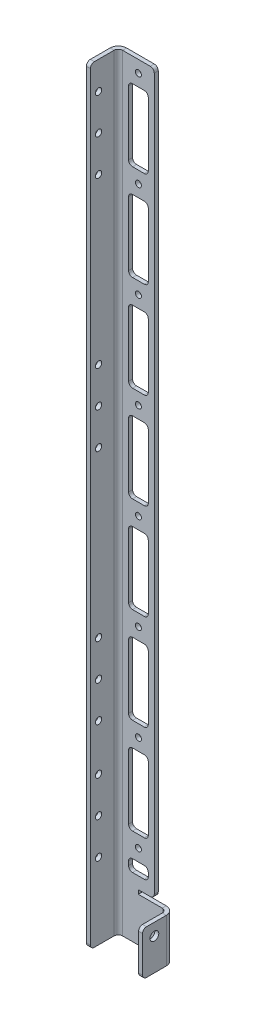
ISO-10303-21;
HEADER;
FILE_DESCRIPTION(('STEP AP214'),'2;1');
FILE_NAME('part.step','',(''),(''),'','','');
FILE_SCHEMA(('AUTOMOTIVE_DESIGN { 1 0 10303 214 1 1 1 1 }'));
ENDSEC;
DATA;
#1=APPLICATION_CONTEXT('core data for automotive mechanical design processes');
#2=APPLICATION_PROTOCOL_DEFINITION('international standard','automotive_design',2000,#1);
#3=PRODUCT_CONTEXT('',#1,'mechanical');
#4=PRODUCT('Part','Part','',(#3));
#5=PRODUCT_RELATED_PRODUCT_CATEGORY('part','',(#4));
#6=PRODUCT_DEFINITION_FORMATION('','',#4);
#7=PRODUCT_DEFINITION_CONTEXT('part definition',#1,'design');
#8=PRODUCT_DEFINITION('design','',#6,#7);
#9=PRODUCT_DEFINITION_SHAPE('','',#8);
#10=(LENGTH_UNIT() NAMED_UNIT(*) SI_UNIT(.MILLI.,.METRE.));
#11=(NAMED_UNIT(*) PLANE_ANGLE_UNIT() SI_UNIT($,.RADIAN.));
#12=(NAMED_UNIT(*) SI_UNIT($,.STERADIAN.) SOLID_ANGLE_UNIT());
#13=UNCERTAINTY_MEASURE_WITH_UNIT(LENGTH_MEASURE(1.E-05),#10,'distance_accuracy_value','');
#14=(GEOMETRIC_REPRESENTATION_CONTEXT(3) GLOBAL_UNCERTAINTY_ASSIGNED_CONTEXT((#13)) GLOBAL_UNIT_ASSIGNED_CONTEXT((#10,
#11,#12)) REPRESENTATION_CONTEXT('',''));
#15=CARTESIAN_POINT('',(0.,0.,0.));
#16=DIRECTION('',(0.,0.,1.));
#17=DIRECTION('',(1.,0.,0.));
#18=AXIS2_PLACEMENT_3D('',#15,#16,#17);
#19=CARTESIAN_POINT('',(38.3032,133.35,0.001000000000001));
#20=DIRECTION('',(0.,0.,-1.));
#21=DIRECTION('',(-1.,0.,0.));
#22=AXIS2_PLACEMENT_3D('',#19,#20,#21);
#23=CYLINDRICAL_SURFACE('',#22,4.76250000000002);
#24=CARTESIAN_POINT('',(38.3032,133.35,-50.8));
#25=DIRECTION('',(0.,0.,-1.));
#26=DIRECTION('',(-1.,0.,0.));
#27=AXIS2_PLACEMENT_3D('',#24,#25,#26);
#28=CIRCLE('',#27,4.76250000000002);
#29=CARTESIAN_POINT('',(33.5407,133.35,-50.8));
#30=VERTEX_POINT('',#29);
#31=EDGE_CURVE('E70',#30,#30,#28,.T.);
#32=ORIENTED_EDGE('',*,*,#31,.T.);
#33=EDGE_LOOP('',(#32));
#34=FACE_BOUND('',#33,.T.);
#35=CARTESIAN_POINT('',(38.3032,133.35,-44.45));
#36=DIRECTION('',(0.,0.,-1.));
#37=DIRECTION('',(-1.,0.,0.));
#38=AXIS2_PLACEMENT_3D('',#35,#36,#37);
#39=CIRCLE('',#38,4.76250000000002);
#40=CARTESIAN_POINT('',(33.5407,133.35,-44.45));
#41=VERTEX_POINT('',#40);
#42=EDGE_CURVE('E13',#41,#41,#39,.F.);
#43=ORIENTED_EDGE('',*,*,#42,.T.);
#44=EDGE_LOOP('',(#43));
#45=FACE_BOUND('',#44,.T.);
#46=ADVANCED_FACE('F63',(#34,#45),#23,.F.);
#47=CARTESIAN_POINT('',(38.3032,285.75,0.001000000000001));
#48=DIRECTION('',(0.,0.,-1.));
#49=DIRECTION('',(-1.,0.,0.));
#50=AXIS2_PLACEMENT_3D('',#47,#48,#49);
#51=CYLINDRICAL_SURFACE('',#50,4.76250000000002);
#52=CARTESIAN_POINT('',(38.3032,285.75,-50.8));
#53=DIRECTION('',(0.,0.,-1.));
#54=DIRECTION('',(-1.,0.,0.));
#55=AXIS2_PLACEMENT_3D('',#52,#53,#54);
#56=CIRCLE('',#55,4.76250000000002);
#57=CARTESIAN_POINT('',(33.5407,285.75,-50.8));
#58=VERTEX_POINT('',#57);
#59=EDGE_CURVE('E1370',#58,#58,#56,.T.);
#60=ORIENTED_EDGE('',*,*,#59,.T.);
#61=EDGE_LOOP('',(#60));
#62=FACE_BOUND('',#61,.T.);
#63=CARTESIAN_POINT('',(38.3032,285.75,-44.45));
#64=DIRECTION('',(0.,0.,-1.));
#65=DIRECTION('',(-1.,0.,0.));
#66=AXIS2_PLACEMENT_3D('',#63,#64,#65);
#67=CIRCLE('',#66,4.76250000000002);
#68=CARTESIAN_POINT('',(33.5407,285.75,-44.45));
#69=VERTEX_POINT('',#68);
#70=EDGE_CURVE('E1373',#69,#69,#67,.F.);
#71=ORIENTED_EDGE('',*,*,#70,.T.);
#72=EDGE_LOOP('',(#71));
#73=FACE_BOUND('',#72,.T.);
#74=ADVANCED_FACE('F1395',(#62,#73),#51,.F.);
#75=CARTESIAN_POINT('',(38.3032,438.15,0.001000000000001));
#76=DIRECTION('',(0.,0.,-1.));
#77=DIRECTION('',(-1.,0.,0.));
#78=AXIS2_PLACEMENT_3D('',#75,#76,#77);
#79=CYLINDRICAL_SURFACE('',#78,4.76250000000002);
#80=CARTESIAN_POINT('',(38.3032,438.15,-50.8));
#81=DIRECTION('',(0.,0.,-1.));
#82=DIRECTION('',(-1.,0.,0.));
#83=AXIS2_PLACEMENT_3D('',#80,#81,#82);
#84=CIRCLE('',#83,4.76250000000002);
#85=CARTESIAN_POINT('',(33.5407,438.15,-50.8));
#86=VERTEX_POINT('',#85);
#87=EDGE_CURVE('E1364',#86,#86,#84,.T.);
#88=ORIENTED_EDGE('',*,*,#87,.T.);
#89=EDGE_LOOP('',(#88));
#90=FACE_BOUND('',#89,.T.);
#91=CARTESIAN_POINT('',(38.3032,438.15,-44.45));
#92=DIRECTION('',(0.,0.,-1.));
#93=DIRECTION('',(-1.,0.,0.));
#94=AXIS2_PLACEMENT_3D('',#91,#92,#93);
#95=CIRCLE('',#94,4.76250000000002);
#96=CARTESIAN_POINT('',(33.5407,438.15,-44.45));
#97=VERTEX_POINT('',#96);
#98=EDGE_CURVE('E1367',#97,#97,#95,.F.);
#99=ORIENTED_EDGE('',*,*,#98,.T.);
#100=EDGE_LOOP('',(#99));
#101=FACE_BOUND('',#100,.T.);
#102=ADVANCED_FACE('F1399',(#90,#101),#79,.F.);
#103=CARTESIAN_POINT('',(38.3032,590.55,0.001000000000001));
#104=DIRECTION('',(0.,0.,-1.));
#105=DIRECTION('',(-1.,0.,0.));
#106=AXIS2_PLACEMENT_3D('',#103,#104,#105);
#107=CYLINDRICAL_SURFACE('',#106,4.76250000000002);
#108=CARTESIAN_POINT('',(38.3032,590.55,-50.8));
#109=DIRECTION('',(0.,0.,-1.));
#110=DIRECTION('',(-1.,0.,0.));
#111=AXIS2_PLACEMENT_3D('',#108,#109,#110);
#112=CIRCLE('',#111,4.76250000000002);
#113=CARTESIAN_POINT('',(33.5407,590.55,-50.8));
#114=VERTEX_POINT('',#113);
#115=EDGE_CURVE('E1358',#114,#114,#112,.T.);
#116=ORIENTED_EDGE('',*,*,#115,.T.);
#117=EDGE_LOOP('',(#116));
#118=FACE_BOUND('',#117,.T.);
#119=CARTESIAN_POINT('',(38.3032,590.55,-44.45));
#120=DIRECTION('',(0.,0.,-1.));
#121=DIRECTION('',(-1.,0.,0.));
#122=AXIS2_PLACEMENT_3D('',#119,#120,#121);
#123=CIRCLE('',#122,4.76250000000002);
#124=CARTESIAN_POINT('',(33.5407,590.55,-44.45));
#125=VERTEX_POINT('',#124);
#126=EDGE_CURVE('E1361',#125,#125,#123,.F.);
#127=ORIENTED_EDGE('',*,*,#126,.T.);
#128=EDGE_LOOP('',(#127));
#129=FACE_BOUND('',#128,.T.);
#130=ADVANCED_FACE('F1404',(#118,#129),#107,.F.);
#131=CARTESIAN_POINT('',(38.3032,742.95,0.001000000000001));
#132=DIRECTION('',(0.,0.,-1.));
#133=DIRECTION('',(-1.,0.,0.));
#134=AXIS2_PLACEMENT_3D('',#131,#132,#133);
#135=CYLINDRICAL_SURFACE('',#134,4.76250000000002);
#136=CARTESIAN_POINT('',(38.3032,742.95,-50.8));
#137=DIRECTION('',(0.,0.,-1.));
#138=DIRECTION('',(-1.,0.,0.));
#139=AXIS2_PLACEMENT_3D('',#136,#137,#138);
#140=CIRCLE('',#139,4.76250000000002);
#141=CARTESIAN_POINT('',(33.5407,742.95,-50.8));
#142=VERTEX_POINT('',#141);
#143=EDGE_CURVE('E1352',#142,#142,#140,.T.);
#144=ORIENTED_EDGE('',*,*,#143,.T.);
#145=EDGE_LOOP('',(#144));
#146=FACE_BOUND('',#145,.T.);
#147=CARTESIAN_POINT('',(38.3032,742.95,-44.45));
#148=DIRECTION('',(0.,0.,-1.));
#149=DIRECTION('',(-1.,0.,0.));
#150=AXIS2_PLACEMENT_3D('',#147,#148,#149);
#151=CIRCLE('',#150,4.76250000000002);
#152=CARTESIAN_POINT('',(33.5407,742.95,-44.45));
#153=VERTEX_POINT('',#152);
#154=EDGE_CURVE('E1355',#153,#153,#151,.F.);
#155=ORIENTED_EDGE('',*,*,#154,.T.);
#156=EDGE_LOOP('',(#155));
#157=FACE_BOUND('',#156,.T.);
#158=ADVANCED_FACE('F1411',(#146,#157),#135,.F.);
#159=CARTESIAN_POINT('',(38.3032,895.35,0.001000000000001));
#160=DIRECTION('',(0.,0.,-1.));
#161=DIRECTION('',(-1.,0.,0.));
#162=AXIS2_PLACEMENT_3D('',#159,#160,#161);
#163=CYLINDRICAL_SURFACE('',#162,4.76250000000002);
#164=CARTESIAN_POINT('',(38.3032,895.35,-50.8));
#165=DIRECTION('',(0.,0.,-1.));
#166=DIRECTION('',(-1.,0.,0.));
#167=AXIS2_PLACEMENT_3D('',#164,#165,#166);
#168=CIRCLE('',#167,4.76250000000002);
#169=CARTESIAN_POINT('',(33.5407,895.35,-50.8));
#170=VERTEX_POINT('',#169);
#171=EDGE_CURVE('E1346',#170,#170,#168,.T.);
#172=ORIENTED_EDGE('',*,*,#171,.T.);
#173=EDGE_LOOP('',(#172));
#174=FACE_BOUND('',#173,.T.);
#175=CARTESIAN_POINT('',(38.3032,895.35,-44.45));
#176=DIRECTION('',(0.,0.,-1.));
#177=DIRECTION('',(-1.,0.,0.));
#178=AXIS2_PLACEMENT_3D('',#175,#176,#177);
#179=CIRCLE('',#178,4.76250000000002);
#180=CARTESIAN_POINT('',(33.5407,895.35,-44.45));
#181=VERTEX_POINT('',#180);
#182=EDGE_CURVE('E1349',#181,#181,#179,.F.);
#183=ORIENTED_EDGE('',*,*,#182,.T.);
#184=EDGE_LOOP('',(#183));
#185=FACE_BOUND('',#184,.T.);
#186=ADVANCED_FACE('F1415',(#174,#185),#163,.F.);
#187=CARTESIAN_POINT('',(22.6314,107.95,0.001000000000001));
#188=DIRECTION('',(-1.,0.,0.));
#189=DIRECTION('',(0.,0.,1.));
#190=AXIS2_PLACEMENT_3D('',#187,#188,#189);
#191=PLANE('',#190);
#192=DIRECTION('',(0.,-1.,0.));
#193=VECTOR('',#192,1.);
#194=CARTESIAN_POINT('',(22.6314,107.95,-44.45));
#195=LINE('',#194,#193);
#196=CARTESIAN_POINT('',(22.6314,107.95,-44.45));
#197=VERTEX_POINT('',#196);
#198=CARTESIAN_POINT('',(22.6314,101.6,-44.45));
#199=VERTEX_POINT('',#198);
#200=EDGE_CURVE('E1278',#197,#199,#195,.T.);
#201=ORIENTED_EDGE('',*,*,#200,.T.);
#202=DIRECTION('',(0.,0.,-1.));
#203=VECTOR('',#202,1.);
#204=CARTESIAN_POINT('',(22.6314,101.6,0.001000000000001));
#205=LINE('',#204,#203);
#206=CARTESIAN_POINT('',(22.6314,101.6,-50.8));
#207=VERTEX_POINT('',#206);
#208=EDGE_CURVE('E1325',#199,#207,#205,.T.);
#209=ORIENTED_EDGE('',*,*,#208,.T.);
#210=DIRECTION('',(0.,1.,0.));
#211=VECTOR('',#210,1.);
#212=CARTESIAN_POINT('',(22.6314,107.95,-50.8));
#213=LINE('',#212,#211);
#214=CARTESIAN_POINT('',(22.6314,107.95,-50.8));
#215=VERTEX_POINT('',#214);
#216=EDGE_CURVE('E1319',#207,#215,#213,.T.);
#217=ORIENTED_EDGE('',*,*,#216,.T.);
#218=DIRECTION('',(0.,0.,-1.));
#219=VECTOR('',#218,1.);
#220=CARTESIAN_POINT('',(22.6314,107.95,0.001000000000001));
#221=LINE('',#220,#219);
#222=EDGE_CURVE('E1343',#197,#215,#221,.T.);
#223=ORIENTED_EDGE('',*,*,#222,.F.);
#224=EDGE_LOOP('',(#201,#209,#217,#223));
#225=FACE_BOUND('',#224,.T.);
#226=ADVANCED_FACE('F1419',(#225),#191,.F.);
#227=CARTESIAN_POINT('',(28.9814,107.95,0.001000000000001));
#228=DIRECTION('',(0.,0.,-1.));
#229=DIRECTION('',(-1.,0.,0.));
#230=AXIS2_PLACEMENT_3D('',#227,#228,#229);
#231=CYLINDRICAL_SURFACE('',#230,6.35000000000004);
#232=CARTESIAN_POINT('',(28.9814,107.95,-44.45));
#233=DIRECTION('',(0.,0.,-1.));
#234=DIRECTION('',(-1.,0.,0.));
#235=AXIS2_PLACEMENT_3D('',#232,#233,#234);
#236=CIRCLE('',#235,6.35000000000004);
#237=CARTESIAN_POINT('',(28.9814,114.3,-44.45));
#238=VERTEX_POINT('',#237);
#239=EDGE_CURVE('E1281',#238,#197,#236,.F.);
#240=ORIENTED_EDGE('',*,*,#239,.T.);
#241=ORIENTED_EDGE('',*,*,#222,.T.);
#242=CARTESIAN_POINT('',(28.9814,107.95,-50.8));
#243=DIRECTION('',(0.,0.,-1.));
#244=DIRECTION('',(1.,0.,0.));
#245=AXIS2_PLACEMENT_3D('',#242,#243,#244);
#246=CIRCLE('',#245,6.35000000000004);
#247=CARTESIAN_POINT('',(28.9814,114.3,-50.8));
#248=VERTEX_POINT('',#247);
#249=EDGE_CURVE('E1316',#215,#248,#246,.T.);
#250=ORIENTED_EDGE('',*,*,#249,.T.);
#251=DIRECTION('',(0.,0.,-1.));
#252=VECTOR('',#251,1.);
#253=CARTESIAN_POINT('',(28.9814,114.3,0.001000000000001));
#254=LINE('',#253,#252);
#255=EDGE_CURVE('E1340',#238,#248,#254,.T.);
#256=ORIENTED_EDGE('',*,*,#255,.F.);
#257=EDGE_LOOP('',(#240,#241,#250,#256));
#258=FACE_BOUND('',#257,.T.);
#259=ADVANCED_FACE('F1423',(#258),#231,.F.);
#260=CARTESIAN_POINT('',(47.625,114.3,0.001000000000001));
#261=DIRECTION('',(0.,1.,0.));
#262=DIRECTION('',(0.,0.,1.));
#263=AXIS2_PLACEMENT_3D('',#260,#261,#262);
#264=PLANE('',#263);
#265=DIRECTION('',(-1.,0.,0.));
#266=VECTOR('',#265,1.);
#267=CARTESIAN_POINT('',(47.625,114.3,-44.45));
#268=LINE('',#267,#266);
#269=CARTESIAN_POINT('',(47.625,114.3,-44.45));
#270=VERTEX_POINT('',#269);
#271=EDGE_CURVE('E1284',#270,#238,#268,.T.);
#272=ORIENTED_EDGE('',*,*,#271,.T.);
#273=ORIENTED_EDGE('',*,*,#255,.T.);
#274=DIRECTION('',(1.,0.,0.));
#275=VECTOR('',#274,1.);
#276=CARTESIAN_POINT('',(47.625,114.3,-50.8));
#277=LINE('',#276,#275);
#278=CARTESIAN_POINT('',(47.625,114.3,-50.8));
#279=VERTEX_POINT('',#278);
#280=EDGE_CURVE('E1313',#248,#279,#277,.T.);
#281=ORIENTED_EDGE('',*,*,#280,.T.);
#282=DIRECTION('',(0.,0.,-1.));
#283=VECTOR('',#282,1.);
#284=CARTESIAN_POINT('',(47.625,114.3,0.001000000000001));
#285=LINE('',#284,#283);
#286=EDGE_CURVE('E1337',#270,#279,#285,.T.);
#287=ORIENTED_EDGE('',*,*,#286,.F.);
#288=EDGE_LOOP('',(#272,#273,#281,#287));
#289=FACE_BOUND('',#288,.T.);
#290=ADVANCED_FACE('F1427',(#289),#264,.F.);
#291=CARTESIAN_POINT('',(47.625,107.95,0.001000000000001));
#292=DIRECTION('',(0.,0.,-1.));
#293=DIRECTION('',(-1.,0.,0.));
#294=AXIS2_PLACEMENT_3D('',#291,#292,#293);
#295=CYLINDRICAL_SURFACE('',#294,6.35000000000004);
#296=CARTESIAN_POINT('',(47.625,107.95,-44.45));
#297=DIRECTION('',(0.,0.,-1.));
#298=DIRECTION('',(-1.,0.,0.));
#299=AXIS2_PLACEMENT_3D('',#296,#297,#298);
#300=CIRCLE('',#299,6.35000000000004);
#301=CARTESIAN_POINT('',(53.975,107.95,-44.45));
#302=VERTEX_POINT('',#301);
#303=EDGE_CURVE('E1287',#302,#270,#300,.F.);
#304=ORIENTED_EDGE('',*,*,#303,.T.);
#305=ORIENTED_EDGE('',*,*,#286,.T.);
#306=CARTESIAN_POINT('',(47.625,107.95,-50.8));
#307=DIRECTION('',(0.,0.,-1.));
#308=DIRECTION('',(-1.,0.,0.));
#309=AXIS2_PLACEMENT_3D('',#306,#307,#308);
#310=CIRCLE('',#309,6.35000000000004);
#311=CARTESIAN_POINT('',(53.975,107.95,-50.8));
#312=VERTEX_POINT('',#311);
#313=EDGE_CURVE('E1310',#279,#312,#310,.T.);
#314=ORIENTED_EDGE('',*,*,#313,.T.);
#315=DIRECTION('',(0.,0.,-1.));
#316=VECTOR('',#315,1.);
#317=CARTESIAN_POINT('',(53.975,107.95,0.001000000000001));
#318=LINE('',#317,#316);
#319=EDGE_CURVE('E1334',#302,#312,#318,.T.);
#320=ORIENTED_EDGE('',*,*,#319,.F.);
#321=EDGE_LOOP('',(#304,#305,#314,#320));
#322=FACE_BOUND('',#321,.T.);
#323=ADVANCED_FACE('F1431',(#322),#295,.F.);
#324=CARTESIAN_POINT('',(53.975,107.95,0.001000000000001));
#325=DIRECTION('',(1.,0.,0.));
#326=DIRECTION('',(0.,0.,-1.));
#327=AXIS2_PLACEMENT_3D('',#324,#325,#326);
#328=PLANE('',#327);
#329=DIRECTION('',(0.,1.,0.));
#330=VECTOR('',#329,1.);
#331=CARTESIAN_POINT('',(53.975,107.95,-44.45));
#332=LINE('',#331,#330);
#333=CARTESIAN_POINT('',(53.975,101.6,-44.45));
#334=VERTEX_POINT('',#333);
#335=EDGE_CURVE('E1290',#334,#302,#332,.T.);
#336=ORIENTED_EDGE('',*,*,#335,.T.);
#337=ORIENTED_EDGE('',*,*,#319,.T.);
#338=DIRECTION('',(0.,-1.,0.));
#339=VECTOR('',#338,1.);
#340=CARTESIAN_POINT('',(53.975,107.95,-50.8));
#341=LINE('',#340,#339);
#342=CARTESIAN_POINT('',(53.975,101.6,-50.8));
#343=VERTEX_POINT('',#342);
#344=EDGE_CURVE('E1307',#312,#343,#341,.T.);
#345=ORIENTED_EDGE('',*,*,#344,.T.);
#346=DIRECTION('',(0.,0.,-1.));
#347=VECTOR('',#346,1.);
#348=CARTESIAN_POINT('',(53.975,101.6,0.001000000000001));
#349=LINE('',#348,#347);
#350=EDGE_CURVE('E1331',#334,#343,#349,.T.);
#351=ORIENTED_EDGE('',*,*,#350,.F.);
#352=EDGE_LOOP('',(#336,#337,#345,#351));
#353=FACE_BOUND('',#352,.T.);
#354=ADVANCED_FACE('F1435',(#353),#328,.F.);
#355=CARTESIAN_POINT('',(47.625,101.6,0.001000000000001));
#356=DIRECTION('',(0.,0.,-1.));
#357=DIRECTION('',(-1.,0.,0.));
#358=AXIS2_PLACEMENT_3D('',#355,#356,#357);
#359=CYLINDRICAL_SURFACE('',#358,6.35000000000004);
#360=CARTESIAN_POINT('',(47.625,101.6,-44.45));
#361=DIRECTION('',(0.,0.,-1.));
#362=DIRECTION('',(-1.,0.,0.));
#363=AXIS2_PLACEMENT_3D('',#360,#361,#362);
#364=CIRCLE('',#363,6.35000000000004);
#365=CARTESIAN_POINT('',(47.625,95.2499999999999,-44.45));
#366=VERTEX_POINT('',#365);
#367=EDGE_CURVE('E1293',#366,#334,#364,.F.);
#368=ORIENTED_EDGE('',*,*,#367,.T.);
#369=ORIENTED_EDGE('',*,*,#350,.T.);
#370=CARTESIAN_POINT('',(47.625,101.6,-50.8));
#371=DIRECTION('',(0.,0.,-1.));
#372=DIRECTION('',(-1.,0.,0.));
#373=AXIS2_PLACEMENT_3D('',#370,#371,#372);
#374=CIRCLE('',#373,6.35000000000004);
#375=CARTESIAN_POINT('',(47.625,95.2499999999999,-50.8));
#376=VERTEX_POINT('',#375);
#377=EDGE_CURVE('E1304',#343,#376,#374,.T.);
#378=ORIENTED_EDGE('',*,*,#377,.T.);
#379=DIRECTION('',(0.,0.,-1.));
#380=VECTOR('',#379,1.);
#381=CARTESIAN_POINT('',(47.625,95.2499999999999,0.001000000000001));
#382=LINE('',#381,#380);
#383=EDGE_CURVE('E1328',#366,#376,#382,.T.);
#384=ORIENTED_EDGE('',*,*,#383,.F.);
#385=EDGE_LOOP('',(#368,#369,#378,#384));
#386=FACE_BOUND('',#385,.T.);
#387=ADVANCED_FACE('F1439',(#386),#359,.F.);
#388=CARTESIAN_POINT('',(47.625,95.2499999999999,0.001000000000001));
#389=DIRECTION('',(0.,-1.,0.));
#390=DIRECTION('',(0.,0.,-1.));
#391=AXIS2_PLACEMENT_3D('',#388,#389,#390);
#392=PLANE('',#391);
#393=DIRECTION('',(1.,0.,0.));
#394=VECTOR('',#393,1.);
#395=CARTESIAN_POINT('',(47.625,95.2499999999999,-44.45));
#396=LINE('',#395,#394);
#397=CARTESIAN_POINT('',(28.9814,95.2499999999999,-44.45));
#398=VERTEX_POINT('',#397);
#399=EDGE_CURVE('E1296',#398,#366,#396,.T.);
#400=ORIENTED_EDGE('',*,*,#399,.T.);
#401=ORIENTED_EDGE('',*,*,#383,.T.);
#402=DIRECTION('',(-1.,0.,0.));
#403=VECTOR('',#402,1.);
#404=CARTESIAN_POINT('',(47.625,95.2499999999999,-50.8));
#405=LINE('',#404,#403);
#406=CARTESIAN_POINT('',(28.9814,95.2499999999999,-50.8));
#407=VERTEX_POINT('',#406);
#408=EDGE_CURVE('E1301',#376,#407,#405,.T.);
#409=ORIENTED_EDGE('',*,*,#408,.T.);
#410=DIRECTION('',(0.,0.,-1.));
#411=VECTOR('',#410,1.);
#412=CARTESIAN_POINT('',(28.9814,95.2499999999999,0.001000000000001));
#413=LINE('',#412,#411);
#414=EDGE_CURVE('E1322',#398,#407,#413,.T.);
#415=ORIENTED_EDGE('',*,*,#414,.F.);
#416=EDGE_LOOP('',(#400,#401,#409,#415));
#417=FACE_BOUND('',#416,.T.);
#418=ADVANCED_FACE('F1443',(#417),#392,.F.);
#419=CARTESIAN_POINT('',(28.9814,101.6,0.001000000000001));
#420=DIRECTION('',(0.,0.,-1.));
#421=DIRECTION('',(-1.,0.,0.));
#422=AXIS2_PLACEMENT_3D('',#419,#420,#421);
#423=CYLINDRICAL_SURFACE('',#422,6.35000000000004);
#424=CARTESIAN_POINT('',(28.9814,101.6,-44.45));
#425=DIRECTION('',(0.,0.,-1.));
#426=DIRECTION('',(-1.,0.,0.));
#427=AXIS2_PLACEMENT_3D('',#424,#425,#426);
#428=CIRCLE('',#427,6.35000000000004);
#429=EDGE_CURVE('E1276',#199,#398,#428,.F.);
#430=ORIENTED_EDGE('',*,*,#429,.T.);
#431=ORIENTED_EDGE('',*,*,#414,.T.);
#432=CARTESIAN_POINT('',(28.9814,101.6,-50.8));
#433=DIRECTION('',(0.,0.,-1.));
#434=DIRECTION('',(-1.,0.,0.));
#435=AXIS2_PLACEMENT_3D('',#432,#433,#434);
#436=CIRCLE('',#435,6.35000000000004);
#437=EDGE_CURVE('E1299',#407,#207,#436,.T.);
#438=ORIENTED_EDGE('',*,*,#437,.T.);
#439=ORIENTED_EDGE('',*,*,#208,.F.);
#440=EDGE_LOOP('',(#430,#431,#438,#439));
#441=FACE_BOUND('',#440,.T.);
#442=ADVANCED_FACE('F1447',(#441),#423,.F.);
#443=CARTESIAN_POINT('',(22.6314,260.35,0.001000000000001));
#444=DIRECTION('',(-1.,0.,0.));
#445=DIRECTION('',(0.,0.,1.));
#446=AXIS2_PLACEMENT_3D('',#443,#444,#445);
#447=PLANE('',#446);
#448=DIRECTION('',(0.,-1.,0.));
#449=VECTOR('',#448,1.);
#450=CARTESIAN_POINT('',(22.6314,260.35,-44.45));
#451=LINE('',#450,#449);
#452=CARTESIAN_POINT('',(22.6314,260.35,-44.45));
#453=VERTEX_POINT('',#452);
#454=CARTESIAN_POINT('',(22.6314,158.75,-44.45));
#455=VERTEX_POINT('',#454);
#456=EDGE_CURVE('E1236',#453,#455,#451,.T.);
#457=ORIENTED_EDGE('',*,*,#456,.T.);
#458=DIRECTION('',(0.,0.,-1.));
#459=VECTOR('',#458,1.);
#460=CARTESIAN_POINT('',(22.6314,158.75,0.001000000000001));
#461=LINE('',#460,#459);
#462=CARTESIAN_POINT('',(22.6314,158.75,-50.8));
#463=VERTEX_POINT('',#462);
#464=EDGE_CURVE('E762',#455,#463,#461,.T.);
#465=ORIENTED_EDGE('',*,*,#464,.T.);
#466=DIRECTION('',(0.,1.,0.));
#467=VECTOR('',#466,1.);
#468=CARTESIAN_POINT('',(22.6314,260.35,-50.8));
#469=LINE('',#468,#467);
#470=CARTESIAN_POINT('',(22.6314,260.35,-50.8));
#471=VERTEX_POINT('',#470);
#472=EDGE_CURVE('E1261',#463,#471,#469,.T.);
#473=ORIENTED_EDGE('',*,*,#472,.T.);
#474=DIRECTION('',(0.,0.,-1.));
#475=VECTOR('',#474,1.);
#476=CARTESIAN_POINT('',(22.6314,260.35,0.001000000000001));
#477=LINE('',#476,#475);
#478=EDGE_CURVE('E1273',#453,#471,#477,.T.);
#479=ORIENTED_EDGE('',*,*,#478,.F.);
#480=EDGE_LOOP('',(#457,#465,#473,#479));
#481=FACE_BOUND('',#480,.T.);
#482=ADVANCED_FACE('F1451',(#481),#447,.F.);
#483=CARTESIAN_POINT('',(28.9814,260.35,0.001000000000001));
#484=DIRECTION('',(0.,0.,-1.));
#485=DIRECTION('',(-1.,0.,0.));
#486=AXIS2_PLACEMENT_3D('',#483,#484,#485);
#487=CYLINDRICAL_SURFACE('',#486,6.35000000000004);
#488=CARTESIAN_POINT('',(28.9814,260.35,-44.45));
#489=DIRECTION('',(0.,0.,-1.));
#490=DIRECTION('',(-1.,0.,0.));
#491=AXIS2_PLACEMENT_3D('',#488,#489,#490);
#492=CIRCLE('',#491,6.35000000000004);
#493=CARTESIAN_POINT('',(28.9814,266.7,-44.45));
#494=VERTEX_POINT('',#493);
#495=EDGE_CURVE('E1238',#494,#453,#492,.F.);
#496=ORIENTED_EDGE('',*,*,#495,.T.);
#497=ORIENTED_EDGE('',*,*,#478,.T.);
#498=CARTESIAN_POINT('',(28.9814,260.35,-50.8));
#499=DIRECTION('',(0.,0.,-1.));
#500=DIRECTION('',(1.,0.,0.));
#501=AXIS2_PLACEMENT_3D('',#498,#499,#500);
#502=CIRCLE('',#501,6.35000000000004);
#503=CARTESIAN_POINT('',(28.9814,266.7,-50.8));
#504=VERTEX_POINT('',#503);
#505=EDGE_CURVE('E1258',#471,#504,#502,.T.);
#506=ORIENTED_EDGE('',*,*,#505,.T.);
#507=DIRECTION('',(0.,0.,-1.));
#508=VECTOR('',#507,1.);
#509=CARTESIAN_POINT('',(28.9814,266.7,0.001000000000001));
#510=LINE('',#509,#508);
#511=EDGE_CURVE('E1270',#494,#504,#510,.T.);
#512=ORIENTED_EDGE('',*,*,#511,.F.);
#513=EDGE_LOOP('',(#496,#497,#506,#512));
#514=FACE_BOUND('',#513,.T.);
#515=ADVANCED_FACE('F1455',(#514),#487,.F.);
#516=CARTESIAN_POINT('',(47.625,266.7,0.001000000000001));
#517=DIRECTION('',(0.,1.,0.));
#518=DIRECTION('',(0.,0.,1.));
#519=AXIS2_PLACEMENT_3D('',#516,#517,#518);
#520=PLANE('',#519);
#521=DIRECTION('',(-1.,0.,0.));
#522=VECTOR('',#521,1.);
#523=CARTESIAN_POINT('',(47.625,266.7,-44.45));
#524=LINE('',#523,#522);
#525=CARTESIAN_POINT('',(47.625,266.7,-44.45));
#526=VERTEX_POINT('',#525);
#527=EDGE_CURVE('E1241',#526,#494,#524,.T.);
#528=ORIENTED_EDGE('',*,*,#527,.T.);
#529=ORIENTED_EDGE('',*,*,#511,.T.);
#530=DIRECTION('',(1.,0.,0.));
#531=VECTOR('',#530,1.);
#532=CARTESIAN_POINT('',(47.625,266.7,-50.8));
#533=LINE('',#532,#531);
#534=CARTESIAN_POINT('',(47.625,266.7,-50.8));
#535=VERTEX_POINT('',#534);
#536=EDGE_CURVE('E1255',#504,#535,#533,.T.);
#537=ORIENTED_EDGE('',*,*,#536,.T.);
#538=DIRECTION('',(0.,0.,-1.));
#539=VECTOR('',#538,1.);
#540=CARTESIAN_POINT('',(47.625,266.7,0.001000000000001));
#541=LINE('',#540,#539);
#542=EDGE_CURVE('E1267',#526,#535,#541,.T.);
#543=ORIENTED_EDGE('',*,*,#542,.F.);
#544=EDGE_LOOP('',(#528,#529,#537,#543));
#545=FACE_BOUND('',#544,.T.);
#546=ADVANCED_FACE('F1459',(#545),#520,.F.);
#547=CARTESIAN_POINT('',(47.625,260.35,0.001000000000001));
#548=DIRECTION('',(0.,0.,-1.));
#549=DIRECTION('',(-1.,0.,0.));
#550=AXIS2_PLACEMENT_3D('',#547,#548,#549);
#551=CYLINDRICAL_SURFACE('',#550,6.35000000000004);
#552=CARTESIAN_POINT('',(47.625,260.35,-44.45));
#553=DIRECTION('',(0.,0.,-1.));
#554=DIRECTION('',(-1.,0.,0.));
#555=AXIS2_PLACEMENT_3D('',#552,#553,#554);
#556=CIRCLE('',#555,6.35000000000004);
#557=CARTESIAN_POINT('',(53.975,260.35,-44.45));
#558=VERTEX_POINT('',#557);
#559=EDGE_CURVE('E1244',#558,#526,#556,.F.);
#560=ORIENTED_EDGE('',*,*,#559,.T.);
#561=ORIENTED_EDGE('',*,*,#542,.T.);
#562=CARTESIAN_POINT('',(47.625,260.35,-50.8));
#563=DIRECTION('',(0.,0.,-1.));
#564=DIRECTION('',(-1.,0.,0.));
#565=AXIS2_PLACEMENT_3D('',#562,#563,#564);
#566=CIRCLE('',#565,6.35000000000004);
#567=CARTESIAN_POINT('',(53.975,260.35,-50.8));
#568=VERTEX_POINT('',#567);
#569=EDGE_CURVE('E1252',#535,#568,#566,.T.);
#570=ORIENTED_EDGE('',*,*,#569,.T.);
#571=DIRECTION('',(0.,0.,-1.));
#572=VECTOR('',#571,1.);
#573=CARTESIAN_POINT('',(53.975,260.35,0.001000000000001));
#574=LINE('',#573,#572);
#575=EDGE_CURVE('E1264',#558,#568,#574,.T.);
#576=ORIENTED_EDGE('',*,*,#575,.F.);
#577=EDGE_LOOP('',(#560,#561,#570,#576));
#578=FACE_BOUND('',#577,.T.);
#579=ADVANCED_FACE('F1463',(#578),#551,.F.);
#580=CARTESIAN_POINT('',(53.975,260.35,0.001000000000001));
#581=DIRECTION('',(1.,0.,0.));
#582=DIRECTION('',(0.,0.,-1.));
#583=AXIS2_PLACEMENT_3D('',#580,#581,#582);
#584=PLANE('',#583);
#585=DIRECTION('',(0.,1.,0.));
#586=VECTOR('',#585,1.);
#587=CARTESIAN_POINT('',(53.975,260.35,-44.45));
#588=LINE('',#587,#586);
#589=CARTESIAN_POINT('',(53.975,158.75,-44.45));
#590=VERTEX_POINT('',#589);
#591=EDGE_CURVE('E1247',#590,#558,#588,.T.);
#592=ORIENTED_EDGE('',*,*,#591,.T.);
#593=ORIENTED_EDGE('',*,*,#575,.T.);
#594=DIRECTION('',(0.,-1.,0.));
#595=VECTOR('',#594,1.);
#596=CARTESIAN_POINT('',(53.975,260.35,-50.8));
#597=LINE('',#596,#595);
#598=CARTESIAN_POINT('',(53.975,158.75,-50.8));
#599=VERTEX_POINT('',#598);
#600=EDGE_CURVE('E1250',#568,#599,#597,.T.);
#601=ORIENTED_EDGE('',*,*,#600,.T.);
#602=DIRECTION('',(0.,0.,-1.));
#603=VECTOR('',#602,1.);
#604=CARTESIAN_POINT('',(53.975,158.75,0.001000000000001));
#605=LINE('',#604,#603);
#606=EDGE_CURVE('E759',#590,#599,#605,.T.);
#607=ORIENTED_EDGE('',*,*,#606,.F.);
#608=EDGE_LOOP('',(#592,#593,#601,#607));
#609=FACE_BOUND('',#608,.T.);
#610=ADVANCED_FACE('F1467',(#609),#584,.F.);
#611=CARTESIAN_POINT('',(22.6314,412.75,0.001000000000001));
#612=DIRECTION('',(-1.,0.,0.));
#613=DIRECTION('',(0.,0.,1.));
#614=AXIS2_PLACEMENT_3D('',#611,#612,#613);
#615=PLANE('',#614);
#616=DIRECTION('',(0.,-1.,0.));
#617=VECTOR('',#616,1.);
#618=CARTESIAN_POINT('',(22.6314,412.75,-44.45));
#619=LINE('',#618,#617);
#620=CARTESIAN_POINT('',(22.6314,412.75,-44.45));
#621=VERTEX_POINT('',#620);
#622=CARTESIAN_POINT('',(22.6314,311.15,-44.45));
#623=VERTEX_POINT('',#622);
#624=EDGE_CURVE('E1196',#621,#623,#619,.T.);
#625=ORIENTED_EDGE('',*,*,#624,.T.);
#626=DIRECTION('',(0.,0.,-1.));
#627=VECTOR('',#626,1.);
#628=CARTESIAN_POINT('',(22.6314,311.15,0.001000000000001));
#629=LINE('',#628,#627);
#630=CARTESIAN_POINT('',(22.6314,311.15,-50.8));
#631=VERTEX_POINT('',#630);
#632=EDGE_CURVE('E734',#623,#631,#629,.T.);
#633=ORIENTED_EDGE('',*,*,#632,.T.);
#634=DIRECTION('',(0.,1.,0.));
#635=VECTOR('',#634,1.);
#636=CARTESIAN_POINT('',(22.6314,412.75,-50.8));
#637=LINE('',#636,#635);
#638=CARTESIAN_POINT('',(22.6314,412.75,-50.8));
#639=VERTEX_POINT('',#638);
#640=EDGE_CURVE('E1221',#631,#639,#637,.T.);
#641=ORIENTED_EDGE('',*,*,#640,.T.);
#642=DIRECTION('',(0.,0.,-1.));
#643=VECTOR('',#642,1.);
#644=CARTESIAN_POINT('',(22.6314,412.75,0.001000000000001));
#645=LINE('',#644,#643);
#646=EDGE_CURVE('E1233',#621,#639,#645,.T.);
#647=ORIENTED_EDGE('',*,*,#646,.F.);
#648=EDGE_LOOP('',(#625,#633,#641,#647));
#649=FACE_BOUND('',#648,.T.);
#650=ADVANCED_FACE('F1471',(#649),#615,.F.);
#651=CARTESIAN_POINT('',(28.9814,412.75,0.001000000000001));
#652=DIRECTION('',(0.,0.,-1.));
#653=DIRECTION('',(-1.,0.,0.));
#654=AXIS2_PLACEMENT_3D('',#651,#652,#653);
#655=CYLINDRICAL_SURFACE('',#654,6.35000000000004);
#656=CARTESIAN_POINT('',(28.9814,412.75,-44.45));
#657=DIRECTION('',(0.,0.,-1.));
#658=DIRECTION('',(-1.,0.,0.));
#659=AXIS2_PLACEMENT_3D('',#656,#657,#658);
#660=CIRCLE('',#659,6.35000000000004);
#661=CARTESIAN_POINT('',(28.9814,419.1,-44.45));
#662=VERTEX_POINT('',#661);
#663=EDGE_CURVE('E1198',#662,#621,#660,.F.);
#664=ORIENTED_EDGE('',*,*,#663,.T.);
#665=ORIENTED_EDGE('',*,*,#646,.T.);
#666=CARTESIAN_POINT('',(28.9814,412.75,-50.8));
#667=DIRECTION('',(0.,0.,-1.));
#668=DIRECTION('',(1.,0.,0.));
#669=AXIS2_PLACEMENT_3D('',#666,#667,#668);
#670=CIRCLE('',#669,6.35000000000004);
#671=CARTESIAN_POINT('',(28.9814,419.1,-50.8));
#672=VERTEX_POINT('',#671);
#673=EDGE_CURVE('E1218',#639,#672,#670,.T.);
#674=ORIENTED_EDGE('',*,*,#673,.T.);
#675=DIRECTION('',(0.,0.,-1.));
#676=VECTOR('',#675,1.);
#677=CARTESIAN_POINT('',(28.9814,419.1,0.001000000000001));
#678=LINE('',#677,#676);
#679=EDGE_CURVE('E1230',#662,#672,#678,.T.);
#680=ORIENTED_EDGE('',*,*,#679,.F.);
#681=EDGE_LOOP('',(#664,#665,#674,#680));
#682=FACE_BOUND('',#681,.T.);
#683=ADVANCED_FACE('F1475',(#682),#655,.F.);
#684=CARTESIAN_POINT('',(47.625,419.1,0.001000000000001));
#685=DIRECTION('',(0.,1.,0.));
#686=DIRECTION('',(0.,0.,1.));
#687=AXIS2_PLACEMENT_3D('',#684,#685,#686);
#688=PLANE('',#687);
#689=DIRECTION('',(-1.,0.,0.));
#690=VECTOR('',#689,1.);
#691=CARTESIAN_POINT('',(47.625,419.1,-44.45));
#692=LINE('',#691,#690);
#693=CARTESIAN_POINT('',(47.625,419.1,-44.45));
#694=VERTEX_POINT('',#693);
#695=EDGE_CURVE('E1201',#694,#662,#692,.T.);
#696=ORIENTED_EDGE('',*,*,#695,.T.);
#697=ORIENTED_EDGE('',*,*,#679,.T.);
#698=DIRECTION('',(1.,0.,0.));
#699=VECTOR('',#698,1.);
#700=CARTESIAN_POINT('',(47.625,419.1,-50.8));
#701=LINE('',#700,#699);
#702=CARTESIAN_POINT('',(47.625,419.1,-50.8));
#703=VERTEX_POINT('',#702);
#704=EDGE_CURVE('E1215',#672,#703,#701,.T.);
#705=ORIENTED_EDGE('',*,*,#704,.T.);
#706=DIRECTION('',(0.,0.,-1.));
#707=VECTOR('',#706,1.);
#708=CARTESIAN_POINT('',(47.625,419.1,0.001000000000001));
#709=LINE('',#708,#707);
#710=EDGE_CURVE('E1227',#694,#703,#709,.T.);
#711=ORIENTED_EDGE('',*,*,#710,.F.);
#712=EDGE_LOOP('',(#696,#697,#705,#711));
#713=FACE_BOUND('',#712,.T.);
#714=ADVANCED_FACE('F1479',(#713),#688,.F.);
#715=CARTESIAN_POINT('',(47.625,412.75,0.001000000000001));
#716=DIRECTION('',(0.,0.,-1.));
#717=DIRECTION('',(-1.,0.,0.));
#718=AXIS2_PLACEMENT_3D('',#715,#716,#717);
#719=CYLINDRICAL_SURFACE('',#718,6.35000000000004);
#720=CARTESIAN_POINT('',(47.625,412.75,-44.45));
#721=DIRECTION('',(0.,0.,-1.));
#722=DIRECTION('',(-1.,0.,0.));
#723=AXIS2_PLACEMENT_3D('',#720,#721,#722);
#724=CIRCLE('',#723,6.35000000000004);
#725=CARTESIAN_POINT('',(53.975,412.75,-44.45));
#726=VERTEX_POINT('',#725);
#727=EDGE_CURVE('E1204',#726,#694,#724,.F.);
#728=ORIENTED_EDGE('',*,*,#727,.T.);
#729=ORIENTED_EDGE('',*,*,#710,.T.);
#730=CARTESIAN_POINT('',(47.625,412.75,-50.8));
#731=DIRECTION('',(0.,0.,-1.));
#732=DIRECTION('',(-1.,0.,0.));
#733=AXIS2_PLACEMENT_3D('',#730,#731,#732);
#734=CIRCLE('',#733,6.35000000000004);
#735=CARTESIAN_POINT('',(53.975,412.75,-50.8));
#736=VERTEX_POINT('',#735);
#737=EDGE_CURVE('E1212',#703,#736,#734,.T.);
#738=ORIENTED_EDGE('',*,*,#737,.T.);
#739=DIRECTION('',(0.,0.,-1.));
#740=VECTOR('',#739,1.);
#741=CARTESIAN_POINT('',(53.975,412.75,0.001000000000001));
#742=LINE('',#741,#740);
#743=EDGE_CURVE('E1224',#726,#736,#742,.T.);
#744=ORIENTED_EDGE('',*,*,#743,.F.);
#745=EDGE_LOOP('',(#728,#729,#738,#744));
#746=FACE_BOUND('',#745,.T.);
#747=ADVANCED_FACE('F1483',(#746),#719,.F.);
#748=CARTESIAN_POINT('',(53.975,412.75,0.001000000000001));
#749=DIRECTION('',(1.,0.,0.));
#750=DIRECTION('',(0.,0.,-1.));
#751=AXIS2_PLACEMENT_3D('',#748,#749,#750);
#752=PLANE('',#751);
#753=DIRECTION('',(0.,1.,0.));
#754=VECTOR('',#753,1.);
#755=CARTESIAN_POINT('',(53.975,412.75,-44.45));
#756=LINE('',#755,#754);
#757=CARTESIAN_POINT('',(53.975,311.15,-44.45));
#758=VERTEX_POINT('',#757);
#759=EDGE_CURVE('E1207',#758,#726,#756,.T.);
#760=ORIENTED_EDGE('',*,*,#759,.T.);
#761=ORIENTED_EDGE('',*,*,#743,.T.);
#762=DIRECTION('',(0.,-1.,0.));
#763=VECTOR('',#762,1.);
#764=CARTESIAN_POINT('',(53.975,412.75,-50.8));
#765=LINE('',#764,#763);
#766=CARTESIAN_POINT('',(53.975,311.15,-50.8));
#767=VERTEX_POINT('',#766);
#768=EDGE_CURVE('E1210',#736,#767,#765,.T.);
#769=ORIENTED_EDGE('',*,*,#768,.T.);
#770=DIRECTION('',(0.,0.,-1.));
#771=VECTOR('',#770,1.);
#772=CARTESIAN_POINT('',(53.975,311.15,0.001000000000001));
#773=LINE('',#772,#771);
#774=EDGE_CURVE('E731',#758,#767,#773,.T.);
#775=ORIENTED_EDGE('',*,*,#774,.F.);
#776=EDGE_LOOP('',(#760,#761,#769,#775));
#777=FACE_BOUND('',#776,.T.);
#778=ADVANCED_FACE('F1487',(#777),#752,.F.);
#779=CARTESIAN_POINT('',(22.6314,565.15,0.001000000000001));
#780=DIRECTION('',(-1.,0.,0.));
#781=DIRECTION('',(0.,0.,1.));
#782=AXIS2_PLACEMENT_3D('',#779,#780,#781);
#783=PLANE('',#782);
#784=DIRECTION('',(0.,-1.,0.));
#785=VECTOR('',#784,1.);
#786=CARTESIAN_POINT('',(22.6314,565.15,-44.45));
#787=LINE('',#786,#785);
#788=CARTESIAN_POINT('',(22.6314,565.15,-44.45));
#789=VERTEX_POINT('',#788);
#790=CARTESIAN_POINT('',(22.6314,463.55,-44.45));
#791=VERTEX_POINT('',#790);
#792=EDGE_CURVE('E1156',#789,#791,#787,.T.);
#793=ORIENTED_EDGE('',*,*,#792,.T.);
#794=DIRECTION('',(0.,0.,-1.));
#795=VECTOR('',#794,1.);
#796=CARTESIAN_POINT('',(22.6314,463.55,0.001000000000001));
#797=LINE('',#796,#795);
#798=CARTESIAN_POINT('',(22.6314,463.55,-50.8));
#799=VERTEX_POINT('',#798);
#800=EDGE_CURVE('E706',#791,#799,#797,.T.);
#801=ORIENTED_EDGE('',*,*,#800,.T.);
#802=DIRECTION('',(0.,1.,0.));
#803=VECTOR('',#802,1.);
#804=CARTESIAN_POINT('',(22.6314,565.15,-50.8));
#805=LINE('',#804,#803);
#806=CARTESIAN_POINT('',(22.6314,565.15,-50.8));
#807=VERTEX_POINT('',#806);
#808=EDGE_CURVE('E1181',#799,#807,#805,.T.);
#809=ORIENTED_EDGE('',*,*,#808,.T.);
#810=DIRECTION('',(0.,0.,-1.));
#811=VECTOR('',#810,1.);
#812=CARTESIAN_POINT('',(22.6314,565.15,0.001000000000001));
#813=LINE('',#812,#811);
#814=EDGE_CURVE('E1193',#789,#807,#813,.T.);
#815=ORIENTED_EDGE('',*,*,#814,.F.);
#816=EDGE_LOOP('',(#793,#801,#809,#815));
#817=FACE_BOUND('',#816,.T.);
#818=ADVANCED_FACE('F1491',(#817),#783,.F.);
#819=CARTESIAN_POINT('',(28.9814,565.15,0.001000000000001));
#820=DIRECTION('',(0.,0.,-1.));
#821=DIRECTION('',(-1.,0.,0.));
#822=AXIS2_PLACEMENT_3D('',#819,#820,#821);
#823=CYLINDRICAL_SURFACE('',#822,6.35000000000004);
#824=CARTESIAN_POINT('',(28.9814,565.15,-44.45));
#825=DIRECTION('',(0.,0.,-1.));
#826=DIRECTION('',(-1.,0.,0.));
#827=AXIS2_PLACEMENT_3D('',#824,#825,#826);
#828=CIRCLE('',#827,6.35000000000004);
#829=CARTESIAN_POINT('',(28.9814,571.5,-44.45));
#830=VERTEX_POINT('',#829);
#831=EDGE_CURVE('E1158',#830,#789,#828,.F.);
#832=ORIENTED_EDGE('',*,*,#831,.T.);
#833=ORIENTED_EDGE('',*,*,#814,.T.);
#834=CARTESIAN_POINT('',(28.9814,565.15,-50.8));
#835=DIRECTION('',(0.,0.,-1.));
#836=DIRECTION('',(1.,0.,0.));
#837=AXIS2_PLACEMENT_3D('',#834,#835,#836);
#838=CIRCLE('',#837,6.35000000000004);
#839=CARTESIAN_POINT('',(28.9814,571.5,-50.8));
#840=VERTEX_POINT('',#839);
#841=EDGE_CURVE('E1178',#807,#840,#838,.T.);
#842=ORIENTED_EDGE('',*,*,#841,.T.);
#843=DIRECTION('',(0.,0.,-1.));
#844=VECTOR('',#843,1.);
#845=CARTESIAN_POINT('',(28.9814,571.5,0.001000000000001));
#846=LINE('',#845,#844);
#847=EDGE_CURVE('E1190',#830,#840,#846,.T.);
#848=ORIENTED_EDGE('',*,*,#847,.F.);
#849=EDGE_LOOP('',(#832,#833,#842,#848));
#850=FACE_BOUND('',#849,.T.);
#851=ADVANCED_FACE('F1495',(#850),#823,.F.);
#852=CARTESIAN_POINT('',(47.625,571.5,0.001000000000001));
#853=DIRECTION('',(0.,1.,0.));
#854=DIRECTION('',(0.,0.,1.));
#855=AXIS2_PLACEMENT_3D('',#852,#853,#854);
#856=PLANE('',#855);
#857=DIRECTION('',(-1.,0.,0.));
#858=VECTOR('',#857,1.);
#859=CARTESIAN_POINT('',(47.625,571.5,-44.45));
#860=LINE('',#859,#858);
#861=CARTESIAN_POINT('',(47.625,571.5,-44.45));
#862=VERTEX_POINT('',#861);
#863=EDGE_CURVE('E1161',#862,#830,#860,.T.);
#864=ORIENTED_EDGE('',*,*,#863,.T.);
#865=ORIENTED_EDGE('',*,*,#847,.T.);
#866=DIRECTION('',(1.,0.,0.));
#867=VECTOR('',#866,1.);
#868=CARTESIAN_POINT('',(47.625,571.5,-50.8));
#869=LINE('',#868,#867);
#870=CARTESIAN_POINT('',(47.625,571.5,-50.8));
#871=VERTEX_POINT('',#870);
#872=EDGE_CURVE('E1175',#840,#871,#869,.T.);
#873=ORIENTED_EDGE('',*,*,#872,.T.);
#874=DIRECTION('',(0.,0.,-1.));
#875=VECTOR('',#874,1.);
#876=CARTESIAN_POINT('',(47.625,571.5,0.001000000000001));
#877=LINE('',#876,#875);
#878=EDGE_CURVE('E1187',#862,#871,#877,.T.);
#879=ORIENTED_EDGE('',*,*,#878,.F.);
#880=EDGE_LOOP('',(#864,#865,#873,#879));
#881=FACE_BOUND('',#880,.T.);
#882=ADVANCED_FACE('F1499',(#881),#856,.F.);
#883=CARTESIAN_POINT('',(47.625,565.15,0.001000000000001));
#884=DIRECTION('',(0.,0.,-1.));
#885=DIRECTION('',(-1.,0.,0.));
#886=AXIS2_PLACEMENT_3D('',#883,#884,#885);
#887=CYLINDRICAL_SURFACE('',#886,6.35000000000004);
#888=CARTESIAN_POINT('',(47.625,565.15,-44.45));
#889=DIRECTION('',(0.,0.,-1.));
#890=DIRECTION('',(-1.,0.,0.));
#891=AXIS2_PLACEMENT_3D('',#888,#889,#890);
#892=CIRCLE('',#891,6.35000000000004);
#893=CARTESIAN_POINT('',(53.975,565.15,-44.45));
#894=VERTEX_POINT('',#893);
#895=EDGE_CURVE('E1164',#894,#862,#892,.F.);
#896=ORIENTED_EDGE('',*,*,#895,.T.);
#897=ORIENTED_EDGE('',*,*,#878,.T.);
#898=CARTESIAN_POINT('',(47.625,565.15,-50.8));
#899=DIRECTION('',(0.,0.,-1.));
#900=DIRECTION('',(-1.,0.,0.));
#901=AXIS2_PLACEMENT_3D('',#898,#899,#900);
#902=CIRCLE('',#901,6.35000000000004);
#903=CARTESIAN_POINT('',(53.975,565.15,-50.8));
#904=VERTEX_POINT('',#903);
#905=EDGE_CURVE('E1172',#871,#904,#902,.T.);
#906=ORIENTED_EDGE('',*,*,#905,.T.);
#907=DIRECTION('',(0.,0.,-1.));
#908=VECTOR('',#907,1.);
#909=CARTESIAN_POINT('',(53.975,565.15,0.001000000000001));
#910=LINE('',#909,#908);
#911=EDGE_CURVE('E1184',#894,#904,#910,.T.);
#912=ORIENTED_EDGE('',*,*,#911,.F.);
#913=EDGE_LOOP('',(#896,#897,#906,#912));
#914=FACE_BOUND('',#913,.T.);
#915=ADVANCED_FACE('F1503',(#914),#887,.F.);
#916=CARTESIAN_POINT('',(53.975,565.15,0.001000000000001));
#917=DIRECTION('',(1.,0.,0.));
#918=DIRECTION('',(0.,0.,-1.));
#919=AXIS2_PLACEMENT_3D('',#916,#917,#918);
#920=PLANE('',#919);
#921=DIRECTION('',(0.,1.,0.));
#922=VECTOR('',#921,1.);
#923=CARTESIAN_POINT('',(53.975,565.15,-44.45));
#924=LINE('',#923,#922);
#925=CARTESIAN_POINT('',(53.975,463.55,-44.45));
#926=VERTEX_POINT('',#925);
#927=EDGE_CURVE('E1167',#926,#894,#924,.T.);
#928=ORIENTED_EDGE('',*,*,#927,.T.);
#929=ORIENTED_EDGE('',*,*,#911,.T.);
#930=DIRECTION('',(0.,-1.,0.));
#931=VECTOR('',#930,1.);
#932=CARTESIAN_POINT('',(53.975,565.15,-50.8));
#933=LINE('',#932,#931);
#934=CARTESIAN_POINT('',(53.975,463.55,-50.8));
#935=VERTEX_POINT('',#934);
#936=EDGE_CURVE('E1170',#904,#935,#933,.T.);
#937=ORIENTED_EDGE('',*,*,#936,.T.);
#938=DIRECTION('',(0.,0.,-1.));
#939=VECTOR('',#938,1.);
#940=CARTESIAN_POINT('',(53.975,463.55,0.001000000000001));
#941=LINE('',#940,#939);
#942=EDGE_CURVE('E703',#926,#935,#941,.T.);
#943=ORIENTED_EDGE('',*,*,#942,.F.);
#944=EDGE_LOOP('',(#928,#929,#937,#943));
#945=FACE_BOUND('',#944,.T.);
#946=ADVANCED_FACE('F1507',(#945),#920,.F.);
#947=CARTESIAN_POINT('',(22.6314,717.55,0.001000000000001));
#948=DIRECTION('',(-1.,0.,0.));
#949=DIRECTION('',(0.,0.,1.));
#950=AXIS2_PLACEMENT_3D('',#947,#948,#949);
#951=PLANE('',#950);
#952=DIRECTION('',(0.,-1.,0.));
#953=VECTOR('',#952,1.);
#954=CARTESIAN_POINT('',(22.6314,717.55,-44.45));
#955=LINE('',#954,#953);
#956=CARTESIAN_POINT('',(22.6314,717.55,-44.45));
#957=VERTEX_POINT('',#956);
#958=CARTESIAN_POINT('',(22.6314,615.95,-44.45));
#959=VERTEX_POINT('',#958);
#960=EDGE_CURVE('E1116',#957,#959,#955,.T.);
#961=ORIENTED_EDGE('',*,*,#960,.T.);
#962=DIRECTION('',(0.,0.,-1.));
#963=VECTOR('',#962,1.);
#964=CARTESIAN_POINT('',(22.6314,615.95,0.001000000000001));
#965=LINE('',#964,#963);
#966=CARTESIAN_POINT('',(22.6314,615.95,-50.8));
#967=VERTEX_POINT('',#966);
#968=EDGE_CURVE('E679',#959,#967,#965,.T.);
#969=ORIENTED_EDGE('',*,*,#968,.T.);
#970=DIRECTION('',(0.,1.,0.));
#971=VECTOR('',#970,1.);
#972=CARTESIAN_POINT('',(22.6314,717.55,-50.8));
#973=LINE('',#972,#971);
#974=CARTESIAN_POINT('',(22.6314,717.55,-50.8));
#975=VERTEX_POINT('',#974);
#976=EDGE_CURVE('E1141',#967,#975,#973,.T.);
#977=ORIENTED_EDGE('',*,*,#976,.T.);
#978=DIRECTION('',(0.,0.,-1.));
#979=VECTOR('',#978,1.);
#980=CARTESIAN_POINT('',(22.6314,717.55,0.001000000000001));
#981=LINE('',#980,#979);
#982=EDGE_CURVE('E1153',#957,#975,#981,.T.);
#983=ORIENTED_EDGE('',*,*,#982,.F.);
#984=EDGE_LOOP('',(#961,#969,#977,#983));
#985=FACE_BOUND('',#984,.T.);
#986=ADVANCED_FACE('F1511',(#985),#951,.F.);
#987=CARTESIAN_POINT('',(28.9814,717.55,0.001000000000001));
#988=DIRECTION('',(0.,0.,-1.));
#989=DIRECTION('',(-1.,0.,0.));
#990=AXIS2_PLACEMENT_3D('',#987,#988,#989);
#991=CYLINDRICAL_SURFACE('',#990,6.35000000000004);
#992=CARTESIAN_POINT('',(28.9814,717.55,-44.45));
#993=DIRECTION('',(0.,0.,-1.));
#994=DIRECTION('',(-1.,0.,0.));
#995=AXIS2_PLACEMENT_3D('',#992,#993,#994);
#996=CIRCLE('',#995,6.35000000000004);
#997=CARTESIAN_POINT('',(28.9814,723.9,-44.45));
#998=VERTEX_POINT('',#997);
#999=EDGE_CURVE('E1118',#998,#957,#996,.F.);
#1000=ORIENTED_EDGE('',*,*,#999,.T.);
#1001=ORIENTED_EDGE('',*,*,#982,.T.);
#1002=CARTESIAN_POINT('',(28.9814,717.55,-50.8));
#1003=DIRECTION('',(0.,0.,-1.));
#1004=DIRECTION('',(1.,0.,0.));
#1005=AXIS2_PLACEMENT_3D('',#1002,#1003,#1004);
#1006=CIRCLE('',#1005,6.35000000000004);
#1007=CARTESIAN_POINT('',(28.9814,723.9,-50.8));
#1008=VERTEX_POINT('',#1007);
#1009=EDGE_CURVE('E1138',#975,#1008,#1006,.T.);
#1010=ORIENTED_EDGE('',*,*,#1009,.T.);
#1011=DIRECTION('',(0.,0.,-1.));
#1012=VECTOR('',#1011,1.);
#1013=CARTESIAN_POINT('',(28.9814,723.9,0.001000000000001));
#1014=LINE('',#1013,#1012);
#1015=EDGE_CURVE('E1150',#998,#1008,#1014,.T.);
#1016=ORIENTED_EDGE('',*,*,#1015,.F.);
#1017=EDGE_LOOP('',(#1000,#1001,#1010,#1016));
#1018=FACE_BOUND('',#1017,.T.);
#1019=ADVANCED_FACE('F1515',(#1018),#991,.F.);
#1020=CARTESIAN_POINT('',(47.625,723.9,0.001000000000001));
#1021=DIRECTION('',(0.,1.,0.));
#1022=DIRECTION('',(0.,0.,1.));
#1023=AXIS2_PLACEMENT_3D('',#1020,#1021,#1022);
#1024=PLANE('',#1023);
#1025=DIRECTION('',(-1.,0.,0.));
#1026=VECTOR('',#1025,1.);
#1027=CARTESIAN_POINT('',(47.625,723.9,-44.45));
#1028=LINE('',#1027,#1026);
#1029=CARTESIAN_POINT('',(47.625,723.9,-44.45));
#1030=VERTEX_POINT('',#1029);
#1031=EDGE_CURVE('E1121',#1030,#998,#1028,.T.);
#1032=ORIENTED_EDGE('',*,*,#1031,.T.);
#1033=ORIENTED_EDGE('',*,*,#1015,.T.);
#1034=DIRECTION('',(1.,0.,0.));
#1035=VECTOR('',#1034,1.);
#1036=CARTESIAN_POINT('',(47.625,723.9,-50.8));
#1037=LINE('',#1036,#1035);
#1038=CARTESIAN_POINT('',(47.625,723.9,-50.8));
#1039=VERTEX_POINT('',#1038);
#1040=EDGE_CURVE('E1135',#1008,#1039,#1037,.T.);
#1041=ORIENTED_EDGE('',*,*,#1040,.T.);
#1042=DIRECTION('',(0.,0.,-1.));
#1043=VECTOR('',#1042,1.);
#1044=CARTESIAN_POINT('',(47.625,723.9,0.001000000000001));
#1045=LINE('',#1044,#1043);
#1046=EDGE_CURVE('E1147',#1030,#1039,#1045,.T.);
#1047=ORIENTED_EDGE('',*,*,#1046,.F.);
#1048=EDGE_LOOP('',(#1032,#1033,#1041,#1047));
#1049=FACE_BOUND('',#1048,.T.);
#1050=ADVANCED_FACE('F1519',(#1049),#1024,.F.);
#1051=CARTESIAN_POINT('',(47.625,717.55,0.001000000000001));
#1052=DIRECTION('',(0.,0.,-1.));
#1053=DIRECTION('',(-1.,0.,0.));
#1054=AXIS2_PLACEMENT_3D('',#1051,#1052,#1053);
#1055=CYLINDRICAL_SURFACE('',#1054,6.35000000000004);
#1056=CARTESIAN_POINT('',(47.625,717.55,-44.45));
#1057=DIRECTION('',(0.,0.,-1.));
#1058=DIRECTION('',(-1.,0.,0.));
#1059=AXIS2_PLACEMENT_3D('',#1056,#1057,#1058);
#1060=CIRCLE('',#1059,6.35000000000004);
#1061=CARTESIAN_POINT('',(53.975,717.55,-44.45));
#1062=VERTEX_POINT('',#1061);
#1063=EDGE_CURVE('E1124',#1062,#1030,#1060,.F.);
#1064=ORIENTED_EDGE('',*,*,#1063,.T.);
#1065=ORIENTED_EDGE('',*,*,#1046,.T.);
#1066=CARTESIAN_POINT('',(47.625,717.55,-50.8));
#1067=DIRECTION('',(0.,0.,-1.));
#1068=DIRECTION('',(-1.,0.,0.));
#1069=AXIS2_PLACEMENT_3D('',#1066,#1067,#1068);
#1070=CIRCLE('',#1069,6.35000000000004);
#1071=CARTESIAN_POINT('',(53.975,717.55,-50.8));
#1072=VERTEX_POINT('',#1071);
#1073=EDGE_CURVE('E1132',#1039,#1072,#1070,.T.);
#1074=ORIENTED_EDGE('',*,*,#1073,.T.);
#1075=DIRECTION('',(0.,0.,-1.));
#1076=VECTOR('',#1075,1.);
#1077=CARTESIAN_POINT('',(53.975,717.55,0.001000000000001));
#1078=LINE('',#1077,#1076);
#1079=EDGE_CURVE('E1144',#1062,#1072,#1078,.T.);
#1080=ORIENTED_EDGE('',*,*,#1079,.F.);
#1081=EDGE_LOOP('',(#1064,#1065,#1074,#1080));
#1082=FACE_BOUND('',#1081,.T.);
#1083=ADVANCED_FACE('F1523',(#1082),#1055,.F.);
#1084=CARTESIAN_POINT('',(53.975,717.55,0.001000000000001));
#1085=DIRECTION('',(1.,0.,0.));
#1086=DIRECTION('',(0.,0.,-1.));
#1087=AXIS2_PLACEMENT_3D('',#1084,#1085,#1086);
#1088=PLANE('',#1087);
#1089=DIRECTION('',(0.,1.,0.));
#1090=VECTOR('',#1089,1.);
#1091=CARTESIAN_POINT('',(53.975,717.55,-44.45));
#1092=LINE('',#1091,#1090);
#1093=CARTESIAN_POINT('',(53.975,615.95,-44.45));
#1094=VERTEX_POINT('',#1093);
#1095=EDGE_CURVE('E1127',#1094,#1062,#1092,.T.);
#1096=ORIENTED_EDGE('',*,*,#1095,.T.);
#1097=ORIENTED_EDGE('',*,*,#1079,.T.);
#1098=DIRECTION('',(0.,-1.,0.));
#1099=VECTOR('',#1098,1.);
#1100=CARTESIAN_POINT('',(53.975,717.55,-50.8));
#1101=LINE('',#1100,#1099);
#1102=CARTESIAN_POINT('',(53.975,615.95,-50.8));
#1103=VERTEX_POINT('',#1102);
#1104=EDGE_CURVE('E1130',#1072,#1103,#1101,.T.);
#1105=ORIENTED_EDGE('',*,*,#1104,.T.);
#1106=DIRECTION('',(0.,0.,-1.));
#1107=VECTOR('',#1106,1.);
#1108=CARTESIAN_POINT('',(53.975,615.95,0.001000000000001));
#1109=LINE('',#1108,#1107);
#1110=EDGE_CURVE('E677',#1094,#1103,#1109,.T.);
#1111=ORIENTED_EDGE('',*,*,#1110,.F.);
#1112=EDGE_LOOP('',(#1096,#1097,#1105,#1111));
#1113=FACE_BOUND('',#1112,.T.);
#1114=ADVANCED_FACE('F1527',(#1113),#1088,.F.);
#1115=CARTESIAN_POINT('',(22.6314,869.95,0.001000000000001));
#1116=DIRECTION('',(-1.,0.,0.));
#1117=DIRECTION('',(0.,0.,1.));
#1118=AXIS2_PLACEMENT_3D('',#1115,#1116,#1117);
#1119=PLANE('',#1118);
#1120=DIRECTION('',(0.,-1.,0.));
#1121=VECTOR('',#1120,1.);
#1122=CARTESIAN_POINT('',(22.6314,869.95,-44.45));
#1123=LINE('',#1122,#1121);
#1124=CARTESIAN_POINT('',(22.6314,869.95,-44.45));
#1125=VERTEX_POINT('',#1124);
#1126=CARTESIAN_POINT('',(22.6314,768.35,-44.45));
#1127=VERTEX_POINT('',#1126);
#1128=EDGE_CURVE('E1076',#1125,#1127,#1123,.T.);
#1129=ORIENTED_EDGE('',*,*,#1128,.T.);
#1130=DIRECTION('',(0.,0.,-1.));
#1131=VECTOR('',#1130,1.);
#1132=CARTESIAN_POINT('',(22.6314,768.35,0.001000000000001));
#1133=LINE('',#1132,#1131);
#1134=CARTESIAN_POINT('',(22.6314,768.35,-50.8));
#1135=VERTEX_POINT('',#1134);
#1136=EDGE_CURVE('E653',#1127,#1135,#1133,.T.);
#1137=ORIENTED_EDGE('',*,*,#1136,.T.);
#1138=DIRECTION('',(0.,1.,0.));
#1139=VECTOR('',#1138,1.);
#1140=CARTESIAN_POINT('',(22.6314,869.95,-50.8));
#1141=LINE('',#1140,#1139);
#1142=CARTESIAN_POINT('',(22.6314,869.95,-50.8));
#1143=VERTEX_POINT('',#1142);
#1144=EDGE_CURVE('E1101',#1135,#1143,#1141,.T.);
#1145=ORIENTED_EDGE('',*,*,#1144,.T.);
#1146=DIRECTION('',(0.,0.,-1.));
#1147=VECTOR('',#1146,1.);
#1148=CARTESIAN_POINT('',(22.6314,869.95,0.001000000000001));
#1149=LINE('',#1148,#1147);
#1150=EDGE_CURVE('E1113',#1125,#1143,#1149,.T.);
#1151=ORIENTED_EDGE('',*,*,#1150,.F.);
#1152=EDGE_LOOP('',(#1129,#1137,#1145,#1151));
#1153=FACE_BOUND('',#1152,.T.);
#1154=ADVANCED_FACE('F1531',(#1153),#1119,.F.);
#1155=CARTESIAN_POINT('',(28.9814,869.95,0.001000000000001));
#1156=DIRECTION('',(0.,0.,-1.));
#1157=DIRECTION('',(-1.,0.,0.));
#1158=AXIS2_PLACEMENT_3D('',#1155,#1156,#1157);
#1159=CYLINDRICAL_SURFACE('',#1158,6.35000000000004);
#1160=CARTESIAN_POINT('',(28.9814,869.95,-44.45));
#1161=DIRECTION('',(0.,0.,-1.));
#1162=DIRECTION('',(-1.,0.,0.));
#1163=AXIS2_PLACEMENT_3D('',#1160,#1161,#1162);
#1164=CIRCLE('',#1163,6.35000000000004);
#1165=CARTESIAN_POINT('',(28.9814,876.3,-44.45));
#1166=VERTEX_POINT('',#1165);
#1167=EDGE_CURVE('E1078',#1166,#1125,#1164,.F.);
#1168=ORIENTED_EDGE('',*,*,#1167,.T.);
#1169=ORIENTED_EDGE('',*,*,#1150,.T.);
#1170=CARTESIAN_POINT('',(28.9814,869.95,-50.8));
#1171=DIRECTION('',(0.,0.,-1.));
#1172=DIRECTION('',(1.,0.,0.));
#1173=AXIS2_PLACEMENT_3D('',#1170,#1171,#1172);
#1174=CIRCLE('',#1173,6.35000000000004);
#1175=CARTESIAN_POINT('',(28.9814,876.3,-50.8));
#1176=VERTEX_POINT('',#1175);
#1177=EDGE_CURVE('E1098',#1143,#1176,#1174,.T.);
#1178=ORIENTED_EDGE('',*,*,#1177,.T.);
#1179=DIRECTION('',(0.,0.,-1.));
#1180=VECTOR('',#1179,1.);
#1181=CARTESIAN_POINT('',(28.9814,876.3,0.001000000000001));
#1182=LINE('',#1181,#1180);
#1183=EDGE_CURVE('E1110',#1166,#1176,#1182,.T.);
#1184=ORIENTED_EDGE('',*,*,#1183,.F.);
#1185=EDGE_LOOP('',(#1168,#1169,#1178,#1184));
#1186=FACE_BOUND('',#1185,.T.);
#1187=ADVANCED_FACE('F1535',(#1186),#1159,.F.);
#1188=CARTESIAN_POINT('',(47.625,876.3,0.001000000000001));
#1189=DIRECTION('',(0.,1.,0.));
#1190=DIRECTION('',(0.,0.,1.));
#1191=AXIS2_PLACEMENT_3D('',#1188,#1189,#1190);
#1192=PLANE('',#1191);
#1193=DIRECTION('',(-1.,0.,0.));
#1194=VECTOR('',#1193,1.);
#1195=CARTESIAN_POINT('',(47.625,876.3,-44.45));
#1196=LINE('',#1195,#1194);
#1197=CARTESIAN_POINT('',(47.625,876.3,-44.45));
#1198=VERTEX_POINT('',#1197);
#1199=EDGE_CURVE('E1081',#1198,#1166,#1196,.T.);
#1200=ORIENTED_EDGE('',*,*,#1199,.T.);
#1201=ORIENTED_EDGE('',*,*,#1183,.T.);
#1202=DIRECTION('',(1.,0.,0.));
#1203=VECTOR('',#1202,1.);
#1204=CARTESIAN_POINT('',(47.625,876.3,-50.8));
#1205=LINE('',#1204,#1203);
#1206=CARTESIAN_POINT('',(47.625,876.3,-50.8));
#1207=VERTEX_POINT('',#1206);
#1208=EDGE_CURVE('E1095',#1176,#1207,#1205,.T.);
#1209=ORIENTED_EDGE('',*,*,#1208,.T.);
#1210=DIRECTION('',(0.,0.,-1.));
#1211=VECTOR('',#1210,1.);
#1212=CARTESIAN_POINT('',(47.625,876.3,0.001000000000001));
#1213=LINE('',#1212,#1211);
#1214=EDGE_CURVE('E1107',#1198,#1207,#1213,.T.);
#1215=ORIENTED_EDGE('',*,*,#1214,.F.);
#1216=EDGE_LOOP('',(#1200,#1201,#1209,#1215));
#1217=FACE_BOUND('',#1216,.T.);
#1218=ADVANCED_FACE('F1539',(#1217),#1192,.F.);
#1219=CARTESIAN_POINT('',(47.625,869.95,0.001000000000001));
#1220=DIRECTION('',(0.,0.,-1.));
#1221=DIRECTION('',(-1.,0.,0.));
#1222=AXIS2_PLACEMENT_3D('',#1219,#1220,#1221);
#1223=CYLINDRICAL_SURFACE('',#1222,6.35000000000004);
#1224=CARTESIAN_POINT('',(47.625,869.95,-44.45));
#1225=DIRECTION('',(0.,0.,-1.));
#1226=DIRECTION('',(-1.,0.,0.));
#1227=AXIS2_PLACEMENT_3D('',#1224,#1225,#1226);
#1228=CIRCLE('',#1227,6.35000000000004);
#1229=CARTESIAN_POINT('',(53.975,869.95,-44.45));
#1230=VERTEX_POINT('',#1229);
#1231=EDGE_CURVE('E1084',#1230,#1198,#1228,.F.);
#1232=ORIENTED_EDGE('',*,*,#1231,.T.);
#1233=ORIENTED_EDGE('',*,*,#1214,.T.);
#1234=CARTESIAN_POINT('',(47.625,869.95,-50.8));
#1235=DIRECTION('',(0.,0.,-1.));
#1236=DIRECTION('',(-1.,0.,0.));
#1237=AXIS2_PLACEMENT_3D('',#1234,#1235,#1236);
#1238=CIRCLE('',#1237,6.35000000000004);
#1239=CARTESIAN_POINT('',(53.975,869.95,-50.8));
#1240=VERTEX_POINT('',#1239);
#1241=EDGE_CURVE('E1092',#1207,#1240,#1238,.T.);
#1242=ORIENTED_EDGE('',*,*,#1241,.T.);
#1243=DIRECTION('',(0.,0.,-1.));
#1244=VECTOR('',#1243,1.);
#1245=CARTESIAN_POINT('',(53.975,869.95,0.001000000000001));
#1246=LINE('',#1245,#1244);
#1247=EDGE_CURVE('E1104',#1230,#1240,#1246,.T.);
#1248=ORIENTED_EDGE('',*,*,#1247,.F.);
#1249=EDGE_LOOP('',(#1232,#1233,#1242,#1248));
#1250=FACE_BOUND('',#1249,.T.);
#1251=ADVANCED_FACE('F1543',(#1250),#1223,.F.);
#1252=CARTESIAN_POINT('',(53.975,869.95,0.001000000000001));
#1253=DIRECTION('',(1.,0.,0.));
#1254=DIRECTION('',(0.,0.,-1.));
#1255=AXIS2_PLACEMENT_3D('',#1252,#1253,#1254);
#1256=PLANE('',#1255);
#1257=DIRECTION('',(0.,1.,0.));
#1258=VECTOR('',#1257,1.);
#1259=CARTESIAN_POINT('',(53.975,869.95,-44.45));
#1260=LINE('',#1259,#1258);
#1261=CARTESIAN_POINT('',(53.975,768.35,-44.45));
#1262=VERTEX_POINT('',#1261);
#1263=EDGE_CURVE('E1087',#1262,#1230,#1260,.T.);
#1264=ORIENTED_EDGE('',*,*,#1263,.T.);
#1265=ORIENTED_EDGE('',*,*,#1247,.T.);
#1266=DIRECTION('',(0.,-1.,0.));
#1267=VECTOR('',#1266,1.);
#1268=CARTESIAN_POINT('',(53.975,869.95,-50.8));
#1269=LINE('',#1268,#1267);
#1270=CARTESIAN_POINT('',(53.975,768.35,-50.8));
#1271=VERTEX_POINT('',#1270);
#1272=EDGE_CURVE('E1090',#1240,#1271,#1269,.T.);
#1273=ORIENTED_EDGE('',*,*,#1272,.T.);
#1274=DIRECTION('',(0.,0.,-1.));
#1275=VECTOR('',#1274,1.);
#1276=CARTESIAN_POINT('',(53.975,768.35,0.001000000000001));
#1277=LINE('',#1276,#1275);
#1278=EDGE_CURVE('E650',#1262,#1271,#1277,.T.);
#1279=ORIENTED_EDGE('',*,*,#1278,.F.);
#1280=EDGE_LOOP('',(#1264,#1265,#1273,#1279));
#1281=FACE_BOUND('',#1280,.T.);
#1282=ADVANCED_FACE('F1547',(#1281),#1256,.F.);
#1283=CARTESIAN_POINT('',(13.1064,1219.2,-50.8));
#1284=DIRECTION('',(0.,1.,0.));
#1285=DIRECTION('',(0.,0.,1.));
#1286=AXIS2_PLACEMENT_3D('',#1283,#1284,#1285);
#1287=PLANE('',#1286);
#1288=DIRECTION('',(0.,0.,1.));
#1289=VECTOR('',#1288,1.);
#1290=CARTESIAN_POINT('',(13.1064,1219.2,-50.8));
#1291=LINE('',#1290,#1289);
#1292=CARTESIAN_POINT('',(13.1064,1219.2,-50.8));
#1293=VERTEX_POINT('',#1292);
#1294=CARTESIAN_POINT('',(13.1064,1219.2,-44.45));
#1295=VERTEX_POINT('',#1294);
#1296=EDGE_CURVE('E1020',#1293,#1295,#1291,.T.);
#1297=ORIENTED_EDGE('',*,*,#1296,.F.);
#1298=CARTESIAN_POINT('',(13.1064,1219.2,-37.6936));
#1299=DIRECTION('',(0.,1.,0.));
#1300=DIRECTION('',(0.,0.,1.));
#1301=AXIS2_PLACEMENT_3D('',#1298,#1299,#1300);
#1302=CIRCLE('',#1301,13.1064);
#1303=CARTESIAN_POINT('',(0.,1219.2,-37.6936));
#1304=VERTEX_POINT('',#1303);
#1305=EDGE_CURVE('E964',#1304,#1293,#1302,.F.);
#1306=ORIENTED_EDGE('',*,*,#1305,.F.);
#1307=DIRECTION('',(-1.,0.,0.));
#1308=VECTOR('',#1307,1.);
#1309=CARTESIAN_POINT('',(6.35,1219.2,-37.6936));
#1310=LINE('',#1309,#1308);
#1311=CARTESIAN_POINT('',(6.35,1219.2,-37.6936));
#1312=VERTEX_POINT('',#1311);
#1313=EDGE_CURVE('E1017',#1312,#1304,#1310,.T.);
#1314=ORIENTED_EDGE('',*,*,#1313,.F.);
#1315=CARTESIAN_POINT('',(13.1064,1219.2,-37.6936));
#1316=DIRECTION('',(0.,1.,0.));
#1317=DIRECTION('',(1.,0.,0.));
#1318=AXIS2_PLACEMENT_3D('',#1315,#1316,#1317);
#1319=CIRCLE('',#1318,6.7564);
#1320=EDGE_CURVE('E971',#1312,#1295,#1319,.F.);
#1321=ORIENTED_EDGE('',*,*,#1320,.T.);
#1322=EDGE_LOOP('',(#1297,#1306,#1314,#1321));
#1323=FACE_BOUND('',#1322,.T.);
#1324=ADVANCED_FACE('F1551',(#1323),#1287,.T.);
#1325=CARTESIAN_POINT('',(6.35,1219.2,-37.6936));
#1326=DIRECTION('',(0.,1.,0.));
#1327=DIRECTION('',(0.,0.,1.));
#1328=AXIS2_PLACEMENT_3D('',#1325,#1326,#1327);
#1329=PLANE('',#1328);
#1330=DIRECTION('',(1.,0.,0.));
#1331=VECTOR('',#1330,1.);
#1332=CARTESIAN_POINT('',(0.,1219.2,-44.45));
#1333=LINE('',#1332,#1331);
#1334=CARTESIAN_POINT('',(57.15,1219.2,-44.45));
#1335=VERTEX_POINT('',#1334);
#1336=EDGE_CURVE('E957',#1295,#1335,#1333,.T.);
#1337=ORIENTED_EDGE('',*,*,#1336,.T.);
#1338=DIRECTION('',(0.,0.,1.));
#1339=VECTOR('',#1338,1.);
#1340=CARTESIAN_POINT('',(57.15,1219.2,-37.6936));
#1341=LINE('',#1340,#1339);
#1342=CARTESIAN_POINT('',(57.15,1219.2,-50.8));
#1343=VERTEX_POINT('',#1342);
#1344=EDGE_CURVE('E1050',#1335,#1343,#1341,.F.);
#1345=ORIENTED_EDGE('',*,*,#1344,.T.);
#1346=DIRECTION('',(1.,0.,0.));
#1347=VECTOR('',#1346,1.);
#1348=CARTESIAN_POINT('',(0.,1219.2,-50.8));
#1349=LINE('',#1348,#1347);
#1350=EDGE_CURVE('E960',#1293,#1343,#1349,.T.);
#1351=ORIENTED_EDGE('',*,*,#1350,.F.);
#1352=ORIENTED_EDGE('',*,*,#1296,.T.);
#1353=EDGE_LOOP('',(#1337,#1345,#1351,#1352));
#1354=FACE_BOUND('',#1353,.T.);
#1355=ADVANCED_FACE('F1581',(#1354),#1329,.T.);
#1356=CARTESIAN_POINT('',(0.,0.,-37.6936));
#1357=DIRECTION('',(0.,-1.,0.));
#1358=DIRECTION('',(0.,0.,-1.));
#1359=AXIS2_PLACEMENT_3D('',#1356,#1357,#1358);
#1360=PLANE('',#1359);
#1361=DIRECTION('',(1.,0.,0.));
#1362=VECTOR('',#1361,1.);
#1363=CARTESIAN_POINT('',(0.,0.,-37.6936));
#1364=LINE('',#1363,#1362);
#1365=CARTESIAN_POINT('',(0.,0.,-37.6936));
#1366=VERTEX_POINT('',#1365);
#1367=CARTESIAN_POINT('',(6.35,0.,-37.6936));
#1368=VERTEX_POINT('',#1367);
#1369=EDGE_CURVE('E1014',#1366,#1368,#1364,.T.);
#1370=ORIENTED_EDGE('',*,*,#1369,.F.);
#1371=CARTESIAN_POINT('',(13.1064,0.,-37.6936));
#1372=DIRECTION('',(0.,1.,0.));
#1373=DIRECTION('',(0.,0.,1.));
#1374=AXIS2_PLACEMENT_3D('',#1371,#1372,#1373);
#1375=CIRCLE('',#1374,13.1064);
#1376=CARTESIAN_POINT('',(13.1064,0.,-50.8));
#1377=VERTEX_POINT('',#1376);
#1378=EDGE_CURVE('E980',#1366,#1377,#1375,.F.);
#1379=ORIENTED_EDGE('',*,*,#1378,.T.);
#1380=DIRECTION('',(0.,0.,-1.));
#1381=VECTOR('',#1380,1.);
#1382=CARTESIAN_POINT('',(13.1064,0.,-44.45));
#1383=LINE('',#1382,#1381);
#1384=CARTESIAN_POINT('',(13.1064,0.,-44.45));
#1385=VERTEX_POINT('',#1384);
#1386=EDGE_CURVE('E1012',#1385,#1377,#1383,.T.);
#1387=ORIENTED_EDGE('',*,*,#1386,.F.);
#1388=CARTESIAN_POINT('',(13.1064,0.,-37.6936));
#1389=DIRECTION('',(0.,1.,0.));
#1390=DIRECTION('',(1.,0.,0.));
#1391=AXIS2_PLACEMENT_3D('',#1388,#1389,#1390);
#1392=CIRCLE('',#1391,6.7564);
#1393=EDGE_CURVE('E961',#1368,#1385,#1392,.F.);
#1394=ORIENTED_EDGE('',*,*,#1393,.F.);
#1395=EDGE_LOOP('',(#1370,#1379,#1387,#1394));
#1396=FACE_BOUND('',#1395,.T.);
#1397=ADVANCED_FACE('F1585',(#1396),#1360,.T.);
#1398=CARTESIAN_POINT('',(13.1064,0.,-44.45));
#1399=DIRECTION('',(0.,-1.,0.));
#1400=DIRECTION('',(0.,0.,-1.));
#1401=AXIS2_PLACEMENT_3D('',#1398,#1399,#1400);
#1402=PLANE('',#1401);
#1403=DIRECTION('',(0.,0.,-1.));
#1404=VECTOR('',#1403,1.);
#1405=CARTESIAN_POINT('',(6.35,0.,0.));
#1406=LINE('',#1405,#1404);
#1407=CARTESIAN_POINT('',(6.35,0.,-6.35));
#1408=VERTEX_POINT('',#1407);
#1409=EDGE_CURVE('E985',#1408,#1368,#1406,.T.);
#1410=ORIENTED_EDGE('',*,*,#1409,.F.);
#1411=DIRECTION('',(-1.,0.,0.));
#1412=VECTOR('',#1411,1.);
#1413=CARTESIAN_POINT('',(13.1064,0.,-6.35));
#1414=LINE('',#1413,#1412);
#1415=CARTESIAN_POINT('',(0.,0.,-6.35));
#1416=VERTEX_POINT('',#1415);
#1417=EDGE_CURVE('E1073',#1408,#1416,#1414,.T.);
#1418=ORIENTED_EDGE('',*,*,#1417,.T.);
#1419=DIRECTION('',(0.,0.,-1.));
#1420=VECTOR('',#1419,1.);
#1421=CARTESIAN_POINT('',(0.,0.,0.));
#1422=LINE('',#1421,#1420);
#1423=EDGE_CURVE('E983',#1416,#1366,#1422,.T.);
#1424=ORIENTED_EDGE('',*,*,#1423,.T.);
#1425=ORIENTED_EDGE('',*,*,#1369,.T.);
#1426=EDGE_LOOP('',(#1410,#1418,#1424,#1425));
#1427=FACE_BOUND('',#1426,.T.);
#1428=ADVANCED_FACE('F1589',(#1427),#1402,.T.);
#1429=CARTESIAN_POINT('',(0.,1219.2,-44.45));
#1430=DIRECTION('',(0.,0.,-1.));
#1431=DIRECTION('',(-1.,0.,0.));
#1432=AXIS2_PLACEMENT_3D('',#1429,#1430,#1431);
#1433=PLANE('',#1432);
#1434=DIRECTION('',(0.,1.,0.));
#1435=VECTOR('',#1434,1.);
#1436=CARTESIAN_POINT('',(53.975,1022.35,-44.45));
#1437=LINE('',#1436,#1435);
#1438=CARTESIAN_POINT('',(53.975,920.75,-44.45));
#1439=VERTEX_POINT('',#1438);
#1440=CARTESIAN_POINT('',(53.975,1022.35,-44.45));
#1441=VERTEX_POINT('',#1440);
#1442=EDGE_CURVE('E834',#1439,#1441,#1437,.T.);
#1443=ORIENTED_EDGE('',*,*,#1442,.F.);
#1444=CARTESIAN_POINT('',(47.625,920.75,-44.45));
#1445=DIRECTION('',(0.,0.,-1.));
#1446=DIRECTION('',(-1.,0.,0.));
#1447=AXIS2_PLACEMENT_3D('',#1444,#1445,#1446);
#1448=CIRCLE('',#1447,6.35000000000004);
#1449=CARTESIAN_POINT('',(47.6249999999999,914.4,-44.45));
#1450=VERTEX_POINT('',#1449);
#1451=EDGE_CURVE('E619',#1450,#1439,#1448,.F.);
#1452=ORIENTED_EDGE('',*,*,#1451,.F.);
#1453=DIRECTION('',(1.,0.,0.));
#1454=VECTOR('',#1453,1.);
#1455=CARTESIAN_POINT('',(47.6249999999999,914.4,-44.45));
#1456=LINE('',#1455,#1454);
#1457=CARTESIAN_POINT('',(28.9814,914.4,-44.45));
#1458=VERTEX_POINT('',#1457);
#1459=EDGE_CURVE('E604',#1458,#1450,#1456,.T.);
#1460=ORIENTED_EDGE('',*,*,#1459,.F.);
#1461=CARTESIAN_POINT('',(28.9814,920.75,-44.45));
#1462=DIRECTION('',(0.,0.,-1.));
#1463=DIRECTION('',(-1.,0.,0.));
#1464=AXIS2_PLACEMENT_3D('',#1461,#1462,#1463);
#1465=CIRCLE('',#1464,6.35000000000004);
#1466=CARTESIAN_POINT('',(22.6314,920.75,-44.45));
#1467=VERTEX_POINT('',#1466);
#1468=EDGE_CURVE('E661',#1467,#1458,#1465,.F.);
#1469=ORIENTED_EDGE('',*,*,#1468,.F.);
#1470=DIRECTION('',(0.,-1.,0.));
#1471=VECTOR('',#1470,1.);
#1472=CARTESIAN_POINT('',(22.6314,1022.35,-44.45));
#1473=LINE('',#1472,#1471);
#1474=CARTESIAN_POINT('',(22.6314,1022.35,-44.45));
#1475=VERTEX_POINT('',#1474);
#1476=EDGE_CURVE('E804',#1475,#1467,#1473,.T.);
#1477=ORIENTED_EDGE('',*,*,#1476,.F.);
#1478=CARTESIAN_POINT('',(28.9814,1022.35,-44.45));
#1479=DIRECTION('',(0.,0.,-1.));
#1480=DIRECTION('',(-1.,0.,0.));
#1481=AXIS2_PLACEMENT_3D('',#1478,#1479,#1480);
#1482=CIRCLE('',#1481,6.35000000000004);
#1483=CARTESIAN_POINT('',(28.9814,1028.7,-44.45));
#1484=VERTEX_POINT('',#1483);
#1485=EDGE_CURVE('E811',#1484,#1475,#1482,.F.);
#1486=ORIENTED_EDGE('',*,*,#1485,.F.);
#1487=DIRECTION('',(-1.,0.,0.));
#1488=VECTOR('',#1487,1.);
#1489=CARTESIAN_POINT('',(47.625,1028.7,-44.45));
#1490=LINE('',#1489,#1488);
#1491=CARTESIAN_POINT('',(47.625,1028.7,-44.45));
#1492=VERTEX_POINT('',#1491);
#1493=EDGE_CURVE('E818',#1492,#1484,#1490,.T.);
#1494=ORIENTED_EDGE('',*,*,#1493,.F.);
#1495=CARTESIAN_POINT('',(47.625,1022.35,-44.45));
#1496=DIRECTION('',(0.,0.,-1.));
#1497=DIRECTION('',(-1.,0.,0.));
#1498=AXIS2_PLACEMENT_3D('',#1495,#1496,#1497);
#1499=CIRCLE('',#1498,6.35000000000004);
#1500=EDGE_CURVE('E826',#1441,#1492,#1499,.F.);
#1501=ORIENTED_EDGE('',*,*,#1500,.F.);
#1502=EDGE_LOOP('',(#1443,#1452,#1460,#1469,#1477,#1486,#1494,#1501));
#1503=FACE_BOUND('',#1502,.T.);
#1504=ORIENTED_EDGE('',*,*,#1263,.F.);
#1505=CARTESIAN_POINT('',(47.625,768.35,-44.45));
#1506=DIRECTION('',(0.,0.,-1.));
#1507=DIRECTION('',(-1.,0.,0.));
#1508=AXIS2_PLACEMENT_3D('',#1505,#1506,#1507);
#1509=CIRCLE('',#1508,6.35000000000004);
#1510=CARTESIAN_POINT('',(47.6249999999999,762.,-44.45));
#1511=VERTEX_POINT('',#1510);
#1512=EDGE_CURVE('E638',#1511,#1262,#1509,.F.);
#1513=ORIENTED_EDGE('',*,*,#1512,.F.);
#1514=DIRECTION('',(1.,0.,0.));
#1515=VECTOR('',#1514,1.);
#1516=CARTESIAN_POINT('',(47.6249999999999,762.,-44.45));
#1517=LINE('',#1516,#1515);
#1518=CARTESIAN_POINT('',(28.9814,762.,-44.45));
#1519=VERTEX_POINT('',#1518);
#1520=EDGE_CURVE('E652',#1519,#1511,#1517,.T.);
#1521=ORIENTED_EDGE('',*,*,#1520,.F.);
#1522=CARTESIAN_POINT('',(28.9814,768.35,-44.45));
#1523=DIRECTION('',(0.,0.,-1.));
#1524=DIRECTION('',(-1.,0.,0.));
#1525=AXIS2_PLACEMENT_3D('',#1522,#1523,#1524);
#1526=CIRCLE('',#1525,6.35000000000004);
#1527=EDGE_CURVE('E635',#1127,#1519,#1526,.F.);
#1528=ORIENTED_EDGE('',*,*,#1527,.F.);
#1529=ORIENTED_EDGE('',*,*,#1128,.F.);
#1530=ORIENTED_EDGE('',*,*,#1167,.F.);
#1531=ORIENTED_EDGE('',*,*,#1199,.F.);
#1532=ORIENTED_EDGE('',*,*,#1231,.F.);
#1533=EDGE_LOOP('',(#1504,#1513,#1521,#1528,#1529,#1530,#1531,#1532));
#1534=FACE_BOUND('',#1533,.T.);
#1535=ORIENTED_EDGE('',*,*,#1095,.F.);
#1536=CARTESIAN_POINT('',(47.625,615.95,-44.45));
#1537=DIRECTION('',(0.,0.,-1.));
#1538=DIRECTION('',(-1.,0.,0.));
#1539=AXIS2_PLACEMENT_3D('',#1536,#1537,#1538);
#1540=CIRCLE('',#1539,6.35000000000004);
#1541=CARTESIAN_POINT('',(47.6249999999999,609.6,-44.45));
#1542=VERTEX_POINT('',#1541);
#1543=EDGE_CURVE('E665',#1542,#1094,#1540,.F.);
#1544=ORIENTED_EDGE('',*,*,#1543,.F.);
#1545=DIRECTION('',(1.,0.,0.));
#1546=VECTOR('',#1545,1.);
#1547=CARTESIAN_POINT('',(47.6249999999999,609.6,-44.45));
#1548=LINE('',#1547,#1546);
#1549=CARTESIAN_POINT('',(28.9814,609.6,-44.45));
#1550=VERTEX_POINT('',#1549);
#1551=EDGE_CURVE('E639',#1550,#1542,#1548,.T.);
#1552=ORIENTED_EDGE('',*,*,#1551,.F.);
#1553=CARTESIAN_POINT('',(28.9814,615.95,-44.45));
#1554=DIRECTION('',(0.,0.,-1.));
#1555=DIRECTION('',(-1.,0.,0.));
#1556=AXIS2_PLACEMENT_3D('',#1553,#1554,#1555);
#1557=CIRCLE('',#1556,6.35000000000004);
#1558=EDGE_CURVE('E662',#959,#1550,#1557,.F.);
#1559=ORIENTED_EDGE('',*,*,#1558,.F.);
#1560=ORIENTED_EDGE('',*,*,#960,.F.);
#1561=ORIENTED_EDGE('',*,*,#999,.F.);
#1562=ORIENTED_EDGE('',*,*,#1031,.F.);
#1563=ORIENTED_EDGE('',*,*,#1063,.F.);
#1564=EDGE_LOOP('',(#1535,#1544,#1552,#1559,#1560,#1561,#1562,#1563));
#1565=FACE_BOUND('',#1564,.T.);
#1566=ORIENTED_EDGE('',*,*,#927,.F.);
#1567=CARTESIAN_POINT('',(47.625,463.55,-44.45));
#1568=DIRECTION('',(0.,0.,-1.));
#1569=DIRECTION('',(-1.,0.,0.));
#1570=AXIS2_PLACEMENT_3D('',#1567,#1568,#1569);
#1571=CIRCLE('',#1570,6.35000000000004);
#1572=CARTESIAN_POINT('',(47.6249999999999,457.2,-44.45));
#1573=VERTEX_POINT('',#1572);
#1574=EDGE_CURVE('E690',#1573,#926,#1571,.F.);
#1575=ORIENTED_EDGE('',*,*,#1574,.F.);
#1576=DIRECTION('',(1.,0.,0.));
#1577=VECTOR('',#1576,1.);
#1578=CARTESIAN_POINT('',(47.6249999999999,457.2,-44.45));
#1579=LINE('',#1578,#1577);
#1580=CARTESIAN_POINT('',(28.9814,457.2,-44.45));
#1581=VERTEX_POINT('',#1580);
#1582=EDGE_CURVE('E666',#1581,#1573,#1579,.T.);
#1583=ORIENTED_EDGE('',*,*,#1582,.F.);
#1584=CARTESIAN_POINT('',(28.9814,463.55,-44.45));
#1585=DIRECTION('',(0.,0.,-1.));
#1586=DIRECTION('',(-1.,0.,0.));
#1587=AXIS2_PLACEMENT_3D('',#1584,#1585,#1586);
#1588=CIRCLE('',#1587,6.35000000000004);
#1589=EDGE_CURVE('E687',#791,#1581,#1588,.F.);
#1590=ORIENTED_EDGE('',*,*,#1589,.F.);
#1591=ORIENTED_EDGE('',*,*,#792,.F.);
#1592=ORIENTED_EDGE('',*,*,#831,.F.);
#1593=ORIENTED_EDGE('',*,*,#863,.F.);
#1594=ORIENTED_EDGE('',*,*,#895,.F.);
#1595=EDGE_LOOP('',(#1566,#1575,#1583,#1590,#1591,#1592,#1593,#1594));
#1596=FACE_BOUND('',#1595,.T.);
#1597=ORIENTED_EDGE('',*,*,#759,.F.);
#1598=CARTESIAN_POINT('',(47.625,311.15,-44.45));
#1599=DIRECTION('',(0.,0.,-1.));
#1600=DIRECTION('',(-1.,0.,0.));
#1601=AXIS2_PLACEMENT_3D('',#1598,#1599,#1600);
#1602=CIRCLE('',#1601,6.35000000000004);
#1603=CARTESIAN_POINT('',(47.6249999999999,304.8,-44.45));
#1604=VERTEX_POINT('',#1603);
#1605=EDGE_CURVE('E718',#1604,#758,#1602,.F.);
#1606=ORIENTED_EDGE('',*,*,#1605,.F.);
#1607=DIRECTION('',(1.,0.,0.));
#1608=VECTOR('',#1607,1.);
#1609=CARTESIAN_POINT('',(47.6249999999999,304.8,-44.45));
#1610=LINE('',#1609,#1608);
#1611=CARTESIAN_POINT('',(28.9814,304.8,-44.45));
#1612=VERTEX_POINT('',#1611);
#1613=EDGE_CURVE('E691',#1612,#1604,#1610,.T.);
#1614=ORIENTED_EDGE('',*,*,#1613,.F.);
#1615=CARTESIAN_POINT('',(28.9814,311.15,-44.45));
#1616=DIRECTION('',(0.,0.,-1.));
#1617=DIRECTION('',(-1.,0.,0.));
#1618=AXIS2_PLACEMENT_3D('',#1615,#1616,#1617);
#1619=CIRCLE('',#1618,6.35000000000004);
#1620=EDGE_CURVE('E715',#623,#1612,#1619,.F.);
#1621=ORIENTED_EDGE('',*,*,#1620,.F.);
#1622=ORIENTED_EDGE('',*,*,#624,.F.);
#1623=ORIENTED_EDGE('',*,*,#663,.F.);
#1624=ORIENTED_EDGE('',*,*,#695,.F.);
#1625=ORIENTED_EDGE('',*,*,#727,.F.);
#1626=EDGE_LOOP('',(#1597,#1606,#1614,#1621,#1622,#1623,#1624,#1625));
#1627=FACE_BOUND('',#1626,.T.);
#1628=ORIENTED_EDGE('',*,*,#591,.F.);
#1629=CARTESIAN_POINT('',(47.625,158.75,-44.45));
#1630=DIRECTION('',(0.,0.,-1.));
#1631=DIRECTION('',(-1.,0.,0.));
#1632=AXIS2_PLACEMENT_3D('',#1629,#1630,#1631);
#1633=CIRCLE('',#1632,6.35000000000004);
#1634=CARTESIAN_POINT('',(47.6249999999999,152.4,-44.45));
#1635=VERTEX_POINT('',#1634);
#1636=EDGE_CURVE('E746',#1635,#590,#1633,.F.);
#1637=ORIENTED_EDGE('',*,*,#1636,.F.);
#1638=DIRECTION('',(1.,0.,0.));
#1639=VECTOR('',#1638,1.);
#1640=CARTESIAN_POINT('',(47.6249999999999,152.4,-44.45));
#1641=LINE('',#1640,#1639);
#1642=CARTESIAN_POINT('',(28.9814,152.4,-44.45));
#1643=VERTEX_POINT('',#1642);
#1644=EDGE_CURVE('E719',#1643,#1635,#1641,.T.);
#1645=ORIENTED_EDGE('',*,*,#1644,.F.);
#1646=CARTESIAN_POINT('',(28.9814,158.75,-44.45));
#1647=DIRECTION('',(0.,0.,-1.));
#1648=DIRECTION('',(-1.,0.,0.));
#1649=AXIS2_PLACEMENT_3D('',#1646,#1647,#1648);
#1650=CIRCLE('',#1649,6.35000000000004);
#1651=EDGE_CURVE('E743',#455,#1643,#1650,.F.);
#1652=ORIENTED_EDGE('',*,*,#1651,.F.);
#1653=ORIENTED_EDGE('',*,*,#456,.F.);
#1654=ORIENTED_EDGE('',*,*,#495,.F.);
#1655=ORIENTED_EDGE('',*,*,#527,.F.);
#1656=ORIENTED_EDGE('',*,*,#559,.F.);
#1657=EDGE_LOOP('',(#1628,#1637,#1645,#1652,#1653,#1654,#1655,#1656));
#1658=FACE_BOUND('',#1657,.T.);
#1659=DIRECTION('',(0.,1.,0.));
#1660=VECTOR('',#1659,1.);
#1661=CARTESIAN_POINT('',(53.975,1174.75,-44.45));
#1662=LINE('',#1661,#1660);
#1663=CARTESIAN_POINT('',(53.975,1073.15,-44.45));
#1664=VERTEX_POINT('',#1663);
#1665=CARTESIAN_POINT('',(53.975,1174.75,-44.45));
#1666=VERTEX_POINT('',#1665);
#1667=EDGE_CURVE('E849',#1664,#1666,#1662,.T.);
#1668=ORIENTED_EDGE('',*,*,#1667,.F.);
#1669=CARTESIAN_POINT('',(47.625,1073.15,-44.45));
#1670=DIRECTION('',(0.,0.,-1.));
#1671=DIRECTION('',(-1.,0.,0.));
#1672=AXIS2_PLACEMENT_3D('',#1669,#1670,#1671);
#1673=CIRCLE('',#1672,6.35000000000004);
#1674=CARTESIAN_POINT('',(47.6249999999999,1066.8,-44.45));
#1675=VERTEX_POINT('',#1674);
#1676=EDGE_CURVE('E773',#1675,#1664,#1673,.F.);
#1677=ORIENTED_EDGE('',*,*,#1676,.F.);
#1678=DIRECTION('',(1.,0.,0.));
#1679=VECTOR('',#1678,1.);
#1680=CARTESIAN_POINT('',(47.6249999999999,1066.8,-44.45));
#1681=LINE('',#1680,#1679);
#1682=CARTESIAN_POINT('',(28.9814,1066.8,-44.45));
#1683=VERTEX_POINT('',#1682);
#1684=EDGE_CURVE('E789',#1683,#1675,#1681,.T.);
#1685=ORIENTED_EDGE('',*,*,#1684,.F.);
#1686=CARTESIAN_POINT('',(28.9814,1073.15,-44.45));
#1687=DIRECTION('',(0.,0.,-1.));
#1688=DIRECTION('',(-1.,0.,0.));
#1689=AXIS2_PLACEMENT_3D('',#1686,#1687,#1688);
#1690=CIRCLE('',#1689,6.35000000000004);
#1691=CARTESIAN_POINT('',(22.6314,1073.15,-44.45));
#1692=VERTEX_POINT('',#1691);
#1693=EDGE_CURVE('E634',#1692,#1683,#1690,.F.);
#1694=ORIENTED_EDGE('',*,*,#1693,.F.);
#1695=DIRECTION('',(0.,-1.,0.));
#1696=VECTOR('',#1695,1.);
#1697=CARTESIAN_POINT('',(22.6314,1174.75,-44.45));
#1698=LINE('',#1697,#1696);
#1699=CARTESIAN_POINT('',(22.6314,1174.75,-44.45));
#1700=VERTEX_POINT('',#1699);
#1701=EDGE_CURVE('E869',#1700,#1692,#1698,.T.);
#1702=ORIENTED_EDGE('',*,*,#1701,.F.);
#1703=CARTESIAN_POINT('',(28.9814,1174.75,-44.45));
#1704=DIRECTION('',(0.,0.,-1.));
#1705=DIRECTION('',(-1.,0.,0.));
#1706=AXIS2_PLACEMENT_3D('',#1703,#1704,#1705);
#1707=CIRCLE('',#1706,6.35000000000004);
#1708=CARTESIAN_POINT('',(28.9814,1181.1,-44.45));
#1709=VERTEX_POINT('',#1708);
#1710=EDGE_CURVE('E840',#1709,#1700,#1707,.F.);
#1711=ORIENTED_EDGE('',*,*,#1710,.F.);
#1712=DIRECTION('',(-1.,0.,0.));
#1713=VECTOR('',#1712,1.);
#1714=CARTESIAN_POINT('',(47.625,1181.1,-44.45));
#1715=LINE('',#1714,#1713);
#1716=CARTESIAN_POINT('',(47.625,1181.1,-44.45));
#1717=VERTEX_POINT('',#1716);
#1718=EDGE_CURVE('E842',#1717,#1709,#1715,.T.);
#1719=ORIENTED_EDGE('',*,*,#1718,.F.);
#1720=CARTESIAN_POINT('',(47.625,1174.75,-44.45));
#1721=DIRECTION('',(0.,0.,-1.));
#1722=DIRECTION('',(-1.,0.,0.));
#1723=AXIS2_PLACEMENT_3D('',#1720,#1721,#1722);
#1724=CIRCLE('',#1723,6.35000000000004);
#1725=EDGE_CURVE('E846',#1666,#1717,#1724,.F.);
#1726=ORIENTED_EDGE('',*,*,#1725,.F.);
#1727=EDGE_LOOP('',(#1668,#1677,#1685,#1694,#1702,#1711,#1719,#1726));
#1728=FACE_BOUND('',#1727,.T.);
#1729=CARTESIAN_POINT('',(38.3032,1047.75,-44.45));
#1730=DIRECTION('',(0.,0.,-1.));
#1731=DIRECTION('',(-1.,0.,0.));
#1732=AXIS2_PLACEMENT_3D('',#1729,#1730,#1731);
#1733=CIRCLE('',#1732,4.76250000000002);
#1734=CARTESIAN_POINT('',(33.5407,1047.75,-44.45));
#1735=VERTEX_POINT('',#1734);
#1736=EDGE_CURVE('E801',#1735,#1735,#1733,.F.);
#1737=ORIENTED_EDGE('',*,*,#1736,.F.);
#1738=EDGE_LOOP('',(#1737));
#1739=FACE_BOUND('',#1738,.T.);
#1740=CARTESIAN_POINT('',(38.3032,1200.15,-44.45));
#1741=DIRECTION('',(0.,0.,-1.));
#1742=DIRECTION('',(-1.,0.,0.));
#1743=AXIS2_PLACEMENT_3D('',#1740,#1741,#1742);
#1744=CIRCLE('',#1743,4.76250000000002);
#1745=CARTESIAN_POINT('',(33.5407,1200.15,-44.45));
#1746=VERTEX_POINT('',#1745);
#1747=EDGE_CURVE('E839',#1746,#1746,#1744,.F.);
#1748=ORIENTED_EDGE('',*,*,#1747,.F.);
#1749=EDGE_LOOP('',(#1748));
#1750=FACE_BOUND('',#1749,.T.);
#1751=DIRECTION('',(0.,-1.,0.));
#1752=VECTOR('',#1751,1.);
#1753=CARTESIAN_POINT('',(63.5,1219.2,-44.45));
#1754=LINE('',#1753,#1752);
#1755=CARTESIAN_POINT('',(63.5,1212.85,-44.45));
#1756=VERTEX_POINT('',#1755);
#1757=CARTESIAN_POINT('',(63.5,82.5500000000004,-44.45));
#1758=VERTEX_POINT('',#1757);
#1759=EDGE_CURVE('E1009',#1756,#1758,#1754,.T.);
#1760=ORIENTED_EDGE('',*,*,#1759,.F.);
#1761=CARTESIAN_POINT('',(57.15,1212.85,-44.45));
#1762=DIRECTION('',(0.,0.,-1.));
#1763=DIRECTION('',(-1.,0.,0.));
#1764=AXIS2_PLACEMENT_3D('',#1761,#1762,#1763);
#1765=CIRCLE('',#1764,6.35);
#1766=EDGE_CURVE('E1048',#1756,#1335,#1765,.F.);
#1767=ORIENTED_EDGE('',*,*,#1766,.T.);
#1768=ORIENTED_EDGE('',*,*,#1336,.F.);
#1769=DIRECTION('',(0.,-1.,0.));
#1770=VECTOR('',#1769,1.);
#1771=CARTESIAN_POINT('',(13.1064,1219.2,-44.45));
#1772=LINE('',#1771,#1770);
#1773=EDGE_CURVE('E974',#1295,#1385,#1772,.T.);
#1774=ORIENTED_EDGE('',*,*,#1773,.T.);
#1775=DIRECTION('',(1.,0.,0.));
#1776=VECTOR('',#1775,1.);
#1777=CARTESIAN_POINT('',(0.,0.,-44.45));
#1778=LINE('',#1777,#1776);
#1779=CARTESIAN_POINT('',(76.2,0.,-44.45));
#1780=VERTEX_POINT('',#1779);
#1781=EDGE_CURVE('E956',#1385,#1780,#1778,.T.);
#1782=ORIENTED_EDGE('',*,*,#1781,.T.);
#1783=DIRECTION('',(0.,1.,0.));
#1784=VECTOR('',#1783,1.);
#1785=CARTESIAN_POINT('',(76.2,69.85,-44.45));
#1786=LINE('',#1785,#1784);
#1787=CARTESIAN_POINT('',(76.2,69.85,-44.45));
#1788=VERTEX_POINT('',#1787);
#1789=EDGE_CURVE('E927',#1788,#1780,#1786,.F.);
#1790=ORIENTED_EDGE('',*,*,#1789,.F.);
#1791=DIRECTION('',(-1.,0.,0.));
#1792=VECTOR('',#1791,1.);
#1793=CARTESIAN_POINT('',(76.2,69.85,-44.45));
#1794=LINE('',#1793,#1792);
#1795=CARTESIAN_POINT('',(38.1,69.85,-44.45));
#1796=VERTEX_POINT('',#1795);
#1797=EDGE_CURVE('E941',#1788,#1796,#1794,.T.);
#1798=ORIENTED_EDGE('',*,*,#1797,.T.);
#1799=DIRECTION('',(0.,1.,0.));
#1800=VECTOR('',#1799,1.);
#1801=CARTESIAN_POINT('',(38.1,1219.2,-44.45));
#1802=LINE('',#1801,#1800);
#1803=CARTESIAN_POINT('',(38.1,76.2,-44.45));
#1804=VERTEX_POINT('',#1803);
#1805=EDGE_CURVE('E951',#1796,#1804,#1802,.T.);
#1806=ORIENTED_EDGE('',*,*,#1805,.T.);
#1807=DIRECTION('',(1.,0.,0.));
#1808=VECTOR('',#1807,1.);
#1809=CARTESIAN_POINT('',(0.,76.2,-44.45));
#1810=LINE('',#1809,#1808);
#1811=CARTESIAN_POINT('',(57.15,76.2,-44.45));
#1812=VERTEX_POINT('',#1811);
#1813=EDGE_CURVE('E953',#1804,#1812,#1810,.T.);
#1814=ORIENTED_EDGE('',*,*,#1813,.T.);
#1815=CARTESIAN_POINT('',(57.15,82.5499999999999,-44.45));
#1816=DIRECTION('',(0.,0.,-1.));
#1817=DIRECTION('',(-1.,0.,0.));
#1818=AXIS2_PLACEMENT_3D('',#1815,#1816,#1817);
#1819=CIRCLE('',#1818,6.35);
#1820=EDGE_CURVE('E1046',#1812,#1758,#1819,.F.);
#1821=ORIENTED_EDGE('',*,*,#1820,.T.);
#1822=EDGE_LOOP('',(#1760,#1767,#1768,#1774,#1782,#1790,#1798,#1806,#1814,#1821));
#1823=FACE_BOUND('',#1822,.T.);
#1824=ORIENTED_EDGE('',*,*,#429,.F.);
#1825=ORIENTED_EDGE('',*,*,#200,.F.);
#1826=ORIENTED_EDGE('',*,*,#239,.F.);
#1827=ORIENTED_EDGE('',*,*,#271,.F.);
#1828=ORIENTED_EDGE('',*,*,#303,.F.);
#1829=ORIENTED_EDGE('',*,*,#335,.F.);
#1830=ORIENTED_EDGE('',*,*,#367,.F.);
#1831=ORIENTED_EDGE('',*,*,#399,.F.);
#1832=EDGE_LOOP('',(#1824,#1825,#1826,#1827,#1828,#1829,#1830,#1831));
#1833=FACE_BOUND('',#1832,.T.);
#1834=ORIENTED_EDGE('',*,*,#182,.F.);
#1835=EDGE_LOOP('',(#1834));
#1836=FACE_BOUND('',#1835,.T.);
#1837=ORIENTED_EDGE('',*,*,#154,.F.);
#1838=EDGE_LOOP('',(#1837));
#1839=FACE_BOUND('',#1838,.T.);
#1840=ORIENTED_EDGE('',*,*,#126,.F.);
#1841=EDGE_LOOP('',(#1840));
#1842=FACE_BOUND('',#1841,.T.);
#1843=ORIENTED_EDGE('',*,*,#98,.F.);
#1844=EDGE_LOOP('',(#1843));
#1845=FACE_BOUND('',#1844,.T.);
#1846=ORIENTED_EDGE('',*,*,#70,.F.);
#1847=EDGE_LOOP('',(#1846));
#1848=FACE_BOUND('',#1847,.T.);
#1849=ORIENTED_EDGE('',*,*,#42,.F.);
#1850=EDGE_LOOP('',(#1849));
#1851=FACE_BOUND('',#1850,.T.);
#1852=ADVANCED_FACE('F1391',(#1503,#1534,#1565,#1596,#1627,#1658,#1728,#1739,#1750,#1823,#1833,
#1836,#1839,#1842,#1845,#1848,#1851),#1433,.F.);
#1853=CARTESIAN_POINT('',(63.5,1219.2,-50.8));
#1854=DIRECTION('',(1.,0.,0.));
#1855=DIRECTION('',(0.,0.,-1.));
#1856=AXIS2_PLACEMENT_3D('',#1853,#1854,#1855);
#1857=PLANE('',#1856);
#1858=DIRECTION('',(0.,-1.,0.));
#1859=VECTOR('',#1858,1.);
#1860=CARTESIAN_POINT('',(63.5,1219.2,-50.8));
#1861=LINE('',#1860,#1859);
#1862=CARTESIAN_POINT('',(63.5,1212.85,-50.8));
#1863=VERTEX_POINT('',#1862);
#1864=CARTESIAN_POINT('',(63.5,82.5500000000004,-50.8));
#1865=VERTEX_POINT('',#1864);
#1866=EDGE_CURVE('E1006',#1863,#1865,#1861,.T.);
#1867=ORIENTED_EDGE('',*,*,#1866,.F.);
#1868=DIRECTION('',(0.,0.,1.));
#1869=VECTOR('',#1868,1.);
#1870=CARTESIAN_POINT('',(63.5,1212.85,-50.8));
#1871=LINE('',#1870,#1869);
#1872=EDGE_CURVE('E1043',#1863,#1756,#1871,.T.);
#1873=ORIENTED_EDGE('',*,*,#1872,.T.);
#1874=ORIENTED_EDGE('',*,*,#1759,.T.);
#1875=DIRECTION('',(0.,0.,-1.));
#1876=VECTOR('',#1875,1.);
#1877=CARTESIAN_POINT('',(63.5,82.5499999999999,-50.8));
#1878=LINE('',#1877,#1876);
#1879=EDGE_CURVE('E1040',#1758,#1865,#1878,.T.);
#1880=ORIENTED_EDGE('',*,*,#1879,.T.);
#1881=EDGE_LOOP('',(#1867,#1873,#1874,#1880));
#1882=FACE_BOUND('',#1881,.T.);
#1883=ADVANCED_FACE('F1382',(#1882),#1857,.T.);
#1884=CARTESIAN_POINT('',(0.,1219.2,-50.8));
#1885=DIRECTION('',(0.,0.,-1.));
#1886=DIRECTION('',(-1.,0.,0.));
#1887=AXIS2_PLACEMENT_3D('',#1884,#1885,#1886);
#1888=PLANE('',#1887);
#1889=CARTESIAN_POINT('',(47.625,920.75,-50.8));
#1890=DIRECTION('',(0.,0.,-1.));
#1891=DIRECTION('',(-1.,0.,0.));
#1892=AXIS2_PLACEMENT_3D('',#1889,#1890,#1891);
#1893=CIRCLE('',#1892,6.35000000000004);
#1894=CARTESIAN_POINT('',(53.975,920.75,-50.8));
#1895=VERTEX_POINT('',#1894);
#1896=CARTESIAN_POINT('',(47.6249999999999,914.4,-50.8));
#1897=VERTEX_POINT('',#1896);
#1898=EDGE_CURVE('E613',#1895,#1897,#1893,.T.);
#1899=ORIENTED_EDGE('',*,*,#1898,.F.);
#1900=DIRECTION('',(0.,-1.,0.));
#1901=VECTOR('',#1900,1.);
#1902=CARTESIAN_POINT('',(53.975,1022.35,-50.8));
#1903=LINE('',#1902,#1901);
#1904=CARTESIAN_POINT('',(53.975,1022.35,-50.8));
#1905=VERTEX_POINT('',#1904);
#1906=EDGE_CURVE('E837',#1905,#1895,#1903,.T.);
#1907=ORIENTED_EDGE('',*,*,#1906,.F.);
#1908=CARTESIAN_POINT('',(47.625,1022.35,-50.8));
#1909=DIRECTION('',(0.,0.,-1.));
#1910=DIRECTION('',(-1.,0.,0.));
#1911=AXIS2_PLACEMENT_3D('',#1908,#1909,#1910);
#1912=CIRCLE('',#1911,6.35000000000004);
#1913=CARTESIAN_POINT('',(47.625,1028.7,-50.8));
#1914=VERTEX_POINT('',#1913);
#1915=EDGE_CURVE('E829',#1914,#1905,#1912,.T.);
#1916=ORIENTED_EDGE('',*,*,#1915,.F.);
#1917=DIRECTION('',(1.,0.,0.));
#1918=VECTOR('',#1917,1.);
#1919=CARTESIAN_POINT('',(47.625,1028.7,-50.8));
#1920=LINE('',#1919,#1918);
#1921=CARTESIAN_POINT('',(28.9814,1028.7,-50.8));
#1922=VERTEX_POINT('',#1921);
#1923=EDGE_CURVE('E821',#1922,#1914,#1920,.T.);
#1924=ORIENTED_EDGE('',*,*,#1923,.F.);
#1925=CARTESIAN_POINT('',(28.9814,1022.35,-50.8));
#1926=DIRECTION('',(0.,0.,-1.));
#1927=DIRECTION('',(1.,0.,0.));
#1928=AXIS2_PLACEMENT_3D('',#1925,#1926,#1927);
#1929=CIRCLE('',#1928,6.35000000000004);
#1930=CARTESIAN_POINT('',(22.6314,1022.35,-50.8));
#1931=VERTEX_POINT('',#1930);
#1932=EDGE_CURVE('E813',#1931,#1922,#1929,.T.);
#1933=ORIENTED_EDGE('',*,*,#1932,.F.);
#1934=DIRECTION('',(0.,1.,0.));
#1935=VECTOR('',#1934,1.);
#1936=CARTESIAN_POINT('',(22.6314,1022.35,-50.8));
#1937=LINE('',#1936,#1935);
#1938=CARTESIAN_POINT('',(22.6314,920.75,-50.8));
#1939=VERTEX_POINT('',#1938);
#1940=EDGE_CURVE('E806',#1939,#1931,#1937,.T.);
#1941=ORIENTED_EDGE('',*,*,#1940,.F.);
#1942=CARTESIAN_POINT('',(28.9814,920.75,-50.8));
#1943=DIRECTION('',(0.,0.,-1.));
#1944=DIRECTION('',(-1.,0.,0.));
#1945=AXIS2_PLACEMENT_3D('',#1942,#1943,#1944);
#1946=CIRCLE('',#1945,6.35000000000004);
#1947=CARTESIAN_POINT('',(28.9814,914.4,-50.8));
#1948=VERTEX_POINT('',#1947);
#1949=EDGE_CURVE('E609',#1948,#1939,#1946,.T.);
#1950=ORIENTED_EDGE('',*,*,#1949,.F.);
#1951=DIRECTION('',(-1.,0.,0.));
#1952=VECTOR('',#1951,1.);
#1953=CARTESIAN_POINT('',(47.6249999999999,914.4,-50.8));
#1954=LINE('',#1953,#1952);
#1955=EDGE_CURVE('E601',#1897,#1948,#1954,.T.);
#1956=ORIENTED_EDGE('',*,*,#1955,.F.);
#1957=EDGE_LOOP('',(#1899,#1907,#1916,#1924,#1933,#1941,#1950,#1956));
#1958=FACE_BOUND('',#1957,.T.);
#1959=CARTESIAN_POINT('',(47.625,768.35,-50.8));
#1960=DIRECTION('',(0.,0.,-1.));
#1961=DIRECTION('',(-1.,0.,0.));
#1962=AXIS2_PLACEMENT_3D('',#1959,#1960,#1961);
#1963=CIRCLE('',#1962,6.35000000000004);
#1964=CARTESIAN_POINT('',(47.6249999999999,762.,-50.8));
#1965=VERTEX_POINT('',#1964);
#1966=EDGE_CURVE('E77',#1271,#1965,#1963,.T.);
#1967=ORIENTED_EDGE('',*,*,#1966,.F.);
#1968=ORIENTED_EDGE('',*,*,#1272,.F.);
#1969=ORIENTED_EDGE('',*,*,#1241,.F.);
#1970=ORIENTED_EDGE('',*,*,#1208,.F.);
#1971=ORIENTED_EDGE('',*,*,#1177,.F.);
#1972=ORIENTED_EDGE('',*,*,#1144,.F.);
#1973=CARTESIAN_POINT('',(28.9814,768.35,-50.8));
#1974=DIRECTION('',(0.,0.,-1.));
#1975=DIRECTION('',(-1.,0.,0.));
#1976=AXIS2_PLACEMENT_3D('',#1973,#1974,#1975);
#1977=CIRCLE('',#1976,6.35000000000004);
#1978=CARTESIAN_POINT('',(28.9814,762.,-50.8));
#1979=VERTEX_POINT('',#1978);
#1980=EDGE_CURVE('E646',#1979,#1135,#1977,.T.);
#1981=ORIENTED_EDGE('',*,*,#1980,.F.);
#1982=DIRECTION('',(-1.,0.,0.));
#1983=VECTOR('',#1982,1.);
#1984=CARTESIAN_POINT('',(47.6249999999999,762.,-50.8));
#1985=LINE('',#1984,#1983);
#1986=EDGE_CURVE('E643',#1965,#1979,#1985,.T.);
#1987=ORIENTED_EDGE('',*,*,#1986,.F.);
#1988=EDGE_LOOP('',(#1967,#1968,#1969,#1970,#1971,#1972,#1981,#1987));
#1989=FACE_BOUND('',#1988,.T.);
#1990=CARTESIAN_POINT('',(47.625,615.95,-50.8));
#1991=DIRECTION('',(0.,0.,-1.));
#1992=DIRECTION('',(-1.,0.,0.));
#1993=AXIS2_PLACEMENT_3D('',#1990,#1991,#1992);
#1994=CIRCLE('',#1993,6.35000000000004);
#1995=CARTESIAN_POINT('',(47.6249999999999,609.6,-50.8));
#1996=VERTEX_POINT('',#1995);
#1997=EDGE_CURVE('E85',#1103,#1996,#1994,.T.);
#1998=ORIENTED_EDGE('',*,*,#1997,.F.);
#1999=ORIENTED_EDGE('',*,*,#1104,.F.);
#2000=ORIENTED_EDGE('',*,*,#1073,.F.);
#2001=ORIENTED_EDGE('',*,*,#1040,.F.);
#2002=ORIENTED_EDGE('',*,*,#1009,.F.);
#2003=ORIENTED_EDGE('',*,*,#976,.F.);
#2004=CARTESIAN_POINT('',(28.9814,615.95,-50.8));
#2005=DIRECTION('',(0.,0.,-1.));
#2006=DIRECTION('',(-1.,0.,0.));
#2007=AXIS2_PLACEMENT_3D('',#2004,#2005,#2006);
#2008=CIRCLE('',#2007,6.35000000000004);
#2009=CARTESIAN_POINT('',(28.9814,609.6,-50.8));
#2010=VERTEX_POINT('',#2009);
#2011=EDGE_CURVE('E673',#2010,#967,#2008,.T.);
#2012=ORIENTED_EDGE('',*,*,#2011,.F.);
#2013=DIRECTION('',(-1.,0.,0.));
#2014=VECTOR('',#2013,1.);
#2015=CARTESIAN_POINT('',(47.6249999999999,609.6,-50.8));
#2016=LINE('',#2015,#2014);
#2017=EDGE_CURVE('E670',#1996,#2010,#2016,.T.);
#2018=ORIENTED_EDGE('',*,*,#2017,.F.);
#2019=EDGE_LOOP('',(#1998,#1999,#2000,#2001,#2002,#2003,#2012,#2018));
#2020=FACE_BOUND('',#2019,.T.);
#2021=CARTESIAN_POINT('',(47.625,463.55,-50.8));
#2022=DIRECTION('',(0.,0.,-1.));
#2023=DIRECTION('',(-1.,0.,0.));
#2024=AXIS2_PLACEMENT_3D('',#2021,#2022,#2023);
#2025=CIRCLE('',#2024,6.35000000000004);
#2026=CARTESIAN_POINT('',(47.6249999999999,457.2,-50.8));
#2027=VERTEX_POINT('',#2026);
#2028=EDGE_CURVE('E694',#935,#2027,#2025,.T.);
#2029=ORIENTED_EDGE('',*,*,#2028,.F.);
#2030=ORIENTED_EDGE('',*,*,#936,.F.);
#2031=ORIENTED_EDGE('',*,*,#905,.F.);
#2032=ORIENTED_EDGE('',*,*,#872,.F.);
#2033=ORIENTED_EDGE('',*,*,#841,.F.);
#2034=ORIENTED_EDGE('',*,*,#808,.F.);
#2035=CARTESIAN_POINT('',(28.9814,463.55,-50.8));
#2036=DIRECTION('',(0.,0.,-1.));
#2037=DIRECTION('',(-1.,0.,0.));
#2038=AXIS2_PLACEMENT_3D('',#2035,#2036,#2037);
#2039=CIRCLE('',#2038,6.35000000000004);
#2040=CARTESIAN_POINT('',(28.9814,457.2,-50.8));
#2041=VERTEX_POINT('',#2040);
#2042=EDGE_CURVE('E699',#2041,#799,#2039,.T.);
#2043=ORIENTED_EDGE('',*,*,#2042,.F.);
#2044=DIRECTION('',(-1.,0.,0.));
#2045=VECTOR('',#2044,1.);
#2046=CARTESIAN_POINT('',(47.6249999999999,457.2,-50.8));
#2047=LINE('',#2046,#2045);
#2048=EDGE_CURVE('E696',#2027,#2041,#2047,.T.);
#2049=ORIENTED_EDGE('',*,*,#2048,.F.);
#2050=EDGE_LOOP('',(#2029,#2030,#2031,#2032,#2033,#2034,#2043,#2049));
#2051=FACE_BOUND('',#2050,.T.);
#2052=CARTESIAN_POINT('',(47.625,311.15,-50.8));
#2053=DIRECTION('',(0.,0.,-1.));
#2054=DIRECTION('',(-1.,0.,0.));
#2055=AXIS2_PLACEMENT_3D('',#2052,#2053,#2054);
#2056=CIRCLE('',#2055,6.35000000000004);
#2057=CARTESIAN_POINT('',(47.6249999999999,304.8,-50.8));
#2058=VERTEX_POINT('',#2057);
#2059=EDGE_CURVE('E722',#767,#2058,#2056,.T.);
#2060=ORIENTED_EDGE('',*,*,#2059,.F.);
#2061=ORIENTED_EDGE('',*,*,#768,.F.);
#2062=ORIENTED_EDGE('',*,*,#737,.F.);
#2063=ORIENTED_EDGE('',*,*,#704,.F.);
#2064=ORIENTED_EDGE('',*,*,#673,.F.);
#2065=ORIENTED_EDGE('',*,*,#640,.F.);
#2066=CARTESIAN_POINT('',(28.9814,311.15,-50.8));
#2067=DIRECTION('',(0.,0.,-1.));
#2068=DIRECTION('',(-1.,0.,0.));
#2069=AXIS2_PLACEMENT_3D('',#2066,#2067,#2068);
#2070=CIRCLE('',#2069,6.35000000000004);
#2071=CARTESIAN_POINT('',(28.9814,304.8,-50.8));
#2072=VERTEX_POINT('',#2071);
#2073=EDGE_CURVE('E727',#2072,#631,#2070,.T.);
#2074=ORIENTED_EDGE('',*,*,#2073,.F.);
#2075=DIRECTION('',(-1.,0.,0.));
#2076=VECTOR('',#2075,1.);
#2077=CARTESIAN_POINT('',(47.6249999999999,304.8,-50.8));
#2078=LINE('',#2077,#2076);
#2079=EDGE_CURVE('E724',#2058,#2072,#2078,.T.);
#2080=ORIENTED_EDGE('',*,*,#2079,.F.);
#2081=EDGE_LOOP('',(#2060,#2061,#2062,#2063,#2064,#2065,#2074,#2080));
#2082=FACE_BOUND('',#2081,.T.);
#2083=CARTESIAN_POINT('',(47.625,158.75,-50.8));
#2084=DIRECTION('',(0.,0.,-1.));
#2085=DIRECTION('',(-1.,0.,0.));
#2086=AXIS2_PLACEMENT_3D('',#2083,#2084,#2085);
#2087=CIRCLE('',#2086,6.35000000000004);
#2088=CARTESIAN_POINT('',(47.6249999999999,152.4,-50.8));
#2089=VERTEX_POINT('',#2088);
#2090=EDGE_CURVE('E750',#599,#2089,#2087,.T.);
#2091=ORIENTED_EDGE('',*,*,#2090,.F.);
#2092=ORIENTED_EDGE('',*,*,#600,.F.);
#2093=ORIENTED_EDGE('',*,*,#569,.F.);
#2094=ORIENTED_EDGE('',*,*,#536,.F.);
#2095=ORIENTED_EDGE('',*,*,#505,.F.);
#2096=ORIENTED_EDGE('',*,*,#472,.F.);
#2097=CARTESIAN_POINT('',(28.9814,158.75,-50.8));
#2098=DIRECTION('',(0.,0.,-1.));
#2099=DIRECTION('',(-1.,0.,0.));
#2100=AXIS2_PLACEMENT_3D('',#2097,#2098,#2099);
#2101=CIRCLE('',#2100,6.35000000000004);
#2102=CARTESIAN_POINT('',(28.9814,152.4,-50.8));
#2103=VERTEX_POINT('',#2102);
#2104=EDGE_CURVE('E755',#2103,#463,#2101,.T.);
#2105=ORIENTED_EDGE('',*,*,#2104,.F.);
#2106=DIRECTION('',(-1.,0.,0.));
#2107=VECTOR('',#2106,1.);
#2108=CARTESIAN_POINT('',(47.6249999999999,152.4,-50.8));
#2109=LINE('',#2108,#2107);
#2110=EDGE_CURVE('E752',#2089,#2103,#2109,.T.);
#2111=ORIENTED_EDGE('',*,*,#2110,.F.);
#2112=EDGE_LOOP('',(#2091,#2092,#2093,#2094,#2095,#2096,#2105,#2111));
#2113=FACE_BOUND('',#2112,.T.);
#2114=CARTESIAN_POINT('',(47.625,1073.15,-50.8));
#2115=DIRECTION('',(0.,0.,-1.));
#2116=DIRECTION('',(-1.,0.,0.));
#2117=AXIS2_PLACEMENT_3D('',#2114,#2115,#2116);
#2118=CIRCLE('',#2117,6.35000000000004);
#2119=CARTESIAN_POINT('',(53.975,1073.15,-50.8));
#2120=VERTEX_POINT('',#2119);
#2121=CARTESIAN_POINT('',(47.6249999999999,1066.8,-50.8));
#2122=VERTEX_POINT('',#2121);
#2123=EDGE_CURVE('E776',#2120,#2122,#2118,.T.);
#2124=ORIENTED_EDGE('',*,*,#2123,.F.);
#2125=DIRECTION('',(0.,-1.,0.));
#2126=VECTOR('',#2125,1.);
#2127=CARTESIAN_POINT('',(53.975,1174.75,-50.8));
#2128=LINE('',#2127,#2126);
#2129=CARTESIAN_POINT('',(53.975,1174.75,-50.8));
#2130=VERTEX_POINT('',#2129);
#2131=EDGE_CURVE('E864',#2130,#2120,#2128,.T.);
#2132=ORIENTED_EDGE('',*,*,#2131,.F.);
#2133=CARTESIAN_POINT('',(47.625,1174.75,-50.8));
#2134=DIRECTION('',(0.,0.,-1.));
#2135=DIRECTION('',(-1.,0.,0.));
#2136=AXIS2_PLACEMENT_3D('',#2133,#2134,#2135);
#2137=CIRCLE('',#2136,6.35000000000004);
#2138=CARTESIAN_POINT('',(47.625,1181.1,-50.8));
#2139=VERTEX_POINT('',#2138);
#2140=EDGE_CURVE('E861',#2139,#2130,#2137,.T.);
#2141=ORIENTED_EDGE('',*,*,#2140,.F.);
#2142=DIRECTION('',(1.,0.,0.));
#2143=VECTOR('',#2142,1.);
#2144=CARTESIAN_POINT('',(47.625,1181.1,-50.8));
#2145=LINE('',#2144,#2143);
#2146=CARTESIAN_POINT('',(28.9814,1181.1,-50.8));
#2147=VERTEX_POINT('',#2146);
#2148=EDGE_CURVE('E858',#2147,#2139,#2145,.T.);
#2149=ORIENTED_EDGE('',*,*,#2148,.F.);
#2150=CARTESIAN_POINT('',(28.9814,1174.75,-50.8));
#2151=DIRECTION('',(0.,0.,-1.));
#2152=DIRECTION('',(1.,0.,0.));
#2153=AXIS2_PLACEMENT_3D('',#2150,#2151,#2152);
#2154=CIRCLE('',#2153,6.35000000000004);
#2155=CARTESIAN_POINT('',(22.6314,1174.75,-50.8));
#2156=VERTEX_POINT('',#2155);
#2157=EDGE_CURVE('E855',#2156,#2147,#2154,.T.);
#2158=ORIENTED_EDGE('',*,*,#2157,.F.);
#2159=DIRECTION('',(0.,1.,0.));
#2160=VECTOR('',#2159,1.);
#2161=CARTESIAN_POINT('',(22.6314,1174.75,-50.8));
#2162=LINE('',#2161,#2160);
#2163=CARTESIAN_POINT('',(22.6314,1073.15,-50.8));
#2164=VERTEX_POINT('',#2163);
#2165=EDGE_CURVE('E852',#2164,#2156,#2162,.T.);
#2166=ORIENTED_EDGE('',*,*,#2165,.F.);
#2167=CARTESIAN_POINT('',(28.9814,1073.15,-50.8));
#2168=DIRECTION('',(0.,0.,-1.));
#2169=DIRECTION('',(-1.,0.,0.));
#2170=AXIS2_PLACEMENT_3D('',#2167,#2168,#2169);
#2171=CIRCLE('',#2170,6.35000000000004);
#2172=CARTESIAN_POINT('',(28.9814,1066.8,-50.8));
#2173=VERTEX_POINT('',#2172);
#2174=EDGE_CURVE('E782',#2173,#2164,#2171,.T.);
#2175=ORIENTED_EDGE('',*,*,#2174,.F.);
#2176=DIRECTION('',(-1.,0.,0.));
#2177=VECTOR('',#2176,1.);
#2178=CARTESIAN_POINT('',(47.6249999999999,1066.8,-50.8));
#2179=LINE('',#2178,#2177);
#2180=EDGE_CURVE('E779',#2122,#2173,#2179,.T.);
#2181=ORIENTED_EDGE('',*,*,#2180,.F.);
#2182=EDGE_LOOP('',(#2124,#2132,#2141,#2149,#2158,#2166,#2175,#2181));
#2183=FACE_BOUND('',#2182,.T.);
#2184=CARTESIAN_POINT('',(38.3032,1047.75,-50.8));
#2185=DIRECTION('',(0.,0.,-1.));
#2186=DIRECTION('',(-1.,0.,0.));
#2187=AXIS2_PLACEMENT_3D('',#2184,#2185,#2186);
#2188=CIRCLE('',#2187,4.76250000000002);
#2189=CARTESIAN_POINT('',(33.5407,1047.75,-50.8));
#2190=VERTEX_POINT('',#2189);
#2191=EDGE_CURVE('E798',#2190,#2190,#2188,.T.);
#2192=ORIENTED_EDGE('',*,*,#2191,.F.);
#2193=EDGE_LOOP('',(#2192));
#2194=FACE_BOUND('',#2193,.T.);
#2195=CARTESIAN_POINT('',(38.3032,1200.15,-50.8));
#2196=DIRECTION('',(0.,0.,-1.));
#2197=DIRECTION('',(-1.,0.,0.));
#2198=AXIS2_PLACEMENT_3D('',#2195,#2196,#2197);
#2199=CIRCLE('',#2198,4.76250000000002);
#2200=CARTESIAN_POINT('',(33.5407,1200.15,-50.8));
#2201=VERTEX_POINT('',#2200);
#2202=EDGE_CURVE('E843',#2201,#2201,#2199,.T.);
#2203=ORIENTED_EDGE('',*,*,#2202,.F.);
#2204=EDGE_LOOP('',(#2203));
#2205=FACE_BOUND('',#2204,.T.);
#2206=ORIENTED_EDGE('',*,*,#1350,.T.);
#2207=CARTESIAN_POINT('',(57.15,1212.85,-50.8));
#2208=DIRECTION('',(0.,0.,-1.));
#2209=DIRECTION('',(-1.,0.,0.));
#2210=AXIS2_PLACEMENT_3D('',#2207,#2208,#2209);
#2211=CIRCLE('',#2210,6.35);
#2212=EDGE_CURVE('E1054',#1343,#1863,#2211,.T.);
#2213=ORIENTED_EDGE('',*,*,#2212,.T.);
#2214=ORIENTED_EDGE('',*,*,#1866,.T.);
#2215=CARTESIAN_POINT('',(57.15,82.5499999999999,-50.8));
#2216=DIRECTION('',(0.,0.,-1.));
#2217=DIRECTION('',(-1.,0.,0.));
#2218=AXIS2_PLACEMENT_3D('',#2215,#2216,#2217);
#2219=CIRCLE('',#2218,6.35);
#2220=CARTESIAN_POINT('',(57.15,76.2,-50.8));
#2221=VERTEX_POINT('',#2220);
#2222=EDGE_CURVE('E1052',#1865,#2221,#2219,.T.);
#2223=ORIENTED_EDGE('',*,*,#2222,.T.);
#2224=DIRECTION('',(1.,0.,0.));
#2225=VECTOR('',#2224,1.);
#2226=CARTESIAN_POINT('',(63.5,76.2,-50.8));
#2227=LINE('',#2226,#2225);
#2228=CARTESIAN_POINT('',(38.1,76.2,-50.8));
#2229=VERTEX_POINT('',#2228);
#2230=EDGE_CURVE('E945',#2229,#2221,#2227,.T.);
#2231=ORIENTED_EDGE('',*,*,#2230,.F.);
#2232=DIRECTION('',(0.,1.,0.));
#2233=VECTOR('',#2232,1.);
#2234=CARTESIAN_POINT('',(38.1,0.,-50.8));
#2235=LINE('',#2234,#2233);
#2236=CARTESIAN_POINT('',(38.1,69.85,-50.8));
#2237=VERTEX_POINT('',#2236);
#2238=EDGE_CURVE('E943',#2237,#2229,#2235,.T.);
#2239=ORIENTED_EDGE('',*,*,#2238,.F.);
#2240=DIRECTION('',(-1.,0.,0.));
#2241=VECTOR('',#2240,1.);
#2242=CARTESIAN_POINT('',(76.2,69.85,-50.8));
#2243=LINE('',#2242,#2241);
#2244=CARTESIAN_POINT('',(76.2,69.85,-50.8));
#2245=VERTEX_POINT('',#2244);
#2246=EDGE_CURVE('E939',#2245,#2237,#2243,.T.);
#2247=ORIENTED_EDGE('',*,*,#2246,.F.);
#2248=DIRECTION('',(0.,1.,0.));
#2249=VECTOR('',#2248,1.);
#2250=CARTESIAN_POINT('',(76.2,69.85,-50.8));
#2251=LINE('',#2250,#2249);
#2252=CARTESIAN_POINT('',(76.2,0.,-50.8));
#2253=VERTEX_POINT('',#2252);
#2254=EDGE_CURVE('E914',#2245,#2253,#2251,.F.);
#2255=ORIENTED_EDGE('',*,*,#2254,.T.);
#2256=DIRECTION('',(1.,0.,0.));
#2257=VECTOR('',#2256,1.);
#2258=CARTESIAN_POINT('',(0.,0.,-50.8));
#2259=LINE('',#2258,#2257);
#2260=EDGE_CURVE('E977',#1377,#2253,#2259,.T.);
#2261=ORIENTED_EDGE('',*,*,#2260,.F.);
#2262=DIRECTION('',(0.,-1.,0.));
#2263=VECTOR('',#2262,1.);
#2264=CARTESIAN_POINT('',(13.1064,1219.2,-50.8));
#2265=LINE('',#2264,#2263);
#2266=EDGE_CURVE('E1003',#1293,#1377,#2265,.T.);
#2267=ORIENTED_EDGE('',*,*,#2266,.F.);
#2268=EDGE_LOOP('',(#2206,#2213,#2214,#2223,#2231,#2239,#2247,#2255,#2261,#2267));
#2269=FACE_BOUND('',#2268,.T.);
#2270=ORIENTED_EDGE('',*,*,#437,.F.);
#2271=ORIENTED_EDGE('',*,*,#408,.F.);
#2272=ORIENTED_EDGE('',*,*,#377,.F.);
#2273=ORIENTED_EDGE('',*,*,#344,.F.);
#2274=ORIENTED_EDGE('',*,*,#313,.F.);
#2275=ORIENTED_EDGE('',*,*,#280,.F.);
#2276=ORIENTED_EDGE('',*,*,#249,.F.);
#2277=ORIENTED_EDGE('',*,*,#216,.F.);
#2278=EDGE_LOOP('',(#2270,#2271,#2272,#2273,#2274,#2275,#2276,#2277));
#2279=FACE_BOUND('',#2278,.T.);
#2280=ORIENTED_EDGE('',*,*,#171,.F.);
#2281=EDGE_LOOP('',(#2280));
#2282=FACE_BOUND('',#2281,.T.);
#2283=ORIENTED_EDGE('',*,*,#143,.F.);
#2284=EDGE_LOOP('',(#2283));
#2285=FACE_BOUND('',#2284,.T.);
#2286=ORIENTED_EDGE('',*,*,#115,.F.);
#2287=EDGE_LOOP('',(#2286));
#2288=FACE_BOUND('',#2287,.T.);
#2289=ORIENTED_EDGE('',*,*,#87,.F.);
#2290=EDGE_LOOP('',(#2289));
#2291=FACE_BOUND('',#2290,.T.);
#2292=ORIENTED_EDGE('',*,*,#59,.F.);
#2293=EDGE_LOOP('',(#2292));
#2294=FACE_BOUND('',#2293,.T.);
#2295=ORIENTED_EDGE('',*,*,#31,.F.);
#2296=EDGE_LOOP('',(#2295));
#2297=FACE_BOUND('',#2296,.T.);
#2298=ADVANCED_FACE('F621',(#1958,#1989,#2020,#2051,#2082,#2113,#2183,#2194,#2205,#2269,#2279,
#2282,#2285,#2288,#2291,#2294,#2297),#1888,.T.);
#2299=CARTESIAN_POINT('',(13.1064,1219.2,-37.6936));
#2300=DIRECTION('',(0.,-1.,0.));
#2301=DIRECTION('',(0.,0.,-1.));
#2302=AXIS2_PLACEMENT_3D('',#2299,#2300,#2301);
#2303=CYLINDRICAL_SURFACE('',#2302,13.1064);
#2304=ORIENTED_EDGE('',*,*,#1378,.F.);
#2305=DIRECTION('',(0.,-1.,0.));
#2306=VECTOR('',#2305,1.);
#2307=CARTESIAN_POINT('',(0.,1219.2,-37.6936));
#2308=LINE('',#2307,#2306);
#2309=EDGE_CURVE('E1000',#1304,#1366,#2308,.T.);
#2310=ORIENTED_EDGE('',*,*,#2309,.F.);
#2311=ORIENTED_EDGE('',*,*,#1305,.T.);
#2312=ORIENTED_EDGE('',*,*,#2266,.T.);
#2313=EDGE_LOOP('',(#2304,#2310,#2311,#2312));
#2314=FACE_BOUND('',#2313,.T.);
#2315=ADVANCED_FACE('F1381',(#2314),#2303,.T.);
#2316=CARTESIAN_POINT('',(0.,1219.2,0.));
#2317=DIRECTION('',(-1.,0.,0.));
#2318=DIRECTION('',(0.,0.,1.));
#2319=AXIS2_PLACEMENT_3D('',#2316,#2317,#2318);
#2320=PLANE('',#2319);
#2321=CARTESIAN_POINT('',(0.,741.680000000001,-12.9921));
#2322=DIRECTION('',(1.,0.,0.));
#2323=DIRECTION('',(0.,0.,-1.));
#2324=AXIS2_PLACEMENT_3D('',#2321,#2322,#2323);
#2325=CIRCLE('',#2324,5.10539999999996);
#2326=CARTESIAN_POINT('',(0.,741.680000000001,-18.0975));
#2327=VERTEX_POINT('',#2326);
#2328=EDGE_CURVE('E1768',#2327,#2327,#2325,.T.);
#2329=ORIENTED_EDGE('',*,*,#2328,.T.);
#2330=EDGE_LOOP('',(#2329));
#2331=FACE_BOUND('',#2330,.T.);
#2332=CARTESIAN_POINT('',(0.,798.830000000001,-12.9921));
#2333=DIRECTION('',(1.,0.,0.));
#2334=DIRECTION('',(0.,0.,-1.));
#2335=AXIS2_PLACEMENT_3D('',#2332,#2333,#2334);
#2336=CIRCLE('',#2335,5.10540000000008);
#2337=CARTESIAN_POINT('',(0.,798.830000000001,-18.0975000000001));
#2338=VERTEX_POINT('',#2337);
#2339=EDGE_CURVE('E1772',#2338,#2338,#2336,.T.);
#2340=ORIENTED_EDGE('',*,*,#2339,.T.);
#2341=EDGE_LOOP('',(#2340));
#2342=FACE_BOUND('',#2341,.T.);
#2343=CARTESIAN_POINT('',(0.,308.610000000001,-12.9921));
#2344=DIRECTION('',(1.,0.,0.));
#2345=DIRECTION('',(0.,0.,-1.));
#2346=AXIS2_PLACEMENT_3D('',#2343,#2344,#2345);
#2347=CIRCLE('',#2346,5.10540000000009);
#2348=CARTESIAN_POINT('',(0.,308.610000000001,-18.0975000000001));
#2349=VERTEX_POINT('',#2348);
#2350=EDGE_CURVE('E1776',#2349,#2349,#2347,.T.);
#2351=ORIENTED_EDGE('',*,*,#2350,.T.);
#2352=EDGE_LOOP('',(#2351));
#2353=FACE_BOUND('',#2352,.T.);
#2354=CARTESIAN_POINT('',(0.,365.760000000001,-12.9921));
#2355=DIRECTION('',(1.,0.,0.));
#2356=DIRECTION('',(0.,0.,-1.));
#2357=AXIS2_PLACEMENT_3D('',#2354,#2355,#2356);
#2358=CIRCLE('',#2357,5.10539999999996);
#2359=CARTESIAN_POINT('',(0.,365.760000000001,-18.0975));
#2360=VERTEX_POINT('',#2359);
#2361=EDGE_CURVE('E1780',#2360,#2360,#2358,.T.);
#2362=ORIENTED_EDGE('',*,*,#2361,.T.);
#2363=EDGE_LOOP('',(#2362));
#2364=FACE_BOUND('',#2363,.T.);
#2365=CARTESIAN_POINT('',(0.,234.950000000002,-12.9921));
#2366=DIRECTION('',(1.,0.,0.));
#2367=DIRECTION('',(0.,0.,-1.));
#2368=AXIS2_PLACEMENT_3D('',#2365,#2366,#2367);
#2369=CIRCLE('',#2368,5.10540000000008);
#2370=CARTESIAN_POINT('',(0.,234.950000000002,-18.0975000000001));
#2371=VERTEX_POINT('',#2370);
#2372=EDGE_CURVE('E1784',#2371,#2371,#2369,.T.);
#2373=ORIENTED_EDGE('',*,*,#2372,.T.);
#2374=EDGE_LOOP('',(#2373));
#2375=FACE_BOUND('',#2374,.T.);
#2376=CARTESIAN_POINT('',(0.,177.800000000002,-12.9921));
#2377=DIRECTION('',(1.,0.,0.));
#2378=DIRECTION('',(0.,0.,-1.));
#2379=AXIS2_PLACEMENT_3D('',#2376,#2377,#2378);
#2380=CIRCLE('',#2379,5.10539999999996);
#2381=CARTESIAN_POINT('',(0.,177.800000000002,-18.0975));
#2382=VERTEX_POINT('',#2381);
#2383=EDGE_CURVE('E1788',#2382,#2382,#2380,.T.);
#2384=ORIENTED_EDGE('',*,*,#2383,.T.);
#2385=EDGE_LOOP('',(#2384));
#2386=FACE_BOUND('',#2385,.T.);
#2387=CARTESIAN_POINT('',(0.,120.650000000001,-12.9921));
#2388=DIRECTION('',(1.,0.,0.));
#2389=DIRECTION('',(0.,0.,-1.));
#2390=AXIS2_PLACEMENT_3D('',#2387,#2388,#2389);
#2391=CIRCLE('',#2390,5.10540000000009);
#2392=CARTESIAN_POINT('',(0.,120.650000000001,-18.0975000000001));
#2393=VERTEX_POINT('',#2392);
#2394=EDGE_CURVE('E1792',#2393,#2393,#2391,.T.);
#2395=ORIENTED_EDGE('',*,*,#2394,.T.);
#2396=EDGE_LOOP('',(#2395));
#2397=FACE_BOUND('',#2396,.T.);
#2398=CARTESIAN_POINT('',(0.,422.910000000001,-12.9921));
#2399=DIRECTION('',(1.,0.,0.));
#2400=DIRECTION('',(0.,0.,-1.));
#2401=AXIS2_PLACEMENT_3D('',#2398,#2399,#2400);
#2402=CIRCLE('',#2401,5.10540000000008);
#2403=CARTESIAN_POINT('',(0.,422.910000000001,-18.0975000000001));
#2404=VERTEX_POINT('',#2403);
#2405=EDGE_CURVE('E1796',#2404,#2404,#2402,.T.);
#2406=ORIENTED_EDGE('',*,*,#2405,.T.);
#2407=EDGE_LOOP('',(#2406));
#2408=FACE_BOUND('',#2407,.T.);
#2409=CARTESIAN_POINT('',(0.,684.530000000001,-12.9921));
#2410=DIRECTION('',(1.,0.,0.));
#2411=DIRECTION('',(0.,0.,-1.));
#2412=AXIS2_PLACEMENT_3D('',#2409,#2410,#2411);
#2413=CIRCLE('',#2412,5.10540000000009);
#2414=CARTESIAN_POINT('',(0.,684.530000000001,-18.0975000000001));
#2415=VERTEX_POINT('',#2414);
#2416=EDGE_CURVE('E1800',#2415,#2415,#2413,.T.);
#2417=ORIENTED_EDGE('',*,*,#2416,.T.);
#2418=EDGE_LOOP('',(#2417));
#2419=FACE_BOUND('',#2418,.T.);
#2420=CARTESIAN_POINT('',(0.,1060.45,-12.9921));
#2421=DIRECTION('',(1.,0.,0.));
#2422=DIRECTION('',(0.,0.,-1.));
#2423=AXIS2_PLACEMENT_3D('',#2420,#2421,#2422);
#2424=CIRCLE('',#2423,5.10540000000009);
#2425=CARTESIAN_POINT('',(0.,1060.45,-18.0975000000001));
#2426=VERTEX_POINT('',#2425);
#2427=EDGE_CURVE('E747',#2426,#2426,#2424,.T.);
#2428=ORIENTED_EDGE('',*,*,#2427,.T.);
#2429=EDGE_LOOP('',(#2428));
#2430=FACE_BOUND('',#2429,.T.);
#2431=CARTESIAN_POINT('',(0.,1117.6,-12.9921));
#2432=DIRECTION('',(1.,0.,0.));
#2433=DIRECTION('',(0.,0.,-1.));
#2434=AXIS2_PLACEMENT_3D('',#2431,#2432,#2433);
#2435=CIRCLE('',#2434,5.10539999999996);
#2436=CARTESIAN_POINT('',(0.,1117.6,-18.0975));
#2437=VERTEX_POINT('',#2436);
#2438=EDGE_CURVE('E1807',#2437,#2437,#2435,.T.);
#2439=ORIENTED_EDGE('',*,*,#2438,.T.);
#2440=EDGE_LOOP('',(#2439));
#2441=FACE_BOUND('',#2440,.T.);
#2442=CARTESIAN_POINT('',(0.,1174.75,-12.9921));
#2443=DIRECTION('',(1.,0.,0.));
#2444=DIRECTION('',(0.,0.,-1.));
#2445=AXIS2_PLACEMENT_3D('',#2442,#2443,#2444);
#2446=CIRCLE('',#2445,5.10540000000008);
#2447=CARTESIAN_POINT('',(0.,1174.75,-18.0975000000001));
#2448=VERTEX_POINT('',#2447);
#2449=EDGE_CURVE('E1811',#2448,#2448,#2446,.T.);
#2450=ORIENTED_EDGE('',*,*,#2449,.T.);
#2451=EDGE_LOOP('',(#2450));
#2452=FACE_BOUND('',#2451,.T.);
#2453=DIRECTION('',(0.,-1.,0.));
#2454=VECTOR('',#2453,1.);
#2455=CARTESIAN_POINT('',(0.,1219.2,0.));
#2456=LINE('',#2455,#2454);
#2457=CARTESIAN_POINT('',(0.,1212.85,0.));
#2458=VERTEX_POINT('',#2457);
#2459=CARTESIAN_POINT('',(0.,6.35000000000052,0.));
#2460=VERTEX_POINT('',#2459);
#2461=EDGE_CURVE('E997',#2458,#2460,#2456,.T.);
#2462=ORIENTED_EDGE('',*,*,#2461,.F.);
#2463=CARTESIAN_POINT('',(0.,1212.85,-6.35));
#2464=DIRECTION('',(-1.,0.,0.));
#2465=DIRECTION('',(0.,0.,1.));
#2466=AXIS2_PLACEMENT_3D('',#2463,#2464,#2465);
#2467=CIRCLE('',#2466,6.35);
#2468=CARTESIAN_POINT('',(0.,1219.2,-6.35));
#2469=VERTEX_POINT('',#2468);
#2470=EDGE_CURVE('E1065',#2458,#2469,#2467,.T.);
#2471=ORIENTED_EDGE('',*,*,#2470,.T.);
#2472=DIRECTION('',(0.,0.,-1.));
#2473=VECTOR('',#2472,1.);
#2474=CARTESIAN_POINT('',(0.,1219.2,0.));
#2475=LINE('',#2474,#2473);
#2476=EDGE_CURVE('E967',#2469,#1304,#2475,.T.);
#2477=ORIENTED_EDGE('',*,*,#2476,.T.);
#2478=ORIENTED_EDGE('',*,*,#2309,.T.);
#2479=ORIENTED_EDGE('',*,*,#1423,.F.);
#2480=CARTESIAN_POINT('',(0.,6.35,-6.35));
#2481=DIRECTION('',(-1.,0.,0.));
#2482=DIRECTION('',(0.,0.,1.));
#2483=AXIS2_PLACEMENT_3D('',#2480,#2481,#2482);
#2484=CIRCLE('',#2483,6.35);
#2485=EDGE_CURVE('E1063',#1416,#2460,#2484,.T.);
#2486=ORIENTED_EDGE('',*,*,#2485,.T.);
#2487=EDGE_LOOP('',(#2462,#2471,#2477,#2478,#2479,#2486));
#2488=FACE_BOUND('',#2487,.T.);
#2489=ADVANCED_FACE('F1388',(#2331,#2342,#2353,#2364,#2375,#2386,#2397,#2408,#2419,#2430,#2441,
#2452,#2488),#2320,.T.);
#2490=CARTESIAN_POINT('',(6.35,1219.2,0.));
#2491=DIRECTION('',(0.,0.,1.));
#2492=DIRECTION('',(1.,0.,0.));
#2493=AXIS2_PLACEMENT_3D('',#2490,#2491,#2492);
#2494=PLANE('',#2493);
#2495=DIRECTION('',(0.,-1.,0.));
#2496=VECTOR('',#2495,1.);
#2497=CARTESIAN_POINT('',(6.35,1219.2,0.));
#2498=LINE('',#2497,#2496);
#2499=CARTESIAN_POINT('',(6.35,1212.85,0.));
#2500=VERTEX_POINT('',#2499);
#2501=CARTESIAN_POINT('',(6.35,6.35000000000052,0.));
#2502=VERTEX_POINT('',#2501);
#2503=EDGE_CURVE('E994',#2500,#2502,#2498,.T.);
#2504=ORIENTED_EDGE('',*,*,#2503,.F.);
#2505=DIRECTION('',(-1.,0.,0.));
#2506=VECTOR('',#2505,1.);
#2507=CARTESIAN_POINT('',(6.35,1212.85,0.));
#2508=LINE('',#2507,#2506);
#2509=EDGE_CURVE('E1060',#2500,#2458,#2508,.T.);
#2510=ORIENTED_EDGE('',*,*,#2509,.T.);
#2511=ORIENTED_EDGE('',*,*,#2461,.T.);
#2512=DIRECTION('',(-1.,0.,0.));
#2513=VECTOR('',#2512,1.);
#2514=CARTESIAN_POINT('',(6.35,6.35000000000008,0.));
#2515=LINE('',#2514,#2513);
#2516=EDGE_CURVE('E1058',#2460,#2502,#2515,.F.);
#2517=ORIENTED_EDGE('',*,*,#2516,.T.);
#2518=EDGE_LOOP('',(#2504,#2510,#2511,#2517));
#2519=FACE_BOUND('',#2518,.T.);
#2520=ADVANCED_FACE('F1756',(#2519),#2494,.T.);
#2521=CARTESIAN_POINT('',(6.35,1219.2,0.));
#2522=DIRECTION('',(-1.,0.,0.));
#2523=DIRECTION('',(0.,0.,1.));
#2524=AXIS2_PLACEMENT_3D('',#2521,#2522,#2523);
#2525=PLANE('',#2524);
#2526=CARTESIAN_POINT('',(6.35,741.680000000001,-12.9921));
#2527=DIRECTION('',(1.,0.,0.));
#2528=DIRECTION('',(0.,0.,-1.));
#2529=AXIS2_PLACEMENT_3D('',#2526,#2527,#2528);
#2530=CIRCLE('',#2529,5.10539999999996);
#2531=CARTESIAN_POINT('',(6.35,741.680000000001,-18.0975));
#2532=VERTEX_POINT('',#2531);
#2533=EDGE_CURVE('E3102',#2532,#2532,#2530,.T.);
#2534=ORIENTED_EDGE('',*,*,#2533,.F.);
#2535=EDGE_LOOP('',(#2534));
#2536=FACE_BOUND('',#2535,.T.);
#2537=CARTESIAN_POINT('',(6.35,798.830000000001,-12.9921));
#2538=DIRECTION('',(1.,0.,0.));
#2539=DIRECTION('',(0.,0.,-1.));
#2540=AXIS2_PLACEMENT_3D('',#2537,#2538,#2539);
#2541=CIRCLE('',#2540,5.10540000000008);
#2542=CARTESIAN_POINT('',(6.35,798.830000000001,-18.0975000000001));
#2543=VERTEX_POINT('',#2542);
#2544=EDGE_CURVE('E3105',#2543,#2543,#2541,.T.);
#2545=ORIENTED_EDGE('',*,*,#2544,.F.);
#2546=EDGE_LOOP('',(#2545));
#2547=FACE_BOUND('',#2546,.T.);
#2548=CARTESIAN_POINT('',(6.35,308.610000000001,-12.9921));
#2549=DIRECTION('',(1.,0.,0.));
#2550=DIRECTION('',(0.,0.,-1.));
#2551=AXIS2_PLACEMENT_3D('',#2548,#2549,#2550);
#2552=CIRCLE('',#2551,5.10540000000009);
#2553=CARTESIAN_POINT('',(6.35,308.610000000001,-18.0975000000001));
#2554=VERTEX_POINT('',#2553);
#2555=EDGE_CURVE('E3112',#2554,#2554,#2552,.T.);
#2556=ORIENTED_EDGE('',*,*,#2555,.F.);
#2557=EDGE_LOOP('',(#2556));
#2558=FACE_BOUND('',#2557,.T.);
#2559=CARTESIAN_POINT('',(6.35,365.760000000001,-12.9921));
#2560=DIRECTION('',(1.,0.,0.));
#2561=DIRECTION('',(0.,0.,-1.));
#2562=AXIS2_PLACEMENT_3D('',#2559,#2560,#2561);
#2563=CIRCLE('',#2562,5.10539999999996);
#2564=CARTESIAN_POINT('',(6.35,365.760000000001,-18.0975));
#2565=VERTEX_POINT('',#2564);
#2566=EDGE_CURVE('E3116',#2565,#2565,#2563,.T.);
#2567=ORIENTED_EDGE('',*,*,#2566,.F.);
#2568=EDGE_LOOP('',(#2567));
#2569=FACE_BOUND('',#2568,.T.);
#2570=CARTESIAN_POINT('',(6.35,234.950000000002,-12.9921));
#2571=DIRECTION('',(1.,0.,0.));
#2572=DIRECTION('',(0.,0.,-1.));
#2573=AXIS2_PLACEMENT_3D('',#2570,#2571,#2572);
#2574=CIRCLE('',#2573,5.10540000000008);
#2575=CARTESIAN_POINT('',(6.35,234.950000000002,-18.0975000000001));
#2576=VERTEX_POINT('',#2575);
#2577=EDGE_CURVE('E3146',#2576,#2576,#2574,.T.);
#2578=ORIENTED_EDGE('',*,*,#2577,.F.);
#2579=EDGE_LOOP('',(#2578));
#2580=FACE_BOUND('',#2579,.T.);
#2581=CARTESIAN_POINT('',(6.35,177.800000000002,-12.9921));
#2582=DIRECTION('',(1.,0.,0.));
#2583=DIRECTION('',(0.,0.,-1.));
#2584=AXIS2_PLACEMENT_3D('',#2581,#2582,#2583);
#2585=CIRCLE('',#2584,5.10539999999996);
#2586=CARTESIAN_POINT('',(6.35,177.800000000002,-18.0975));
#2587=VERTEX_POINT('',#2586);
#2588=EDGE_CURVE('E3153',#2587,#2587,#2585,.T.);
#2589=ORIENTED_EDGE('',*,*,#2588,.F.);
#2590=EDGE_LOOP('',(#2589));
#2591=FACE_BOUND('',#2590,.T.);
#2592=CARTESIAN_POINT('',(6.35,120.650000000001,-12.9921));
#2593=DIRECTION('',(1.,0.,0.));
#2594=DIRECTION('',(0.,0.,-1.));
#2595=AXIS2_PLACEMENT_3D('',#2592,#2593,#2594);
#2596=CIRCLE('',#2595,5.10540000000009);
#2597=CARTESIAN_POINT('',(6.35,120.650000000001,-18.0975000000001));
#2598=VERTEX_POINT('',#2597);
#2599=EDGE_CURVE('E3149',#2598,#2598,#2596,.T.);
#2600=ORIENTED_EDGE('',*,*,#2599,.F.);
#2601=EDGE_LOOP('',(#2600));
#2602=FACE_BOUND('',#2601,.T.);
#2603=CARTESIAN_POINT('',(6.35,422.910000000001,-12.9921));
#2604=DIRECTION('',(1.,0.,0.));
#2605=DIRECTION('',(0.,0.,-1.));
#2606=AXIS2_PLACEMENT_3D('',#2603,#2604,#2605);
#2607=CIRCLE('',#2606,5.10540000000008);
#2608=CARTESIAN_POINT('',(6.35,422.910000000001,-18.0975000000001));
#2609=VERTEX_POINT('',#2608);
#2610=EDGE_CURVE('E3141',#2609,#2609,#2607,.T.);
#2611=ORIENTED_EDGE('',*,*,#2610,.F.);
#2612=EDGE_LOOP('',(#2611));
#2613=FACE_BOUND('',#2612,.T.);
#2614=CARTESIAN_POINT('',(6.35,684.530000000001,-12.9921));
#2615=DIRECTION('',(1.,0.,0.));
#2616=DIRECTION('',(0.,0.,-1.));
#2617=AXIS2_PLACEMENT_3D('',#2614,#2615,#2616);
#2618=CIRCLE('',#2617,5.10540000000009);
#2619=CARTESIAN_POINT('',(6.35,684.530000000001,-18.0975000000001));
#2620=VERTEX_POINT('',#2619);
#2621=EDGE_CURVE('E1844',#2620,#2620,#2618,.T.);
#2622=ORIENTED_EDGE('',*,*,#2621,.F.);
#2623=EDGE_LOOP('',(#2622));
#2624=FACE_BOUND('',#2623,.T.);
#2625=CARTESIAN_POINT('',(6.35,1060.45,-12.9921));
#2626=DIRECTION('',(1.,0.,0.));
#2627=DIRECTION('',(0.,0.,-1.));
#2628=AXIS2_PLACEMENT_3D('',#2625,#2626,#2627);
#2629=CIRCLE('',#2628,5.10540000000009);
#2630=CARTESIAN_POINT('',(6.35,1060.45,-18.0975000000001));
#2631=VERTEX_POINT('',#2630);
#2632=EDGE_CURVE('E3122',#2631,#2631,#2629,.T.);
#2633=ORIENTED_EDGE('',*,*,#2632,.F.);
#2634=EDGE_LOOP('',(#2633));
#2635=FACE_BOUND('',#2634,.T.);
#2636=CARTESIAN_POINT('',(6.35,1117.6,-12.9921));
#2637=DIRECTION('',(1.,0.,0.));
#2638=DIRECTION('',(0.,0.,-1.));
#2639=AXIS2_PLACEMENT_3D('',#2636,#2637,#2638);
#2640=CIRCLE('',#2639,5.10539999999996);
#2641=CARTESIAN_POINT('',(6.35,1117.6,-18.0975));
#2642=VERTEX_POINT('',#2641);
#2643=EDGE_CURVE('E3125',#2642,#2642,#2640,.T.);
#2644=ORIENTED_EDGE('',*,*,#2643,.F.);
#2645=EDGE_LOOP('',(#2644));
#2646=FACE_BOUND('',#2645,.T.);
#2647=CARTESIAN_POINT('',(6.35,1174.75,-12.9921));
#2648=DIRECTION('',(1.,0.,0.));
#2649=DIRECTION('',(0.,0.,-1.));
#2650=AXIS2_PLACEMENT_3D('',#2647,#2648,#2649);
#2651=CIRCLE('',#2650,5.10540000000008);
#2652=CARTESIAN_POINT('',(6.35,1174.75,-18.0975000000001));
#2653=VERTEX_POINT('',#2652);
#2654=EDGE_CURVE('E1840',#2653,#2653,#2651,.T.);
#2655=ORIENTED_EDGE('',*,*,#2654,.F.);
#2656=EDGE_LOOP('',(#2655));
#2657=FACE_BOUND('',#2656,.T.);
#2658=DIRECTION('',(0.,0.,-1.));
#2659=VECTOR('',#2658,1.);
#2660=CARTESIAN_POINT('',(6.35,1219.2,0.));
#2661=LINE('',#2660,#2659);
#2662=CARTESIAN_POINT('',(6.35,1219.2,-6.35));
#2663=VERTEX_POINT('',#2662);
#2664=EDGE_CURVE('E969',#2663,#1312,#2661,.T.);
#2665=ORIENTED_EDGE('',*,*,#2664,.F.);
#2666=CARTESIAN_POINT('',(6.35,1212.85,-6.35));
#2667=DIRECTION('',(-1.,0.,0.));
#2668=DIRECTION('',(0.,0.,1.));
#2669=AXIS2_PLACEMENT_3D('',#2666,#2667,#2668);
#2670=CIRCLE('',#2669,6.35);
#2671=EDGE_CURVE('E1071',#2663,#2500,#2670,.F.);
#2672=ORIENTED_EDGE('',*,*,#2671,.T.);
#2673=ORIENTED_EDGE('',*,*,#2503,.T.);
#2674=CARTESIAN_POINT('',(6.35,6.35,-6.35));
#2675=DIRECTION('',(-1.,0.,0.));
#2676=DIRECTION('',(0.,0.,1.));
#2677=AXIS2_PLACEMENT_3D('',#2674,#2675,#2676);
#2678=CIRCLE('',#2677,6.35);
#2679=EDGE_CURVE('E1069',#2502,#1408,#2678,.F.);
#2680=ORIENTED_EDGE('',*,*,#2679,.T.);
#2681=ORIENTED_EDGE('',*,*,#1409,.T.);
#2682=DIRECTION('',(0.,-1.,0.));
#2683=VECTOR('',#2682,1.);
#2684=CARTESIAN_POINT('',(6.35,1219.2,-37.6936));
#2685=LINE('',#2684,#2683);
#2686=EDGE_CURVE('E991',#1312,#1368,#2685,.T.);
#2687=ORIENTED_EDGE('',*,*,#2686,.F.);
#2688=EDGE_LOOP('',(#2665,#2672,#2673,#2680,#2681,#2687));
#2689=FACE_BOUND('',#2688,.T.);
#2690=ADVANCED_FACE('F1752',(#2536,#2547,#2558,#2569,#2580,#2591,#2602,#2613,#2624,#2635,#2646,
#2657,#2689),#2525,.F.);
#2691=CARTESIAN_POINT('',(13.1064,1219.2,-37.6936));
#2692=DIRECTION('',(0.,-1.,0.));
#2693=DIRECTION('',(0.,0.,-1.));
#2694=AXIS2_PLACEMENT_3D('',#2691,#2692,#2693);
#2695=CYLINDRICAL_SURFACE('',#2694,6.7564);
#2696=ORIENTED_EDGE('',*,*,#1393,.T.);
#2697=ORIENTED_EDGE('',*,*,#1773,.F.);
#2698=ORIENTED_EDGE('',*,*,#1320,.F.);
#2699=ORIENTED_EDGE('',*,*,#2686,.T.);
#2700=EDGE_LOOP('',(#2696,#2697,#2698,#2699));
#2701=FACE_BOUND('',#2700,.T.);
#2702=ADVANCED_FACE('F1745',(#2701),#2695,.F.);
#2703=CARTESIAN_POINT('',(13.1064,1219.2,-37.6936));
#2704=DIRECTION('',(0.,1.,0.));
#2705=DIRECTION('',(1.,0.,0.));
#2706=AXIS2_PLACEMENT_3D('',#2703,#2704,#2705);
#2707=PLANE('',#2706);
#2708=ORIENTED_EDGE('',*,*,#2476,.F.);
#2709=DIRECTION('',(-1.,0.,0.));
#2710=VECTOR('',#2709,1.);
#2711=CARTESIAN_POINT('',(13.1064,1219.2,-6.35));
#2712=LINE('',#2711,#2710);
#2713=EDGE_CURVE('E1067',#2469,#2663,#2712,.F.);
#2714=ORIENTED_EDGE('',*,*,#2713,.T.);
#2715=ORIENTED_EDGE('',*,*,#2664,.T.);
#2716=ORIENTED_EDGE('',*,*,#1313,.T.);
#2717=EDGE_LOOP('',(#2708,#2714,#2715,#2716));
#2718=FACE_BOUND('',#2717,.T.);
#2719=ADVANCED_FACE('F1742',(#2718),#2707,.T.);
#2720=CARTESIAN_POINT('',(13.1064,0.,-37.6936));
#2721=DIRECTION('',(0.,1.,0.));
#2722=DIRECTION('',(1.,0.,0.));
#2723=AXIS2_PLACEMENT_3D('',#2720,#2721,#2722);
#2724=PLANE('',#2723);
#2725=ORIENTED_EDGE('',*,*,#2260,.T.);
#2726=DIRECTION('',(0.,0.,-1.));
#2727=VECTOR('',#2726,1.);
#2728=CARTESIAN_POINT('',(76.2,0.,-44.45));
#2729=LINE('',#2728,#2727);
#2730=EDGE_CURVE('E931',#1780,#2253,#2729,.T.);
#2731=ORIENTED_EDGE('',*,*,#2730,.F.);
#2732=ORIENTED_EDGE('',*,*,#1781,.F.);
#2733=ORIENTED_EDGE('',*,*,#1386,.T.);
#2734=EDGE_LOOP('',(#2725,#2731,#2732,#2733));
#2735=FACE_BOUND('',#2734,.T.);
#2736=ADVANCED_FACE('F1739',(#2735),#2724,.F.);
#2737=CARTESIAN_POINT('',(63.5,76.2,0.));
#2738=DIRECTION('',(0.,1.,0.));
#2739=DIRECTION('',(0.,0.,1.));
#2740=AXIS2_PLACEMENT_3D('',#2737,#2738,#2739);
#2741=PLANE('',#2740);
#2742=ORIENTED_EDGE('',*,*,#2230,.T.);
#2743=DIRECTION('',(0.,0.,-1.));
#2744=VECTOR('',#2743,1.);
#2745=CARTESIAN_POINT('',(57.15,76.2,-44.45));
#2746=LINE('',#2745,#2744);
#2747=EDGE_CURVE('E1056',#2221,#1812,#2746,.F.);
#2748=ORIENTED_EDGE('',*,*,#2747,.T.);
#2749=ORIENTED_EDGE('',*,*,#1813,.F.);
#2750=DIRECTION('',(0.,0.,-1.));
#2751=VECTOR('',#2750,1.);
#2752=CARTESIAN_POINT('',(38.1,76.2,0.));
#2753=LINE('',#2752,#2751);
#2754=EDGE_CURVE('E948',#1804,#2229,#2753,.T.);
#2755=ORIENTED_EDGE('',*,*,#2754,.T.);
#2756=EDGE_LOOP('',(#2742,#2748,#2749,#2755));
#2757=FACE_BOUND('',#2756,.T.);
#2758=ADVANCED_FACE('F1672',(#2757),#2741,.F.);
#2759=CARTESIAN_POINT('',(38.1,0.,0.));
#2760=DIRECTION('',(-1.,0.,0.));
#2761=DIRECTION('',(0.,0.,1.));
#2762=AXIS2_PLACEMENT_3D('',#2759,#2760,#2761);
#2763=PLANE('',#2762);
#2764=ORIENTED_EDGE('',*,*,#1805,.F.);
#2765=DIRECTION('',(0.,0.,-1.));
#2766=VECTOR('',#2765,1.);
#2767=CARTESIAN_POINT('',(38.1,69.85,-44.45));
#2768=LINE('',#2767,#2766);
#2769=EDGE_CURVE('E934',#1796,#2237,#2768,.T.);
#2770=ORIENTED_EDGE('',*,*,#2769,.T.);
#2771=ORIENTED_EDGE('',*,*,#2238,.T.);
#2772=ORIENTED_EDGE('',*,*,#2754,.F.);
#2773=EDGE_LOOP('',(#2764,#2770,#2771,#2772));
#2774=FACE_BOUND('',#2773,.T.);
#2775=ADVANCED_FACE('F1677',(#2774),#2763,.F.);
#2776=CARTESIAN_POINT('',(76.2,69.85,-44.45));
#2777=DIRECTION('',(0.,1.,0.));
#2778=DIRECTION('',(0.,0.,-1.));
#2779=AXIS2_PLACEMENT_3D('',#2776,#2777,#2778);
#2780=PLANE('',#2779);
#2781=ORIENTED_EDGE('',*,*,#1797,.F.);
#2782=DIRECTION('',(0.,0.,-1.));
#2783=VECTOR('',#2782,1.);
#2784=CARTESIAN_POINT('',(76.2,69.85,-44.45));
#2785=LINE('',#2784,#2783);
#2786=EDGE_CURVE('E921',#1788,#2245,#2785,.T.);
#2787=ORIENTED_EDGE('',*,*,#2786,.T.);
#2788=ORIENTED_EDGE('',*,*,#2246,.T.);
#2789=ORIENTED_EDGE('',*,*,#2769,.F.);
#2790=EDGE_LOOP('',(#2781,#2787,#2788,#2789));
#2791=FACE_BOUND('',#2790,.T.);
#2792=ADVANCED_FACE('F1683',(#2791),#2780,.T.);
#2793=CARTESIAN_POINT('',(76.2,0.,-37.6936));
#2794=DIRECTION('',(0.,-1.,0.));
#2795=DIRECTION('',(0.,0.,-1.));
#2796=AXIS2_PLACEMENT_3D('',#2793,#2794,#2795);
#2797=PLANE('',#2796);
#2798=DIRECTION('',(-1.,0.,0.));
#2799=VECTOR('',#2798,1.);
#2800=CARTESIAN_POINT('',(89.3064,0.,-37.6936));
#2801=LINE('',#2800,#2799);
#2802=CARTESIAN_POINT('',(82.9564,0.,-37.6936));
#2803=VERTEX_POINT('',#2802);
#2804=CARTESIAN_POINT('',(89.3064,0.,-37.6936));
#2805=VERTEX_POINT('',#2804);
#2806=EDGE_CURVE('E884',#2803,#2805,#2801,.F.);
#2807=ORIENTED_EDGE('',*,*,#2806,.F.);
#2808=CARTESIAN_POINT('',(76.2,0.,-37.6936));
#2809=DIRECTION('',(0.,1.,0.));
#2810=DIRECTION('',(0.,0.,1.));
#2811=AXIS2_PLACEMENT_3D('',#2808,#2809,#2810);
#2812=CIRCLE('',#2811,6.75640000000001);
#2813=EDGE_CURVE('E924',#1780,#2803,#2812,.F.);
#2814=ORIENTED_EDGE('',*,*,#2813,.F.);
#2815=ORIENTED_EDGE('',*,*,#2730,.T.);
#2816=CARTESIAN_POINT('',(76.2,0.,-37.6936));
#2817=DIRECTION('',(0.,1.,0.));
#2818=DIRECTION('',(0.,0.,1.));
#2819=AXIS2_PLACEMENT_3D('',#2816,#2817,#2818);
#2820=CIRCLE('',#2819,13.1064);
#2821=EDGE_CURVE('E917',#2253,#2805,#2820,.F.);
#2822=ORIENTED_EDGE('',*,*,#2821,.T.);
#2823=EDGE_LOOP('',(#2807,#2814,#2815,#2822));
#2824=FACE_BOUND('',#2823,.T.);
#2825=ADVANCED_FACE('F1718',(#2824),#2797,.T.);
#2826=CARTESIAN_POINT('',(76.2,69.85,-37.6936));
#2827=DIRECTION('',(0.,-1.,0.));
#2828=DIRECTION('',(0.,0.,-1.));
#2829=AXIS2_PLACEMENT_3D('',#2826,#2827,#2828);
#2830=PLANE('',#2829);
#2831=CARTESIAN_POINT('',(76.2,69.85,-37.6936));
#2832=DIRECTION('',(0.,1.,0.));
#2833=DIRECTION('',(0.,0.,1.));
#2834=AXIS2_PLACEMENT_3D('',#2831,#2832,#2833);
#2835=CIRCLE('',#2834,6.75640000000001);
#2836=CARTESIAN_POINT('',(82.9564,69.85,-37.6936));
#2837=VERTEX_POINT('',#2836);
#2838=EDGE_CURVE('E890',#2837,#1788,#2835,.T.);
#2839=ORIENTED_EDGE('',*,*,#2838,.F.);
#2840=DIRECTION('',(-1.,0.,0.));
#2841=VECTOR('',#2840,1.);
#2842=CARTESIAN_POINT('',(82.9564,69.85,-37.6936));
#2843=LINE('',#2842,#2841);
#2844=CARTESIAN_POINT('',(89.3064,69.85,-37.6936));
#2845=VERTEX_POINT('',#2844);
#2846=EDGE_CURVE('E907',#2837,#2845,#2843,.F.);
#2847=ORIENTED_EDGE('',*,*,#2846,.T.);
#2848=CARTESIAN_POINT('',(76.2,69.85,-37.6936));
#2849=DIRECTION('',(0.,1.,0.));
#2850=DIRECTION('',(0.,0.,1.));
#2851=AXIS2_PLACEMENT_3D('',#2848,#2849,#2850);
#2852=CIRCLE('',#2851,13.1064);
#2853=EDGE_CURVE('E918',#2845,#2245,#2852,.T.);
#2854=ORIENTED_EDGE('',*,*,#2853,.T.);
#2855=ORIENTED_EDGE('',*,*,#2786,.F.);
#2856=EDGE_LOOP('',(#2839,#2847,#2854,#2855));
#2857=FACE_BOUND('',#2856,.T.);
#2858=ADVANCED_FACE('F1687',(#2857),#2830,.F.);
#2859=CARTESIAN_POINT('',(76.2,69.85,-37.6936));
#2860=DIRECTION('',(0.,1.,0.));
#2861=DIRECTION('',(1.,0.,0.));
#2862=AXIS2_PLACEMENT_3D('',#2859,#2860,#2861);
#2863=CYLINDRICAL_SURFACE('',#2862,13.1064);
#2864=ORIENTED_EDGE('',*,*,#2254,.F.);
#2865=ORIENTED_EDGE('',*,*,#2853,.F.);
#2866=DIRECTION('',(0.,1.,0.));
#2867=VECTOR('',#2866,1.);
#2868=CARTESIAN_POINT('',(89.3064,0.,-37.6936));
#2869=LINE('',#2868,#2867);
#2870=EDGE_CURVE('E904',#2845,#2805,#2869,.F.);
#2871=ORIENTED_EDGE('',*,*,#2870,.T.);
#2872=ORIENTED_EDGE('',*,*,#2821,.F.);
#2873=EDGE_LOOP('',(#2864,#2865,#2871,#2872));
#2874=FACE_BOUND('',#2873,.T.);
#2875=ADVANCED_FACE('F1721',(#2874),#2863,.T.);
#2876=CARTESIAN_POINT('',(76.2,69.85,-37.6936));
#2877=DIRECTION('',(0.,1.,0.));
#2878=DIRECTION('',(1.,0.,0.));
#2879=AXIS2_PLACEMENT_3D('',#2876,#2877,#2878);
#2880=CYLINDRICAL_SURFACE('',#2879,6.75640000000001);
#2881=ORIENTED_EDGE('',*,*,#1789,.T.);
#2882=ORIENTED_EDGE('',*,*,#2813,.T.);
#2883=DIRECTION('',(0.,1.,0.));
#2884=VECTOR('',#2883,1.);
#2885=CARTESIAN_POINT('',(82.9564,0.,-37.6936));
#2886=LINE('',#2885,#2884);
#2887=EDGE_CURVE('E910',#2803,#2837,#2886,.T.);
#2888=ORIENTED_EDGE('',*,*,#2887,.T.);
#2889=ORIENTED_EDGE('',*,*,#2838,.T.);
#2890=EDGE_LOOP('',(#2881,#2882,#2888,#2889));
#2891=FACE_BOUND('',#2890,.T.);
#2892=ADVANCED_FACE('F1690',(#2891),#2880,.F.);
#2893=CARTESIAN_POINT('',(89.3064,0.,-44.45));
#2894=DIRECTION('',(0.,1.,0.));
#2895=DIRECTION('',(0.,0.,1.));
#2896=AXIS2_PLACEMENT_3D('',#2893,#2894,#2895);
#2897=PLANE('',#2896);
#2898=DIRECTION('',(0.,0.,-1.));
#2899=VECTOR('',#2898,1.);
#2900=CARTESIAN_POINT('',(89.3064000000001,0.,-1.53018620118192E-13));
#2901=LINE('',#2900,#2899);
#2902=CARTESIAN_POINT('',(89.3064000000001,0.,-6.35000000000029));
#2903=VERTEX_POINT('',#2902);
#2904=EDGE_CURVE('E894',#2903,#2805,#2901,.T.);
#2905=ORIENTED_EDGE('',*,*,#2904,.F.);
#2906=DIRECTION('',(-1.,0.,0.));
#2907=VECTOR('',#2906,1.);
#2908=CARTESIAN_POINT('',(89.3064000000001,0.,-6.35000000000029));
#2909=LINE('',#2908,#2907);
#2910=CARTESIAN_POINT('',(82.9564000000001,0.,-6.35000000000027));
#2911=VERTEX_POINT('',#2910);
#2912=EDGE_CURVE('E1022',#2903,#2911,#2909,.T.);
#2913=ORIENTED_EDGE('',*,*,#2912,.T.);
#2914=DIRECTION('',(0.,0.,1.));
#2915=VECTOR('',#2914,1.);
#2916=CARTESIAN_POINT('',(82.9564,0.,-44.45));
#2917=LINE('',#2916,#2915);
#2918=EDGE_CURVE('E902',#2911,#2803,#2917,.F.);
#2919=ORIENTED_EDGE('',*,*,#2918,.T.);
#2920=ORIENTED_EDGE('',*,*,#2806,.T.);
#2921=EDGE_LOOP('',(#2905,#2913,#2919,#2920));
#2922=FACE_BOUND('',#2921,.T.);
#2923=ADVANCED_FACE('F1715',(#2922),#2897,.F.);
#2924=CARTESIAN_POINT('',(89.3064000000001,69.85,-2.92787768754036E-13));
#2925=DIRECTION('',(0.,-1.,0.));
#2926=DIRECTION('',(0.,0.,-1.));
#2927=AXIS2_PLACEMENT_3D('',#2924,#2925,#2926);
#2928=PLANE('',#2927);
#2929=DIRECTION('',(0.,0.,-1.));
#2930=VECTOR('',#2929,1.);
#2931=CARTESIAN_POINT('',(82.9564000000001,69.85,-2.70979816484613E-13));
#2932=LINE('',#2931,#2930);
#2933=CARTESIAN_POINT('',(82.9564000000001,69.85,-6.35000000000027));
#2934=VERTEX_POINT('',#2933);
#2935=EDGE_CURVE('E899',#2837,#2934,#2932,.F.);
#2936=ORIENTED_EDGE('',*,*,#2935,.T.);
#2937=DIRECTION('',(-1.,0.,0.));
#2938=VECTOR('',#2937,1.);
#2939=CARTESIAN_POINT('',(89.3064000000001,69.85,-6.35000000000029));
#2940=LINE('',#2939,#2938);
#2941=CARTESIAN_POINT('',(89.3064000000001,69.85,-6.35000000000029));
#2942=VERTEX_POINT('',#2941);
#2943=EDGE_CURVE('E1038',#2934,#2942,#2940,.F.);
#2944=ORIENTED_EDGE('',*,*,#2943,.T.);
#2945=DIRECTION('',(0.,0.,1.));
#2946=VECTOR('',#2945,1.);
#2947=CARTESIAN_POINT('',(89.3064000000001,69.85,-1.31210667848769E-13));
#2948=LINE('',#2947,#2946);
#2949=EDGE_CURVE('E891',#2845,#2942,#2948,.T.);
#2950=ORIENTED_EDGE('',*,*,#2949,.F.);
#2951=ORIENTED_EDGE('',*,*,#2846,.F.);
#2952=EDGE_LOOP('',(#2936,#2944,#2950,#2951));
#2953=FACE_BOUND('',#2952,.T.);
#2954=ADVANCED_FACE('F1700',(#2953),#2928,.F.);
#2955=CARTESIAN_POINT('',(89.3064000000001,0.,-1.53018620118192E-13));
#2956=DIRECTION('',(-1.,0.,0.));
#2957=DIRECTION('',(0.,0.,1.));
#2958=AXIS2_PLACEMENT_3D('',#2955,#2956,#2957);
#2959=PLANE('',#2958);
#2960=CARTESIAN_POINT('',(89.3064000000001,50.8,-18.8468000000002));
#2961=DIRECTION('',(1.,0.,0.));
#2962=DIRECTION('',(0.,0.,-1.));
#2963=AXIS2_PLACEMENT_3D('',#2960,#2961,#2962);
#2964=CIRCLE('',#2963,6.98500000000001);
#2965=CARTESIAN_POINT('',(89.3064,50.8,-25.8318000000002));
#2966=VERTEX_POINT('',#2965);
#2967=EDGE_CURVE('E876',#2966,#2966,#2964,.T.);
#2968=ORIENTED_EDGE('',*,*,#2967,.F.);
#2969=EDGE_LOOP('',(#2968));
#2970=FACE_BOUND('',#2969,.T.);
#2971=DIRECTION('',(0.,-1.,0.));
#2972=VECTOR('',#2971,1.);
#2973=CARTESIAN_POINT('',(89.3064000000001,0.,-2.92787768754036E-13));
#2974=LINE('',#2973,#2972);
#2975=CARTESIAN_POINT('',(89.3064000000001,63.5,-2.92787768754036E-13));
#2976=VERTEX_POINT('',#2975);
#2977=CARTESIAN_POINT('',(89.3064000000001,6.35,-2.92787768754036E-13));
#2978=VERTEX_POINT('',#2977);
#2979=EDGE_CURVE('E887',#2976,#2978,#2974,.T.);
#2980=ORIENTED_EDGE('',*,*,#2979,.T.);
#2981=CARTESIAN_POINT('',(89.3064000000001,6.35,-6.35000000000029));
#2982=DIRECTION('',(-1.,0.,0.));
#2983=DIRECTION('',(0.,0.,1.));
#2984=AXIS2_PLACEMENT_3D('',#2981,#2982,#2983);
#2985=CIRCLE('',#2984,6.35);
#2986=EDGE_CURVE('E1036',#2978,#2903,#2985,.F.);
#2987=ORIENTED_EDGE('',*,*,#2986,.T.);
#2988=ORIENTED_EDGE('',*,*,#2904,.T.);
#2989=ORIENTED_EDGE('',*,*,#2870,.F.);
#2990=ORIENTED_EDGE('',*,*,#2949,.T.);
#2991=CARTESIAN_POINT('',(89.3064000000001,63.5,-6.35000000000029));
#2992=DIRECTION('',(-1.,0.,0.));
#2993=DIRECTION('',(0.,0.,1.));
#2994=AXIS2_PLACEMENT_3D('',#2991,#2992,#2993);
#2995=CIRCLE('',#2994,6.35);
#2996=EDGE_CURVE('E1034',#2942,#2976,#2995,.F.);
#2997=ORIENTED_EDGE('',*,*,#2996,.T.);
#2998=EDGE_LOOP('',(#2980,#2987,#2988,#2989,#2990,#2997));
#2999=FACE_BOUND('',#2998,.T.);
#3000=ADVANCED_FACE('F1706',(#2970,#2999),#2959,.F.);
#3001=CARTESIAN_POINT('',(82.9564000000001,0.,-1.30847713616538E-13));
#3002=DIRECTION('',(-1.,0.,0.));
#3003=DIRECTION('',(0.,0.,1.));
#3004=AXIS2_PLACEMENT_3D('',#3001,#3002,#3003);
#3005=PLANE('',#3004);
#3006=CARTESIAN_POINT('',(82.9564000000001,50.8,-18.8468000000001));
#3007=DIRECTION('',(-1.,0.,0.));
#3008=DIRECTION('',(0.,0.,1.));
#3009=AXIS2_PLACEMENT_3D('',#3006,#3007,#3008);
#3010=CIRCLE('',#3009,6.98500000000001);
#3011=CARTESIAN_POINT('',(82.9564,50.8,-25.8318000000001));
#3012=VERTEX_POINT('',#3011);
#3013=EDGE_CURVE('E881',#3012,#3012,#3010,.F.);
#3014=ORIENTED_EDGE('',*,*,#3013,.T.);
#3015=EDGE_LOOP('',(#3014));
#3016=FACE_BOUND('',#3015,.T.);
#3017=ORIENTED_EDGE('',*,*,#2918,.F.);
#3018=CARTESIAN_POINT('',(82.9564000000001,6.35,-6.35000000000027));
#3019=DIRECTION('',(-1.,0.,0.));
#3020=DIRECTION('',(0.,0.,1.));
#3021=AXIS2_PLACEMENT_3D('',#3018,#3019,#3020);
#3022=CIRCLE('',#3021,6.35);
#3023=CARTESIAN_POINT('',(82.9564000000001,6.35,-2.70616862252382E-13));
#3024=VERTEX_POINT('',#3023);
#3025=EDGE_CURVE('E1027',#2911,#3024,#3022,.T.);
#3026=ORIENTED_EDGE('',*,*,#3025,.T.);
#3027=DIRECTION('',(0.,1.,0.));
#3028=VECTOR('',#3027,1.);
#3029=CARTESIAN_POINT('',(82.9564000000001,0.,-2.70616862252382E-13));
#3030=LINE('',#3029,#3028);
#3031=CARTESIAN_POINT('',(82.9564000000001,63.5,-2.70616862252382E-13));
#3032=VERTEX_POINT('',#3031);
#3033=EDGE_CURVE('E896',#3032,#3024,#3030,.F.);
#3034=ORIENTED_EDGE('',*,*,#3033,.F.);
#3035=CARTESIAN_POINT('',(82.9564000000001,63.5,-6.35000000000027));
#3036=DIRECTION('',(-1.,0.,0.));
#3037=DIRECTION('',(0.,0.,1.));
#3038=AXIS2_PLACEMENT_3D('',#3035,#3036,#3037);
#3039=CIRCLE('',#3038,6.35);
#3040=EDGE_CURVE('E1025',#3032,#2934,#3039,.T.);
#3041=ORIENTED_EDGE('',*,*,#3040,.T.);
#3042=ORIENTED_EDGE('',*,*,#2935,.F.);
#3043=ORIENTED_EDGE('',*,*,#2887,.F.);
#3044=EDGE_LOOP('',(#3017,#3026,#3034,#3041,#3042,#3043));
#3045=FACE_BOUND('',#3044,.T.);
#3046=ADVANCED_FACE('F1696',(#3016,#3045),#3005,.T.);
#3047=CARTESIAN_POINT('',(89.3064000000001,0.,-2.92787768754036E-13));
#3048=DIRECTION('',(0.,0.,-1.));
#3049=DIRECTION('',(-1.,0.,0.));
#3050=AXIS2_PLACEMENT_3D('',#3047,#3048,#3049);
#3051=PLANE('',#3050);
#3052=ORIENTED_EDGE('',*,*,#3033,.T.);
#3053=DIRECTION('',(-1.,0.,0.));
#3054=VECTOR('',#3053,1.);
#3055=CARTESIAN_POINT('',(89.3064000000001,6.35,-2.92787768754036E-13));
#3056=LINE('',#3055,#3054);
#3057=EDGE_CURVE('E1032',#3024,#2978,#3056,.F.);
#3058=ORIENTED_EDGE('',*,*,#3057,.T.);
#3059=ORIENTED_EDGE('',*,*,#2979,.F.);
#3060=DIRECTION('',(-1.,0.,0.));
#3061=VECTOR('',#3060,1.);
#3062=CARTESIAN_POINT('',(89.3064000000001,63.5,-2.92787768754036E-13));
#3063=LINE('',#3062,#3061);
#3064=EDGE_CURVE('E1029',#2976,#3032,#3063,.T.);
#3065=ORIENTED_EDGE('',*,*,#3064,.T.);
#3066=EDGE_LOOP('',(#3052,#3058,#3059,#3065));
#3067=FACE_BOUND('',#3066,.T.);
#3068=ADVANCED_FACE('F1710',(#3067),#3051,.F.);
#3069=CARTESIAN_POINT('',(-0.00100000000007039,50.8,-18.8467999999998));
#3070=DIRECTION('',(1.,0.,0.));
#3071=DIRECTION('',(0.,0.,-1.));
#3072=AXIS2_PLACEMENT_3D('',#3069,#3070,#3071);
#3073=CYLINDRICAL_SURFACE('',#3072,6.98500000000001);
#3074=CARTESIAN_POINT('',(82.9564,50.8,-25.8318000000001));
#3075=CARTESIAN_POINT('',(83.0225458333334,50.8,-25.8318000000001));
#3076=CARTESIAN_POINT('',(83.0886916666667,50.8,-25.8318000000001));
#3077=CARTESIAN_POINT('',(83.2209833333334,50.8,-25.8318000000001));
#3078=CARTESIAN_POINT('',(83.2871291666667,50.8,-25.8318000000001));
#3079=CARTESIAN_POINT('',(83.4194208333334,50.8,-25.8318000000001));
#3080=CARTESIAN_POINT('',(83.4855666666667,50.8,-25.8318000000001));
#3081=CARTESIAN_POINT('',(83.6178583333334,50.8,-25.8318000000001));
#3082=CARTESIAN_POINT('',(83.6840041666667,50.8,-25.8318000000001));
#3083=CARTESIAN_POINT('',(83.8162958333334,50.8,-25.8318000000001));
#3084=CARTESIAN_POINT('',(83.8824416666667,50.8,-25.8318000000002));
#3085=CARTESIAN_POINT('',(84.0147333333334,50.8,-25.8318000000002));
#3086=CARTESIAN_POINT('',(84.0808791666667,50.8,-25.8318000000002));
#3087=CARTESIAN_POINT('',(84.2131708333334,50.8,-25.8318000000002));
#3088=CARTESIAN_POINT('',(84.2793166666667,50.8,-25.8318000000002));
#3089=CARTESIAN_POINT('',(84.4116083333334,50.8,-25.8318000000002));
#3090=CARTESIAN_POINT('',(84.4777541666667,50.8,-25.8318000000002));
#3091=CARTESIAN_POINT('',(84.6100458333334,50.8,-25.8318000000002));
#3092=CARTESIAN_POINT('',(84.6761916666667,50.8,-25.8318000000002));
#3093=CARTESIAN_POINT('',(84.8084833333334,50.8,-25.8318000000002));
#3094=CARTESIAN_POINT('',(84.8746291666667,50.8,-25.8318000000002));
#3095=CARTESIAN_POINT('',(85.0069208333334,50.8,-25.8318000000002));
#3096=CARTESIAN_POINT('',(85.0730666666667,50.8,-25.8318000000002));
#3097=CARTESIAN_POINT('',(85.2053583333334,50.8,-25.8318000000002));
#3098=CARTESIAN_POINT('',(85.2715041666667,50.8,-25.8318000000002));
#3099=CARTESIAN_POINT('',(85.4037958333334,50.8,-25.8318000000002));
#3100=CARTESIAN_POINT('',(85.4699416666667,50.8,-25.8318000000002));
#3101=CARTESIAN_POINT('',(85.6022333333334,50.8,-25.8318000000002));
#3102=CARTESIAN_POINT('',(85.6683791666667,50.8,-25.8318000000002));
#3103=CARTESIAN_POINT('',(85.8006708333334,50.8,-25.8318000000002));
#3104=CARTESIAN_POINT('',(85.8668166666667,50.8,-25.8318000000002));
#3105=CARTESIAN_POINT('',(85.9991083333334,50.8,-25.8318000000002));
#3106=CARTESIAN_POINT('',(86.0652541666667,50.8,-25.8318000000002));
#3107=CARTESIAN_POINT('',(86.1975458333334,50.8,-25.8318000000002));
#3108=CARTESIAN_POINT('',(86.2636916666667,50.8,-25.8318000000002));
#3109=CARTESIAN_POINT('',(86.3959833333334,50.8,-25.8318000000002));
#3110=CARTESIAN_POINT('',(86.4621291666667,50.8,-25.8318000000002));
#3111=CARTESIAN_POINT('',(86.5944208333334,50.8,-25.8318000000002));
#3112=CARTESIAN_POINT('',(86.6605666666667,50.8,-25.8318000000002));
#3113=CARTESIAN_POINT('',(86.7928583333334,50.8,-25.8318000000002));
#3114=CARTESIAN_POINT('',(86.8590041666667,50.8,-25.8318000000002));
#3115=CARTESIAN_POINT('',(86.9912958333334,50.8,-25.8318000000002));
#3116=CARTESIAN_POINT('',(87.0574416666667,50.8,-25.8318000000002));
#3117=CARTESIAN_POINT('',(87.1897333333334,50.8,-25.8318000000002));
#3118=CARTESIAN_POINT('',(87.2558791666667,50.8,-25.8318000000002));
#3119=CARTESIAN_POINT('',(87.3881708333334,50.8,-25.8318000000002));
#3120=CARTESIAN_POINT('',(87.4543166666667,50.8,-25.8318000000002));
#3121=CARTESIAN_POINT('',(87.5866083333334,50.8,-25.8318000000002));
#3122=CARTESIAN_POINT('',(87.6527541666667,50.8,-25.8318000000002));
#3123=CARTESIAN_POINT('',(87.7850458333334,50.8,-25.8318000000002));
#3124=CARTESIAN_POINT('',(87.8511916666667,50.8,-25.8318000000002));
#3125=CARTESIAN_POINT('',(87.9834833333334,50.8,-25.8318000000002));
#3126=CARTESIAN_POINT('',(88.0496291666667,50.8,-25.8318000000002));
#3127=CARTESIAN_POINT('',(88.1819208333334,50.8,-25.8318000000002));
#3128=CARTESIAN_POINT('',(88.2480666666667,50.8,-25.8318000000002));
#3129=CARTESIAN_POINT('',(88.3803583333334,50.8,-25.8318000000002));
#3130=CARTESIAN_POINT('',(88.4465041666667,50.8,-25.8318000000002));
#3131=CARTESIAN_POINT('',(88.5787958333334,50.8,-25.8318000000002));
#3132=CARTESIAN_POINT('',(88.6449416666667,50.8,-25.8318000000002));
#3133=CARTESIAN_POINT('',(88.7772333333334,50.8,-25.8318000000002));
#3134=CARTESIAN_POINT('',(88.8433791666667,50.8,-25.8318000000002));
#3135=CARTESIAN_POINT('',(88.9756708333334,50.8,-25.8318000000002));
#3136=CARTESIAN_POINT('',(89.0418166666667,50.8,-25.8318000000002));
#3137=CARTESIAN_POINT('',(89.1741083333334,50.8,-25.8318000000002));
#3138=CARTESIAN_POINT('',(89.2402541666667,50.8,-25.8318000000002));
#3139=CARTESIAN_POINT('',(89.3064,50.8,-25.8318000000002));
#3140=B_SPLINE_CURVE_WITH_KNOTS('',3,(#3074,#3075,#3076,#3077,#3078,#3079,#3080,#3081,#3082,
#3083,#3084,#3085,#3086,#3087,#3088,#3089,#3090,#3091,#3092,#3093,#3094,#3095,#3096,#3097,#3098,
#3099,#3100,#3101,#3102,#3103,#3104,#3105,#3106,#3107,#3108,#3109,#3110,#3111,#3112,#3113,#3114,
#3115,#3116,#3117,#3118,#3119,#3120,#3121,#3122,#3123,#3124,#3125,#3126,#3127,#3128,#3129,#3130,
#3131,#3132,#3133,#3134,#3135,#3136,#3137,#3138,#3139),.UNSPECIFIED.,.F.,.F.,(4,2,2,2,2,2,2,2,2,
2,2,2,2,2,2,2,2,2,2,2,2,2,2,2,2,2,2,2,2,2,2,2,4),(0.,0.198437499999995,0.396875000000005,
0.5953125,0.793749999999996,0.992187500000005,1.190625,1.3890625,1.58749999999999,1.7859375,
1.984375,2.18281249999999,2.38125,2.5796875,2.77812499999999,2.9765625,3.175,3.37343749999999,
3.571875,3.7703125,3.96874999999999,4.1671875,4.365625,4.56406249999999,4.7625,4.9609375,
5.15937499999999,5.35781249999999,5.55625,5.75468749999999,5.95312499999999,6.1515625,
6.34999999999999),.UNSPECIFIED.);
#3141=EDGE_CURVE('BSEAM1577',#3012,#2966,#3140,.T.);
#3142=ORIENTED_EDGE('',*,*,#3013,.F.);
#3143=ORIENTED_EDGE('',*,*,#2967,.T.);
#3144=ORIENTED_EDGE('',*,*,#3141,.T.);
#3145=ORIENTED_EDGE('',*,*,#3141,.F.);
#3146=EDGE_LOOP('',(#3142,#3144,#3143,#3145));
#3147=FACE_BOUND('',#3146,.T.);
#3148=ADVANCED_FACE('F1577',(#3147),#3073,.F.);
#3149=CARTESIAN_POINT('',(89.3064000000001,6.35,-6.35000000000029));
#3150=DIRECTION('',(-1.,0.,0.));
#3151=DIRECTION('',(0.,0.,1.));
#3152=AXIS2_PLACEMENT_3D('',#3149,#3150,#3151);
#3153=CYLINDRICAL_SURFACE('',#3152,6.35);
#3154=ORIENTED_EDGE('',*,*,#2986,.F.);
#3155=ORIENTED_EDGE('',*,*,#3057,.F.);
#3156=ORIENTED_EDGE('',*,*,#3025,.F.);
#3157=ORIENTED_EDGE('',*,*,#2912,.F.);
#3158=EDGE_LOOP('',(#3154,#3155,#3156,#3157));
#3159=FACE_BOUND('',#3158,.T.);
#3160=ADVANCED_FACE('F1573',(#3159),#3153,.T.);
#3161=CARTESIAN_POINT('',(89.3064000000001,63.5,-6.35000000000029));
#3162=DIRECTION('',(-1.,0.,0.));
#3163=DIRECTION('',(0.,0.,1.));
#3164=AXIS2_PLACEMENT_3D('',#3161,#3162,#3163);
#3165=CYLINDRICAL_SURFACE('',#3164,6.35);
#3166=ORIENTED_EDGE('',*,*,#2996,.F.);
#3167=ORIENTED_EDGE('',*,*,#2943,.F.);
#3168=ORIENTED_EDGE('',*,*,#3040,.F.);
#3169=ORIENTED_EDGE('',*,*,#3064,.F.);
#3170=EDGE_LOOP('',(#3166,#3167,#3168,#3169));
#3171=FACE_BOUND('',#3170,.T.);
#3172=ADVANCED_FACE('F1569',(#3171),#3165,.T.);
#3173=CARTESIAN_POINT('',(57.15,1212.85,-50.8));
#3174=DIRECTION('',(0.,0.,1.));
#3175=DIRECTION('',(1.,0.,0.));
#3176=AXIS2_PLACEMENT_3D('',#3173,#3174,#3175);
#3177=CYLINDRICAL_SURFACE('',#3176,6.35);
#3178=ORIENTED_EDGE('',*,*,#2212,.F.);
#3179=ORIENTED_EDGE('',*,*,#1344,.F.);
#3180=ORIENTED_EDGE('',*,*,#1766,.F.);
#3181=ORIENTED_EDGE('',*,*,#1872,.F.);
#3182=EDGE_LOOP('',(#3178,#3179,#3180,#3181));
#3183=FACE_BOUND('',#3182,.T.);
#3184=ADVANCED_FACE('F1565',(#3183),#3177,.T.);
#3185=CARTESIAN_POINT('',(57.15,82.5499999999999,-50.8));
#3186=DIRECTION('',(0.,0.,1.));
#3187=DIRECTION('',(1.,0.,0.));
#3188=AXIS2_PLACEMENT_3D('',#3185,#3186,#3187);
#3189=CYLINDRICAL_SURFACE('',#3188,6.35);
#3190=ORIENTED_EDGE('',*,*,#1820,.F.);
#3191=ORIENTED_EDGE('',*,*,#2747,.F.);
#3192=ORIENTED_EDGE('',*,*,#2222,.F.);
#3193=ORIENTED_EDGE('',*,*,#1879,.F.);
#3194=EDGE_LOOP('',(#3190,#3191,#3192,#3193));
#3195=FACE_BOUND('',#3194,.T.);
#3196=ADVANCED_FACE('F1561',(#3195),#3189,.T.);
#3197=CARTESIAN_POINT('',(6.35,1212.85,-6.35));
#3198=DIRECTION('',(-1.,0.,0.));
#3199=DIRECTION('',(0.,0.,1.));
#3200=AXIS2_PLACEMENT_3D('',#3197,#3198,#3199);
#3201=CYLINDRICAL_SURFACE('',#3200,6.35);
#3202=ORIENTED_EDGE('',*,*,#2671,.F.);
#3203=ORIENTED_EDGE('',*,*,#2713,.F.);
#3204=ORIENTED_EDGE('',*,*,#2470,.F.);
#3205=ORIENTED_EDGE('',*,*,#2509,.F.);
#3206=EDGE_LOOP('',(#3202,#3203,#3204,#3205));
#3207=FACE_BOUND('',#3206,.T.);
#3208=ADVANCED_FACE('F1557',(#3207),#3201,.T.);
#3209=CARTESIAN_POINT('',(13.1064,6.35,-6.35));
#3210=DIRECTION('',(-1.,0.,0.));
#3211=DIRECTION('',(0.,0.,1.));
#3212=AXIS2_PLACEMENT_3D('',#3209,#3210,#3211);
#3213=CYLINDRICAL_SURFACE('',#3212,6.35);
#3214=ORIENTED_EDGE('',*,*,#2679,.F.);
#3215=ORIENTED_EDGE('',*,*,#2516,.F.);
#3216=ORIENTED_EDGE('',*,*,#2485,.F.);
#3217=ORIENTED_EDGE('',*,*,#1417,.F.);
#3218=EDGE_LOOP('',(#3214,#3215,#3216,#3217));
#3219=FACE_BOUND('',#3218,.T.);
#3220=ADVANCED_FACE('F1553',(#3219),#3213,.T.);
#3221=CARTESIAN_POINT('',(38.3032,1200.15,0.001000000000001));
#3222=DIRECTION('',(0.,0.,-1.));
#3223=DIRECTION('',(-1.,0.,0.));
#3224=AXIS2_PLACEMENT_3D('',#3221,#3222,#3223);
#3225=CYLINDRICAL_SURFACE('',#3224,4.76250000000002);
#3226=ORIENTED_EDGE('',*,*,#2202,.T.);
#3227=EDGE_LOOP('',(#3226));
#3228=FACE_BOUND('',#3227,.T.);
#3229=ORIENTED_EDGE('',*,*,#1747,.T.);
#3230=EDGE_LOOP('',(#3229));
#3231=FACE_BOUND('',#3230,.T.);
#3232=ADVANCED_FACE('F1556',(#3228,#3231),#3225,.F.);
#3233=CARTESIAN_POINT('',(53.975,1174.75,0.001000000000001));
#3234=DIRECTION('',(1.,0.,0.));
#3235=DIRECTION('',(0.,0.,-1.));
#3236=AXIS2_PLACEMENT_3D('',#3233,#3234,#3235);
#3237=PLANE('',#3236);
#3238=ORIENTED_EDGE('',*,*,#1667,.T.);
#3239=DIRECTION('',(0.,0.,-1.));
#3240=VECTOR('',#3239,1.);
#3241=CARTESIAN_POINT('',(53.975,1174.75,0.001000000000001));
#3242=LINE('',#3241,#3240);
#3243=EDGE_CURVE('E867',#1666,#2130,#3242,.T.);
#3244=ORIENTED_EDGE('',*,*,#3243,.T.);
#3245=ORIENTED_EDGE('',*,*,#2131,.T.);
#3246=DIRECTION('',(0.,0.,-1.));
#3247=VECTOR('',#3246,1.);
#3248=CARTESIAN_POINT('',(53.975,1073.15,0.001000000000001));
#3249=LINE('',#3248,#3247);
#3250=EDGE_CURVE('E786',#1664,#2120,#3249,.T.);
#3251=ORIENTED_EDGE('',*,*,#3250,.F.);
#3252=EDGE_LOOP('',(#3238,#3244,#3245,#3251));
#3253=FACE_BOUND('',#3252,.T.);
#3254=ADVANCED_FACE('F1883',(#3253),#3237,.F.);
#3255=CARTESIAN_POINT('',(47.625,1174.75,0.001000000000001));
#3256=DIRECTION('',(0.,0.,-1.));
#3257=DIRECTION('',(-1.,0.,0.));
#3258=AXIS2_PLACEMENT_3D('',#3255,#3256,#3257);
#3259=CYLINDRICAL_SURFACE('',#3258,6.35000000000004);
#3260=ORIENTED_EDGE('',*,*,#1725,.T.);
#3261=DIRECTION('',(0.,0.,-1.));
#3262=VECTOR('',#3261,1.);
#3263=CARTESIAN_POINT('',(47.625,1181.1,0.001000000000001));
#3264=LINE('',#3263,#3262);
#3265=EDGE_CURVE('E870',#1717,#2139,#3264,.T.);
#3266=ORIENTED_EDGE('',*,*,#3265,.T.);
#3267=ORIENTED_EDGE('',*,*,#2140,.T.);
#3268=ORIENTED_EDGE('',*,*,#3243,.F.);
#3269=EDGE_LOOP('',(#3260,#3266,#3267,#3268));
#3270=FACE_BOUND('',#3269,.T.);
#3271=ADVANCED_FACE('F1886',(#3270),#3259,.F.);
#3272=CARTESIAN_POINT('',(47.625,1181.1,0.001000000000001));
#3273=DIRECTION('',(0.,1.,0.));
#3274=DIRECTION('',(0.,0.,1.));
#3275=AXIS2_PLACEMENT_3D('',#3272,#3273,#3274);
#3276=PLANE('',#3275);
#3277=ORIENTED_EDGE('',*,*,#1718,.T.);
#3278=DIRECTION('',(0.,0.,-1.));
#3279=VECTOR('',#3278,1.);
#3280=CARTESIAN_POINT('',(28.9814,1181.1,0.001000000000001));
#3281=LINE('',#3280,#3279);
#3282=EDGE_CURVE('E872',#1709,#2147,#3281,.T.);
#3283=ORIENTED_EDGE('',*,*,#3282,.T.);
#3284=ORIENTED_EDGE('',*,*,#2148,.T.);
#3285=ORIENTED_EDGE('',*,*,#3265,.F.);
#3286=EDGE_LOOP('',(#3277,#3283,#3284,#3285));
#3287=FACE_BOUND('',#3286,.T.);
#3288=ADVANCED_FACE('F1890',(#3287),#3276,.F.);
#3289=CARTESIAN_POINT('',(28.9814,1174.75,0.001000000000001));
#3290=DIRECTION('',(0.,0.,-1.));
#3291=DIRECTION('',(-1.,0.,0.));
#3292=AXIS2_PLACEMENT_3D('',#3289,#3290,#3291);
#3293=CYLINDRICAL_SURFACE('',#3292,6.35000000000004);
#3294=ORIENTED_EDGE('',*,*,#1710,.T.);
#3295=DIRECTION('',(0.,0.,-1.));
#3296=VECTOR('',#3295,1.);
#3297=CARTESIAN_POINT('',(22.6314,1174.75,0.001000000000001));
#3298=LINE('',#3297,#3296);
#3299=EDGE_CURVE('E866',#1700,#2156,#3298,.T.);
#3300=ORIENTED_EDGE('',*,*,#3299,.T.);
#3301=ORIENTED_EDGE('',*,*,#2157,.T.);
#3302=ORIENTED_EDGE('',*,*,#3282,.F.);
#3303=EDGE_LOOP('',(#3294,#3300,#3301,#3302));
#3304=FACE_BOUND('',#3303,.T.);
#3305=ADVANCED_FACE('F1878',(#3304),#3293,.F.);
#3306=CARTESIAN_POINT('',(22.6314,1174.75,0.001000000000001));
#3307=DIRECTION('',(-1.,0.,0.));
#3308=DIRECTION('',(0.,0.,1.));
#3309=AXIS2_PLACEMENT_3D('',#3306,#3307,#3308);
#3310=PLANE('',#3309);
#3311=ORIENTED_EDGE('',*,*,#1701,.T.);
#3312=DIRECTION('',(0.,0.,-1.));
#3313=VECTOR('',#3312,1.);
#3314=CARTESIAN_POINT('',(22.6314,1073.15,0.001000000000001));
#3315=LINE('',#3314,#3313);
#3316=EDGE_CURVE('E790',#1692,#2164,#3315,.T.);
#3317=ORIENTED_EDGE('',*,*,#3316,.T.);
#3318=ORIENTED_EDGE('',*,*,#2165,.T.);
#3319=ORIENTED_EDGE('',*,*,#3299,.F.);
#3320=EDGE_LOOP('',(#3311,#3317,#3318,#3319));
#3321=FACE_BOUND('',#3320,.T.);
#3322=ADVANCED_FACE('F1871',(#3321),#3310,.F.);
#3323=CARTESIAN_POINT('',(53.975,1022.35,0.001000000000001));
#3324=DIRECTION('',(1.,0.,0.));
#3325=DIRECTION('',(0.,0.,-1.));
#3326=AXIS2_PLACEMENT_3D('',#3323,#3324,#3325);
#3327=PLANE('',#3326);
#3328=ORIENTED_EDGE('',*,*,#1442,.T.);
#3329=DIRECTION('',(0.,0.,-1.));
#3330=VECTOR('',#3329,1.);
#3331=CARTESIAN_POINT('',(53.975,1022.35,0.001000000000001));
#3332=LINE('',#3331,#3330);
#3333=EDGE_CURVE('E831',#1441,#1905,#3332,.T.);
#3334=ORIENTED_EDGE('',*,*,#3333,.T.);
#3335=ORIENTED_EDGE('',*,*,#1906,.T.);
#3336=DIRECTION('',(0.,0.,-1.));
#3337=VECTOR('',#3336,1.);
#3338=CARTESIAN_POINT('',(53.975,920.75,0.001000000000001));
#3339=LINE('',#3338,#3337);
#3340=EDGE_CURVE('E616',#1439,#1895,#3339,.T.);
#3341=ORIENTED_EDGE('',*,*,#3340,.F.);
#3342=EDGE_LOOP('',(#3328,#3334,#3335,#3341));
#3343=FACE_BOUND('',#3342,.T.);
#3344=ADVANCED_FACE('F1869',(#3343),#3327,.F.);
#3345=CARTESIAN_POINT('',(47.625,1022.35,0.001000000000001));
#3346=DIRECTION('',(0.,0.,-1.));
#3347=DIRECTION('',(-1.,0.,0.));
#3348=AXIS2_PLACEMENT_3D('',#3345,#3346,#3347);
#3349=CYLINDRICAL_SURFACE('',#3348,6.35000000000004);
#3350=ORIENTED_EDGE('',*,*,#1500,.T.);
#3351=DIRECTION('',(0.,0.,-1.));
#3352=VECTOR('',#3351,1.);
#3353=CARTESIAN_POINT('',(47.625,1028.7,0.001000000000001));
#3354=LINE('',#3353,#3352);
#3355=EDGE_CURVE('E823',#1492,#1914,#3354,.T.);
#3356=ORIENTED_EDGE('',*,*,#3355,.T.);
#3357=ORIENTED_EDGE('',*,*,#1915,.T.);
#3358=ORIENTED_EDGE('',*,*,#3333,.F.);
#3359=EDGE_LOOP('',(#3350,#3356,#3357,#3358));
#3360=FACE_BOUND('',#3359,.T.);
#3361=ADVANCED_FACE('F1866',(#3360),#3349,.F.);
#3362=CARTESIAN_POINT('',(47.625,1028.7,0.001000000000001));
#3363=DIRECTION('',(0.,1.,0.));
#3364=DIRECTION('',(0.,0.,1.));
#3365=AXIS2_PLACEMENT_3D('',#3362,#3363,#3364);
#3366=PLANE('',#3365);
#3367=ORIENTED_EDGE('',*,*,#1493,.T.);
#3368=DIRECTION('',(0.,0.,-1.));
#3369=VECTOR('',#3368,1.);
#3370=CARTESIAN_POINT('',(28.9814,1028.7,0.001000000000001));
#3371=LINE('',#3370,#3369);
#3372=EDGE_CURVE('E815',#1484,#1922,#3371,.T.);
#3373=ORIENTED_EDGE('',*,*,#3372,.T.);
#3374=ORIENTED_EDGE('',*,*,#1923,.T.);
#3375=ORIENTED_EDGE('',*,*,#3355,.F.);
#3376=EDGE_LOOP('',(#3367,#3373,#3374,#3375));
#3377=FACE_BOUND('',#3376,.T.);
#3378=ADVANCED_FACE('F1864',(#3377),#3366,.F.);
#3379=CARTESIAN_POINT('',(28.9814,1022.35,0.001000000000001));
#3380=DIRECTION('',(0.,0.,-1.));
#3381=DIRECTION('',(-1.,0.,0.));
#3382=AXIS2_PLACEMENT_3D('',#3379,#3380,#3381);
#3383=CYLINDRICAL_SURFACE('',#3382,6.35000000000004);
#3384=ORIENTED_EDGE('',*,*,#1485,.T.);
#3385=DIRECTION('',(0.,0.,-1.));
#3386=VECTOR('',#3385,1.);
#3387=CARTESIAN_POINT('',(22.6314,1022.35,0.001000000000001));
#3388=LINE('',#3387,#3386);
#3389=EDGE_CURVE('E808',#1475,#1931,#3388,.T.);
#3390=ORIENTED_EDGE('',*,*,#3389,.T.);
#3391=ORIENTED_EDGE('',*,*,#1932,.T.);
#3392=ORIENTED_EDGE('',*,*,#3372,.F.);
#3393=EDGE_LOOP('',(#3384,#3390,#3391,#3392));
#3394=FACE_BOUND('',#3393,.T.);
#3395=ADVANCED_FACE('F1860',(#3394),#3383,.F.);
#3396=CARTESIAN_POINT('',(22.6314,1022.35,0.001000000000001));
#3397=DIRECTION('',(-1.,0.,0.));
#3398=DIRECTION('',(0.,0.,1.));
#3399=AXIS2_PLACEMENT_3D('',#3396,#3397,#3398);
#3400=PLANE('',#3399);
#3401=ORIENTED_EDGE('',*,*,#1476,.T.);
#3402=DIRECTION('',(0.,0.,-1.));
#3403=VECTOR('',#3402,1.);
#3404=CARTESIAN_POINT('',(22.6314,920.75,0.001000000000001));
#3405=LINE('',#3404,#3403);
#3406=EDGE_CURVE('E629',#1467,#1939,#3405,.T.);
#3407=ORIENTED_EDGE('',*,*,#3406,.T.);
#3408=ORIENTED_EDGE('',*,*,#1940,.T.);
#3409=ORIENTED_EDGE('',*,*,#3389,.F.);
#3410=EDGE_LOOP('',(#3401,#3407,#3408,#3409));
#3411=FACE_BOUND('',#3410,.T.);
#3412=ADVANCED_FACE('F1856',(#3411),#3400,.F.);
#3413=CARTESIAN_POINT('',(38.3032,1047.75,0.001000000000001));
#3414=DIRECTION('',(0.,0.,-1.));
#3415=DIRECTION('',(-1.,0.,0.));
#3416=AXIS2_PLACEMENT_3D('',#3413,#3414,#3415);
#3417=CYLINDRICAL_SURFACE('',#3416,4.76250000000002);
#3418=ORIENTED_EDGE('',*,*,#2191,.T.);
#3419=EDGE_LOOP('',(#3418));
#3420=FACE_BOUND('',#3419,.T.);
#3421=ORIENTED_EDGE('',*,*,#1736,.T.);
#3422=EDGE_LOOP('',(#3421));
#3423=FACE_BOUND('',#3422,.T.);
#3424=ADVANCED_FACE('F2178',(#3420,#3423),#3417,.F.);
#3425=CARTESIAN_POINT('',(47.625,1073.15,0.001000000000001));
#3426=DIRECTION('',(0.,0.,-1.));
#3427=DIRECTION('',(-1.,0.,0.));
#3428=AXIS2_PLACEMENT_3D('',#3425,#3426,#3427);
#3429=CYLINDRICAL_SURFACE('',#3428,6.35000000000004);
#3430=ORIENTED_EDGE('',*,*,#1676,.T.);
#3431=ORIENTED_EDGE('',*,*,#3250,.T.);
#3432=ORIENTED_EDGE('',*,*,#2123,.T.);
#3433=DIRECTION('',(0.,0.,-1.));
#3434=VECTOR('',#3433,1.);
#3435=CARTESIAN_POINT('',(47.6249999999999,1066.8,0.001000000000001));
#3436=LINE('',#3435,#3434);
#3437=EDGE_CURVE('E785',#1675,#2122,#3436,.T.);
#3438=ORIENTED_EDGE('',*,*,#3437,.F.);
#3439=EDGE_LOOP('',(#3430,#3431,#3432,#3438));
#3440=FACE_BOUND('',#3439,.T.);
#3441=ADVANCED_FACE('F2385',(#3440),#3429,.F.);
#3442=CARTESIAN_POINT('',(28.9814,1073.15,0.001000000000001));
#3443=DIRECTION('',(0.,0.,-1.));
#3444=DIRECTION('',(-1.,0.,0.));
#3445=AXIS2_PLACEMENT_3D('',#3442,#3443,#3444);
#3446=CYLINDRICAL_SURFACE('',#3445,6.35000000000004);
#3447=ORIENTED_EDGE('',*,*,#1693,.T.);
#3448=DIRECTION('',(0.,0.,-1.));
#3449=VECTOR('',#3448,1.);
#3450=CARTESIAN_POINT('',(28.9814,1066.8,0.001000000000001));
#3451=LINE('',#3450,#3449);
#3452=EDGE_CURVE('E793',#1683,#2173,#3451,.T.);
#3453=ORIENTED_EDGE('',*,*,#3452,.T.);
#3454=ORIENTED_EDGE('',*,*,#2174,.T.);
#3455=ORIENTED_EDGE('',*,*,#3316,.F.);
#3456=EDGE_LOOP('',(#3447,#3453,#3454,#3455));
#3457=FACE_BOUND('',#3456,.T.);
#3458=ADVANCED_FACE('F2427',(#3457),#3446,.F.);
#3459=CARTESIAN_POINT('',(47.6249999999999,1066.8,0.001000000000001));
#3460=DIRECTION('',(0.,-1.,0.));
#3461=DIRECTION('',(0.,0.,-1.));
#3462=AXIS2_PLACEMENT_3D('',#3459,#3460,#3461);
#3463=PLANE('',#3462);
#3464=ORIENTED_EDGE('',*,*,#1684,.T.);
#3465=ORIENTED_EDGE('',*,*,#3437,.T.);
#3466=ORIENTED_EDGE('',*,*,#2180,.T.);
#3467=ORIENTED_EDGE('',*,*,#3452,.F.);
#3468=EDGE_LOOP('',(#3464,#3465,#3466,#3467));
#3469=FACE_BOUND('',#3468,.T.);
#3470=ADVANCED_FACE('F2437',(#3469),#3463,.F.);
#3471=CARTESIAN_POINT('',(47.625,920.75,0.001000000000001));
#3472=DIRECTION('',(0.,0.,-1.));
#3473=DIRECTION('',(-1.,0.,0.));
#3474=AXIS2_PLACEMENT_3D('',#3471,#3472,#3473);
#3475=CYLINDRICAL_SURFACE('',#3474,6.35000000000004);
#3476=ORIENTED_EDGE('',*,*,#1451,.T.);
#3477=ORIENTED_EDGE('',*,*,#3340,.T.);
#3478=ORIENTED_EDGE('',*,*,#1898,.T.);
#3479=DIRECTION('',(0.,0.,-1.));
#3480=VECTOR('',#3479,1.);
#3481=CARTESIAN_POINT('',(47.6249999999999,914.4,0.001000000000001));
#3482=LINE('',#3481,#3480);
#3483=EDGE_CURVE('E597',#1450,#1897,#3482,.T.);
#3484=ORIENTED_EDGE('',*,*,#3483,.F.);
#3485=EDGE_LOOP('',(#3476,#3477,#3478,#3484));
#3486=FACE_BOUND('',#3485,.T.);
#3487=ADVANCED_FACE('F614',(#3486),#3475,.F.);
#3488=CARTESIAN_POINT('',(28.9814,920.75,0.001000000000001));
#3489=DIRECTION('',(0.,0.,-1.));
#3490=DIRECTION('',(-1.,0.,0.));
#3491=AXIS2_PLACEMENT_3D('',#3488,#3489,#3490);
#3492=CYLINDRICAL_SURFACE('',#3491,6.35000000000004);
#3493=ORIENTED_EDGE('',*,*,#1468,.T.);
#3494=DIRECTION('',(0.,0.,-1.));
#3495=VECTOR('',#3494,1.);
#3496=CARTESIAN_POINT('',(28.9814,914.4,0.001000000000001));
#3497=LINE('',#3496,#3495);
#3498=EDGE_CURVE('E608',#1458,#1948,#3497,.T.);
#3499=ORIENTED_EDGE('',*,*,#3498,.T.);
#3500=ORIENTED_EDGE('',*,*,#1949,.T.);
#3501=ORIENTED_EDGE('',*,*,#3406,.F.);
#3502=EDGE_LOOP('',(#3493,#3499,#3500,#3501));
#3503=FACE_BOUND('',#3502,.T.);
#3504=ADVANCED_FACE('F1854',(#3503),#3492,.F.);
#3505=CARTESIAN_POINT('',(47.6249999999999,914.4,0.001000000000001));
#3506=DIRECTION('',(0.,-1.,0.));
#3507=DIRECTION('',(0.,0.,-1.));
#3508=AXIS2_PLACEMENT_3D('',#3505,#3506,#3507);
#3509=PLANE('',#3508);
#3510=ORIENTED_EDGE('',*,*,#1459,.T.);
#3511=ORIENTED_EDGE('',*,*,#3483,.T.);
#3512=ORIENTED_EDGE('',*,*,#1955,.T.);
#3513=ORIENTED_EDGE('',*,*,#3498,.F.);
#3514=EDGE_LOOP('',(#3510,#3511,#3512,#3513));
#3515=FACE_BOUND('',#3514,.T.);
#3516=ADVANCED_FACE('F599',(#3515),#3509,.F.);
#3517=CARTESIAN_POINT('',(47.625,158.75,0.001000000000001));
#3518=DIRECTION('',(0.,0.,-1.));
#3519=DIRECTION('',(-1.,0.,0.));
#3520=AXIS2_PLACEMENT_3D('',#3517,#3518,#3519);
#3521=CYLINDRICAL_SURFACE('',#3520,6.35000000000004);
#3522=ORIENTED_EDGE('',*,*,#1636,.T.);
#3523=ORIENTED_EDGE('',*,*,#606,.T.);
#3524=ORIENTED_EDGE('',*,*,#2090,.T.);
#3525=DIRECTION('',(0.,0.,-1.));
#3526=VECTOR('',#3525,1.);
#3527=CARTESIAN_POINT('',(47.6249999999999,152.4,0.001000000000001));
#3528=LINE('',#3527,#3526);
#3529=EDGE_CURVE('E758',#1635,#2089,#3528,.T.);
#3530=ORIENTED_EDGE('',*,*,#3529,.F.);
#3531=EDGE_LOOP('',(#3522,#3523,#3524,#3530));
#3532=FACE_BOUND('',#3531,.T.);
#3533=ADVANCED_FACE('F2472',(#3532),#3521,.F.);
#3534=CARTESIAN_POINT('',(28.9814,158.75,0.001000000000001));
#3535=DIRECTION('',(0.,0.,-1.));
#3536=DIRECTION('',(-1.,0.,0.));
#3537=AXIS2_PLACEMENT_3D('',#3534,#3535,#3536);
#3538=CYLINDRICAL_SURFACE('',#3537,6.35000000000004);
#3539=ORIENTED_EDGE('',*,*,#1651,.T.);
#3540=DIRECTION('',(0.,0.,-1.));
#3541=VECTOR('',#3540,1.);
#3542=CARTESIAN_POINT('',(28.9814,152.4,0.001000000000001));
#3543=LINE('',#3542,#3541);
#3544=EDGE_CURVE('E765',#1643,#2103,#3543,.T.);
#3545=ORIENTED_EDGE('',*,*,#3544,.T.);
#3546=ORIENTED_EDGE('',*,*,#2104,.T.);
#3547=ORIENTED_EDGE('',*,*,#464,.F.);
#3548=EDGE_LOOP('',(#3539,#3545,#3546,#3547));
#3549=FACE_BOUND('',#3548,.T.);
#3550=ADVANCED_FACE('F2481',(#3549),#3538,.F.);
#3551=CARTESIAN_POINT('',(47.6249999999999,152.4,0.001000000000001));
#3552=DIRECTION('',(0.,-1.,0.));
#3553=DIRECTION('',(0.,0.,-1.));
#3554=AXIS2_PLACEMENT_3D('',#3551,#3552,#3553);
#3555=PLANE('',#3554);
#3556=ORIENTED_EDGE('',*,*,#1644,.T.);
#3557=ORIENTED_EDGE('',*,*,#3529,.T.);
#3558=ORIENTED_EDGE('',*,*,#2110,.T.);
#3559=ORIENTED_EDGE('',*,*,#3544,.F.);
#3560=EDGE_LOOP('',(#3556,#3557,#3558,#3559));
#3561=FACE_BOUND('',#3560,.T.);
#3562=ADVANCED_FACE('F2491',(#3561),#3555,.F.);
#3563=CARTESIAN_POINT('',(47.625,311.15,0.001000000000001));
#3564=DIRECTION('',(0.,0.,-1.));
#3565=DIRECTION('',(-1.,0.,0.));
#3566=AXIS2_PLACEMENT_3D('',#3563,#3564,#3565);
#3567=CYLINDRICAL_SURFACE('',#3566,6.35000000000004);
#3568=ORIENTED_EDGE('',*,*,#1605,.T.);
#3569=ORIENTED_EDGE('',*,*,#774,.T.);
#3570=ORIENTED_EDGE('',*,*,#2059,.T.);
#3571=DIRECTION('',(0.,0.,-1.));
#3572=VECTOR('',#3571,1.);
#3573=CARTESIAN_POINT('',(47.6249999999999,304.8,0.001000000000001));
#3574=LINE('',#3573,#3572);
#3575=EDGE_CURVE('E730',#1604,#2058,#3574,.T.);
#3576=ORIENTED_EDGE('',*,*,#3575,.F.);
#3577=EDGE_LOOP('',(#3568,#3569,#3570,#3576));
#3578=FACE_BOUND('',#3577,.T.);
#3579=ADVANCED_FACE('F2501',(#3578),#3567,.F.);
#3580=CARTESIAN_POINT('',(28.9814,311.15,0.001000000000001));
#3581=DIRECTION('',(0.,0.,-1.));
#3582=DIRECTION('',(-1.,0.,0.));
#3583=AXIS2_PLACEMENT_3D('',#3580,#3581,#3582);
#3584=CYLINDRICAL_SURFACE('',#3583,6.35000000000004);
#3585=ORIENTED_EDGE('',*,*,#1620,.T.);
#3586=DIRECTION('',(0.,0.,-1.));
#3587=VECTOR('',#3586,1.);
#3588=CARTESIAN_POINT('',(28.9814,304.8,0.001000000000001));
#3589=LINE('',#3588,#3587);
#3590=EDGE_CURVE('E737',#1612,#2072,#3589,.T.);
#3591=ORIENTED_EDGE('',*,*,#3590,.T.);
#3592=ORIENTED_EDGE('',*,*,#2073,.T.);
#3593=ORIENTED_EDGE('',*,*,#632,.F.);
#3594=EDGE_LOOP('',(#3585,#3591,#3592,#3593));
#3595=FACE_BOUND('',#3594,.T.);
#3596=ADVANCED_FACE('F2511',(#3595),#3584,.F.);
#3597=CARTESIAN_POINT('',(47.6249999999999,304.8,0.001000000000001));
#3598=DIRECTION('',(0.,-1.,0.));
#3599=DIRECTION('',(0.,0.,-1.));
#3600=AXIS2_PLACEMENT_3D('',#3597,#3598,#3599);
#3601=PLANE('',#3600);
#3602=ORIENTED_EDGE('',*,*,#1613,.T.);
#3603=ORIENTED_EDGE('',*,*,#3575,.T.);
#3604=ORIENTED_EDGE('',*,*,#2079,.T.);
#3605=ORIENTED_EDGE('',*,*,#3590,.F.);
#3606=EDGE_LOOP('',(#3602,#3603,#3604,#3605));
#3607=FACE_BOUND('',#3606,.T.);
#3608=ADVANCED_FACE('F2521',(#3607),#3601,.F.);
#3609=CARTESIAN_POINT('',(47.625,463.55,0.001000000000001));
#3610=DIRECTION('',(0.,0.,-1.));
#3611=DIRECTION('',(-1.,0.,0.));
#3612=AXIS2_PLACEMENT_3D('',#3609,#3610,#3611);
#3613=CYLINDRICAL_SURFACE('',#3612,6.35000000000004);
#3614=ORIENTED_EDGE('',*,*,#1574,.T.);
#3615=ORIENTED_EDGE('',*,*,#942,.T.);
#3616=ORIENTED_EDGE('',*,*,#2028,.T.);
#3617=DIRECTION('',(0.,0.,-1.));
#3618=VECTOR('',#3617,1.);
#3619=CARTESIAN_POINT('',(47.6249999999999,457.2,0.001000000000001));
#3620=LINE('',#3619,#3618);
#3621=EDGE_CURVE('E702',#1573,#2027,#3620,.T.);
#3622=ORIENTED_EDGE('',*,*,#3621,.F.);
#3623=EDGE_LOOP('',(#3614,#3615,#3616,#3622));
#3624=FACE_BOUND('',#3623,.T.);
#3625=ADVANCED_FACE('F2531',(#3624),#3613,.F.);
#3626=CARTESIAN_POINT('',(28.9814,463.55,0.001000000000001));
#3627=DIRECTION('',(0.,0.,-1.));
#3628=DIRECTION('',(-1.,0.,0.));
#3629=AXIS2_PLACEMENT_3D('',#3626,#3627,#3628);
#3630=CYLINDRICAL_SURFACE('',#3629,6.35000000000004);
#3631=ORIENTED_EDGE('',*,*,#1589,.T.);
#3632=DIRECTION('',(0.,0.,-1.));
#3633=VECTOR('',#3632,1.);
#3634=CARTESIAN_POINT('',(28.9814,457.2,0.001000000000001));
#3635=LINE('',#3634,#3633);
#3636=EDGE_CURVE('E709',#1581,#2041,#3635,.T.);
#3637=ORIENTED_EDGE('',*,*,#3636,.T.);
#3638=ORIENTED_EDGE('',*,*,#2042,.T.);
#3639=ORIENTED_EDGE('',*,*,#800,.F.);
#3640=EDGE_LOOP('',(#3631,#3637,#3638,#3639));
#3641=FACE_BOUND('',#3640,.T.);
#3642=ADVANCED_FACE('F2541',(#3641),#3630,.F.);
#3643=CARTESIAN_POINT('',(47.6249999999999,457.2,0.001000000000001));
#3644=DIRECTION('',(0.,-1.,0.));
#3645=DIRECTION('',(0.,0.,-1.));
#3646=AXIS2_PLACEMENT_3D('',#3643,#3644,#3645);
#3647=PLANE('',#3646);
#3648=ORIENTED_EDGE('',*,*,#1582,.T.);
#3649=ORIENTED_EDGE('',*,*,#3621,.T.);
#3650=ORIENTED_EDGE('',*,*,#2048,.T.);
#3651=ORIENTED_EDGE('',*,*,#3636,.F.);
#3652=EDGE_LOOP('',(#3648,#3649,#3650,#3651));
#3653=FACE_BOUND('',#3652,.T.);
#3654=ADVANCED_FACE('F2551',(#3653),#3647,.F.);
#3655=CARTESIAN_POINT('',(47.625,615.95,0.001000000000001));
#3656=DIRECTION('',(0.,0.,-1.));
#3657=DIRECTION('',(-1.,0.,0.));
#3658=AXIS2_PLACEMENT_3D('',#3655,#3656,#3657);
#3659=CYLINDRICAL_SURFACE('',#3658,6.35000000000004);
#3660=ORIENTED_EDGE('',*,*,#1543,.T.);
#3661=ORIENTED_EDGE('',*,*,#1110,.T.);
#3662=ORIENTED_EDGE('',*,*,#1997,.T.);
#3663=DIRECTION('',(0.,0.,-1.));
#3664=VECTOR('',#3663,1.);
#3665=CARTESIAN_POINT('',(47.6249999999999,609.6,0.001000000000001));
#3666=LINE('',#3665,#3664);
#3667=EDGE_CURVE('E676',#1542,#1996,#3666,.T.);
#3668=ORIENTED_EDGE('',*,*,#3667,.F.);
#3669=EDGE_LOOP('',(#3660,#3661,#3662,#3668));
#3670=FACE_BOUND('',#3669,.T.);
#3671=ADVANCED_FACE('F2561',(#3670),#3659,.F.);
#3672=CARTESIAN_POINT('',(28.9814,615.95,0.001000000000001));
#3673=DIRECTION('',(0.,0.,-1.));
#3674=DIRECTION('',(-1.,0.,0.));
#3675=AXIS2_PLACEMENT_3D('',#3672,#3673,#3674);
#3676=CYLINDRICAL_SURFACE('',#3675,6.35000000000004);
#3677=ORIENTED_EDGE('',*,*,#1558,.T.);
#3678=DIRECTION('',(0.,0.,-1.));
#3679=VECTOR('',#3678,1.);
#3680=CARTESIAN_POINT('',(28.9814,609.6,0.001000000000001));
#3681=LINE('',#3680,#3679);
#3682=EDGE_CURVE('E682',#1550,#2010,#3681,.T.);
#3683=ORIENTED_EDGE('',*,*,#3682,.T.);
#3684=ORIENTED_EDGE('',*,*,#2011,.T.);
#3685=ORIENTED_EDGE('',*,*,#968,.F.);
#3686=EDGE_LOOP('',(#3677,#3683,#3684,#3685));
#3687=FACE_BOUND('',#3686,.T.);
#3688=ADVANCED_FACE('F2571',(#3687),#3676,.F.);
#3689=CARTESIAN_POINT('',(47.6249999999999,609.6,0.001000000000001));
#3690=DIRECTION('',(0.,-1.,0.));
#3691=DIRECTION('',(0.,0.,-1.));
#3692=AXIS2_PLACEMENT_3D('',#3689,#3690,#3691);
#3693=PLANE('',#3692);
#3694=ORIENTED_EDGE('',*,*,#1551,.T.);
#3695=ORIENTED_EDGE('',*,*,#3667,.T.);
#3696=ORIENTED_EDGE('',*,*,#2017,.T.);
#3697=ORIENTED_EDGE('',*,*,#3682,.F.);
#3698=EDGE_LOOP('',(#3694,#3695,#3696,#3697));
#3699=FACE_BOUND('',#3698,.T.);
#3700=ADVANCED_FACE('F2580',(#3699),#3693,.F.);
#3701=CARTESIAN_POINT('',(47.625,768.35,0.001000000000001));
#3702=DIRECTION('',(0.,0.,-1.));
#3703=DIRECTION('',(-1.,0.,0.));
#3704=AXIS2_PLACEMENT_3D('',#3701,#3702,#3703);
#3705=CYLINDRICAL_SURFACE('',#3704,6.35000000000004);
#3706=ORIENTED_EDGE('',*,*,#1512,.T.);
#3707=ORIENTED_EDGE('',*,*,#1278,.T.);
#3708=ORIENTED_EDGE('',*,*,#1966,.T.);
#3709=DIRECTION('',(0.,0.,-1.));
#3710=VECTOR('',#3709,1.);
#3711=CARTESIAN_POINT('',(47.6249999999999,762.,0.001000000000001));
#3712=LINE('',#3711,#3710);
#3713=EDGE_CURVE('E649',#1511,#1965,#3712,.T.);
#3714=ORIENTED_EDGE('',*,*,#3713,.F.);
#3715=EDGE_LOOP('',(#3706,#3707,#3708,#3714));
#3716=FACE_BOUND('',#3715,.T.);
#3717=ADVANCED_FACE('F2590',(#3716),#3705,.F.);
#3718=CARTESIAN_POINT('',(28.9814,768.35,0.001000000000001));
#3719=DIRECTION('',(0.,0.,-1.));
#3720=DIRECTION('',(-1.,0.,0.));
#3721=AXIS2_PLACEMENT_3D('',#3718,#3719,#3720);
#3722=CYLINDRICAL_SURFACE('',#3721,6.35000000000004);
#3723=ORIENTED_EDGE('',*,*,#1527,.T.);
#3724=DIRECTION('',(0.,0.,-1.));
#3725=VECTOR('',#3724,1.);
#3726=CARTESIAN_POINT('',(28.9814,762.,0.001000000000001));
#3727=LINE('',#3726,#3725);
#3728=EDGE_CURVE('E656',#1519,#1979,#3727,.T.);
#3729=ORIENTED_EDGE('',*,*,#3728,.T.);
#3730=ORIENTED_EDGE('',*,*,#1980,.T.);
#3731=ORIENTED_EDGE('',*,*,#1136,.F.);
#3732=EDGE_LOOP('',(#3723,#3729,#3730,#3731));
#3733=FACE_BOUND('',#3732,.T.);
#3734=ADVANCED_FACE('F2600',(#3733),#3722,.F.);
#3735=CARTESIAN_POINT('',(47.6249999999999,762.,0.001000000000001));
#3736=DIRECTION('',(0.,-1.,0.));
#3737=DIRECTION('',(0.,0.,-1.));
#3738=AXIS2_PLACEMENT_3D('',#3735,#3736,#3737);
#3739=PLANE('',#3738);
#3740=ORIENTED_EDGE('',*,*,#1520,.T.);
#3741=ORIENTED_EDGE('',*,*,#3713,.T.);
#3742=ORIENTED_EDGE('',*,*,#1986,.T.);
#3743=ORIENTED_EDGE('',*,*,#3728,.F.);
#3744=EDGE_LOOP('',(#3740,#3741,#3742,#3743));
#3745=FACE_BOUND('',#3744,.T.);
#3746=ADVANCED_FACE('F2609',(#3745),#3739,.F.);
#3747=CARTESIAN_POINT('',(0.,1174.75,-12.9921));
#3748=DIRECTION('',(1.,0.,0.));
#3749=DIRECTION('',(0.,0.,-1.));
#3750=AXIS2_PLACEMENT_3D('',#3747,#3748,#3749);
#3751=CYLINDRICAL_SURFACE('',#3750,5.10540000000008);
#3752=ORIENTED_EDGE('',*,*,#2449,.F.);
#3753=EDGE_LOOP('',(#3752));
#3754=FACE_BOUND('',#3753,.T.);
#3755=ORIENTED_EDGE('',*,*,#2654,.T.);
#3756=EDGE_LOOP('',(#3755));
#3757=FACE_BOUND('',#3756,.T.);
#3758=ADVANCED_FACE('F2619',(#3754,#3757),#3751,.F.);
#3759=CARTESIAN_POINT('',(0.,1117.6,-12.9921));
#3760=DIRECTION('',(1.,0.,0.));
#3761=DIRECTION('',(0.,0.,-1.));
#3762=AXIS2_PLACEMENT_3D('',#3759,#3760,#3761);
#3763=CYLINDRICAL_SURFACE('',#3762,5.10539999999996);
#3764=ORIENTED_EDGE('',*,*,#2438,.F.);
#3765=EDGE_LOOP('',(#3764));
#3766=FACE_BOUND('',#3765,.T.);
#3767=ORIENTED_EDGE('',*,*,#2643,.T.);
#3768=EDGE_LOOP('',(#3767));
#3769=FACE_BOUND('',#3768,.T.);
#3770=ADVANCED_FACE('F2629',(#3766,#3769),#3763,.F.);
#3771=CARTESIAN_POINT('',(0.,1060.45,-12.9921));
#3772=DIRECTION('',(1.,0.,0.));
#3773=DIRECTION('',(0.,0.,-1.));
#3774=AXIS2_PLACEMENT_3D('',#3771,#3772,#3773);
#3775=CYLINDRICAL_SURFACE('',#3774,5.10540000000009);
#3776=ORIENTED_EDGE('',*,*,#2427,.F.);
#3777=EDGE_LOOP('',(#3776));
#3778=FACE_BOUND('',#3777,.T.);
#3779=ORIENTED_EDGE('',*,*,#2632,.T.);
#3780=EDGE_LOOP('',(#3779));
#3781=FACE_BOUND('',#3780,.T.);
#3782=ADVANCED_FACE('F2640',(#3778,#3781),#3775,.F.);
#3783=CARTESIAN_POINT('',(0.,684.530000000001,-12.9921));
#3784=DIRECTION('',(1.,0.,0.));
#3785=DIRECTION('',(0.,0.,-1.));
#3786=AXIS2_PLACEMENT_3D('',#3783,#3784,#3785);
#3787=CYLINDRICAL_SURFACE('',#3786,5.10540000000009);
#3788=ORIENTED_EDGE('',*,*,#2416,.F.);
#3789=EDGE_LOOP('',(#3788));
#3790=FACE_BOUND('',#3789,.T.);
#3791=ORIENTED_EDGE('',*,*,#2621,.T.);
#3792=EDGE_LOOP('',(#3791));
#3793=FACE_BOUND('',#3792,.T.);
#3794=ADVANCED_FACE('F2652',(#3790,#3793),#3787,.F.);
#3795=CARTESIAN_POINT('',(0.,422.910000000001,-12.9921));
#3796=DIRECTION('',(1.,0.,0.));
#3797=DIRECTION('',(0.,0.,-1.));
#3798=AXIS2_PLACEMENT_3D('',#3795,#3796,#3797);
#3799=CYLINDRICAL_SURFACE('',#3798,5.10540000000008);
#3800=ORIENTED_EDGE('',*,*,#2405,.F.);
#3801=EDGE_LOOP('',(#3800));
#3802=FACE_BOUND('',#3801,.T.);
#3803=ORIENTED_EDGE('',*,*,#2610,.T.);
#3804=EDGE_LOOP('',(#3803));
#3805=FACE_BOUND('',#3804,.T.);
#3806=ADVANCED_FACE('F2664',(#3802,#3805),#3799,.F.);
#3807=CARTESIAN_POINT('',(0.,120.650000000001,-12.9921));
#3808=DIRECTION('',(1.,0.,0.));
#3809=DIRECTION('',(0.,0.,-1.));
#3810=AXIS2_PLACEMENT_3D('',#3807,#3808,#3809);
#3811=CYLINDRICAL_SURFACE('',#3810,5.10540000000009);
#3812=ORIENTED_EDGE('',*,*,#2394,.F.);
#3813=EDGE_LOOP('',(#3812));
#3814=FACE_BOUND('',#3813,.T.);
#3815=ORIENTED_EDGE('',*,*,#2599,.T.);
#3816=EDGE_LOOP('',(#3815));
#3817=FACE_BOUND('',#3816,.T.);
#3818=ADVANCED_FACE('F2676',(#3814,#3817),#3811,.F.);
#3819=CARTESIAN_POINT('',(0.,177.800000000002,-12.9921));
#3820=DIRECTION('',(1.,0.,0.));
#3821=DIRECTION('',(0.,0.,-1.));
#3822=AXIS2_PLACEMENT_3D('',#3819,#3820,#3821);
#3823=CYLINDRICAL_SURFACE('',#3822,5.10539999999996);
#3824=ORIENTED_EDGE('',*,*,#2383,.F.);
#3825=EDGE_LOOP('',(#3824));
#3826=FACE_BOUND('',#3825,.T.);
#3827=ORIENTED_EDGE('',*,*,#2588,.T.);
#3828=EDGE_LOOP('',(#3827));
#3829=FACE_BOUND('',#3828,.T.);
#3830=ADVANCED_FACE('F2688',(#3826,#3829),#3823,.F.);
#3831=CARTESIAN_POINT('',(0.,234.950000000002,-12.9921));
#3832=DIRECTION('',(1.,0.,0.));
#3833=DIRECTION('',(0.,0.,-1.));
#3834=AXIS2_PLACEMENT_3D('',#3831,#3832,#3833);
#3835=CYLINDRICAL_SURFACE('',#3834,5.10540000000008);
#3836=ORIENTED_EDGE('',*,*,#2372,.F.);
#3837=EDGE_LOOP('',(#3836));
#3838=FACE_BOUND('',#3837,.T.);
#3839=ORIENTED_EDGE('',*,*,#2577,.T.);
#3840=EDGE_LOOP('',(#3839));
#3841=FACE_BOUND('',#3840,.T.);
#3842=ADVANCED_FACE('F2700',(#3838,#3841),#3835,.F.);
#3843=CARTESIAN_POINT('',(0.,365.760000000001,-12.9921));
#3844=DIRECTION('',(1.,0.,0.));
#3845=DIRECTION('',(0.,0.,-1.));
#3846=AXIS2_PLACEMENT_3D('',#3843,#3844,#3845);
#3847=CYLINDRICAL_SURFACE('',#3846,5.10539999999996);
#3848=ORIENTED_EDGE('',*,*,#2361,.F.);
#3849=EDGE_LOOP('',(#3848));
#3850=FACE_BOUND('',#3849,.T.);
#3851=ORIENTED_EDGE('',*,*,#2566,.T.);
#3852=EDGE_LOOP('',(#3851));
#3853=FACE_BOUND('',#3852,.T.);
#3854=ADVANCED_FACE('F2712',(#3850,#3853),#3847,.F.);
#3855=CARTESIAN_POINT('',(0.,308.610000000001,-12.9921));
#3856=DIRECTION('',(1.,0.,0.));
#3857=DIRECTION('',(0.,0.,-1.));
#3858=AXIS2_PLACEMENT_3D('',#3855,#3856,#3857);
#3859=CYLINDRICAL_SURFACE('',#3858,5.10540000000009);
#3860=ORIENTED_EDGE('',*,*,#2350,.F.);
#3861=EDGE_LOOP('',(#3860));
#3862=FACE_BOUND('',#3861,.T.);
#3863=ORIENTED_EDGE('',*,*,#2555,.T.);
#3864=EDGE_LOOP('',(#3863));
#3865=FACE_BOUND('',#3864,.T.);
#3866=ADVANCED_FACE('F2724',(#3862,#3865),#3859,.F.);
#3867=CARTESIAN_POINT('',(0.,798.830000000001,-12.9921));
#3868=DIRECTION('',(1.,0.,0.));
#3869=DIRECTION('',(0.,0.,-1.));
#3870=AXIS2_PLACEMENT_3D('',#3867,#3868,#3869);
#3871=CYLINDRICAL_SURFACE('',#3870,5.10540000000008);
#3872=ORIENTED_EDGE('',*,*,#2339,.F.);
#3873=EDGE_LOOP('',(#3872));
#3874=FACE_BOUND('',#3873,.T.);
#3875=ORIENTED_EDGE('',*,*,#2544,.T.);
#3876=EDGE_LOOP('',(#3875));
#3877=FACE_BOUND('',#3876,.T.);
#3878=ADVANCED_FACE('F2736',(#3874,#3877),#3871,.F.);
#3879=CARTESIAN_POINT('',(0.,741.680000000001,-12.9921));
#3880=DIRECTION('',(1.,0.,0.));
#3881=DIRECTION('',(0.,0.,-1.));
#3882=AXIS2_PLACEMENT_3D('',#3879,#3880,#3881);
#3883=CYLINDRICAL_SURFACE('',#3882,5.10539999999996);
#3884=ORIENTED_EDGE('',*,*,#2328,.F.);
#3885=EDGE_LOOP('',(#3884));
#3886=FACE_BOUND('',#3885,.T.);
#3887=ORIENTED_EDGE('',*,*,#2533,.T.);
#3888=EDGE_LOOP('',(#3887));
#3889=FACE_BOUND('',#3888,.T.);
#3890=ADVANCED_FACE('F2748',(#3886,#3889),#3883,.F.);
#3891=CLOSED_SHELL('',(#46,#74,#102,#130,#158,#186,#226,#259,#290,#323,#354,#387,#418,#442,#482,
#515,#546,#579,#610,#650,#683,#714,#747,#778,#818,#851,#882,#915,#946,#986,#1019,#1050,#1083,
#1114,#1154,#1187,#1218,#1251,#1282,#1324,#1355,#1397,#1428,#1852,#1883,#2298,#2315,#2489,#2520,
#2690,#2702,#2719,#2736,#2758,#2775,#2792,#2825,#2858,#2875,#2892,#2923,#2954,#3000,#3046,#3068,
#3148,#3160,#3172,#3184,#3196,#3208,#3220,#3232,#3254,#3271,#3288,#3305,#3322,#3344,#3361,#3378,
#3395,#3412,#3424,#3441,#3458,#3470,#3487,#3504,#3516,#3533,#3550,#3562,#3579,#3596,#3608,#3625,
#3642,#3654,#3671,#3688,#3700,#3717,#3734,#3746,#3758,#3770,#3782,#3794,#3806,#3818,#3830,#3842,
#3854,#3866,#3878,#3890));
#3892=MANIFOLD_SOLID_BREP('B2',#3891);
#3893=ADVANCED_BREP_SHAPE_REPRESENTATION('',(#18,#3892),#14);
#3894=SHAPE_DEFINITION_REPRESENTATION(#9,#3893);
ENDSEC;
END-ISO-10303-21;
